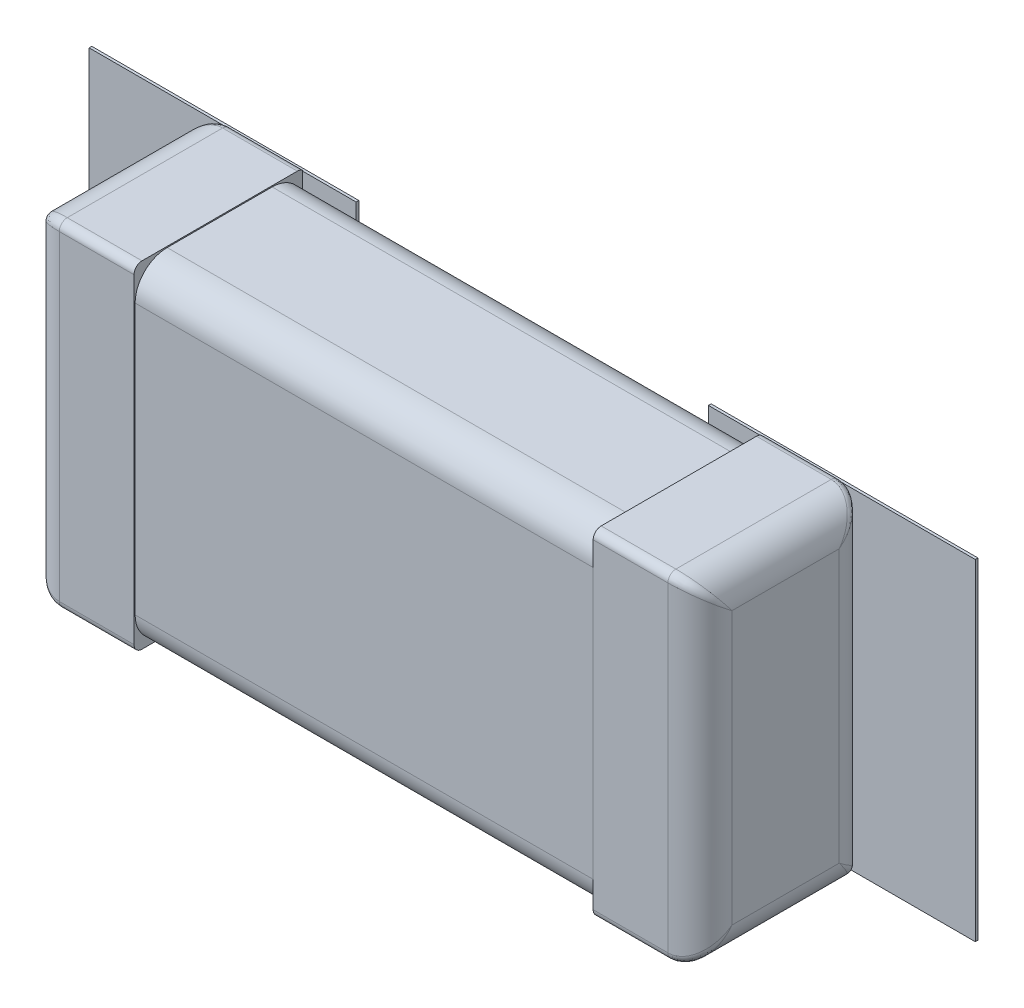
ISO-10303-21;
HEADER;
FILE_DESCRIPTION(('STEP AP214'),'2;1');
FILE_NAME('part.step','',(''),(''),'','','');
FILE_SCHEMA(('AUTOMOTIVE_DESIGN { 1 0 10303 214 1 1 1 1 }'));
ENDSEC;
DATA;
#1=APPLICATION_CONTEXT('core data for automotive mechanical design processes');
#2=APPLICATION_PROTOCOL_DEFINITION('international standard','automotive_design',2000,#1);
#3=PRODUCT_CONTEXT('',#1,'mechanical');
#4=PRODUCT('Part','Part','',(#3));
#5=PRODUCT_RELATED_PRODUCT_CATEGORY('part','',(#4));
#6=PRODUCT_DEFINITION_FORMATION('','',#4);
#7=PRODUCT_DEFINITION_CONTEXT('part definition',#1,'design');
#8=PRODUCT_DEFINITION('design','',#6,#7);
#9=PRODUCT_DEFINITION_SHAPE('','',#8);
#10=(LENGTH_UNIT() NAMED_UNIT(*) SI_UNIT(.MILLI.,.METRE.));
#11=(NAMED_UNIT(*) PLANE_ANGLE_UNIT() SI_UNIT($,.RADIAN.));
#12=(NAMED_UNIT(*) SI_UNIT($,.STERADIAN.) SOLID_ANGLE_UNIT());
#13=UNCERTAINTY_MEASURE_WITH_UNIT(LENGTH_MEASURE(1.E-05),#10,'distance_accuracy_value','');
#14=(GEOMETRIC_REPRESENTATION_CONTEXT(3) GLOBAL_UNCERTAINTY_ASSIGNED_CONTEXT((#13)) GLOBAL_UNIT_ASSIGNED_CONTEXT((#10,
#11,#12)) REPRESENTATION_CONTEXT('',''));
#15=CARTESIAN_POINT('',(0.,0.,0.));
#16=DIRECTION('',(0.,0.,1.));
#17=DIRECTION('',(1.,0.,0.));
#18=AXIS2_PLACEMENT_3D('',#15,#16,#17);
#19=CARTESIAN_POINT('',(-1.4478,-2.88612072,0.2286));
#20=DIRECTION('',(0.,1.,0.));
#21=DIRECTION('',(0.,0.,1.));
#22=AXIS2_PLACEMENT_3D('',#19,#20,#21);
#23=CYLINDRICAL_SURFACE('',#22,0.1524);
#24=CARTESIAN_POINT('',(-1.44452271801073,0.761974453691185,0.0762362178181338));
#25=CARTESIAN_POINT('',(-1.45340559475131,0.762115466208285,0.0760481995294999));
#26=CARTESIAN_POINT('',(-1.47318599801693,0.761133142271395,0.0773579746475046));
#27=CARTESIAN_POINT('',(-1.50317687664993,0.755128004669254,0.0853648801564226));
#28=CARTESIAN_POINT('',(-1.5332028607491,0.743533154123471,0.100824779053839));
#29=CARTESIAN_POINT('',(-1.56030406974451,0.72639113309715,0.123680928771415));
#30=CARTESIAN_POINT('',(-1.58241527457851,0.703802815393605,0.153798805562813));
#31=CARTESIAN_POINT('',(-1.59688228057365,0.676901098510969,0.189667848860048));
#32=CARTESIAN_POINT('',(-1.60029487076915,0.656950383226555,0.216268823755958));
#33=CARTESIAN_POINT('',(-1.60019479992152,0.646418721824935,0.23031103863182));
#34=CARTESIAN_POINT('',(-1.60018173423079,0.645776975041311,0.23116670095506));
#35=(BOUNDED_CURVE() B_SPLINE_CURVE(3,(#24,#25,#26,#27,#28,#29,#30,#31,#32,#33,#34),
.UNSPECIFIED.,.F.,.F.) B_SPLINE_CURVE_WITH_KNOTS((4,1,1,1,1,1,1,1,4),(-0.01164180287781,
0.08284237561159,0.19757055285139,0.32246577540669,0.46262337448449,0.61981281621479,
0.79426931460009,0.97378439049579,0.9854261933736),
.UNSPECIFIED.) CURVE() GEOMETRIC_REPRESENTATION_ITEM() RATIONAL_B_SPLINE_CURVE((1.17153749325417,
1.17153749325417,1.17153749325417,1.17153749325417,1.17153749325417,1.17153749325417,
1.17153749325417,1.17153749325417,1.17153749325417,1.17153749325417,1.17153749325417)) REPRESENTATION_ITEM(''));
#36=CARTESIAN_POINT('',(-1.60019999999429,0.647700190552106,0.228600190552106));
#37=VERTEX_POINT('',#36);
#38=CARTESIAN_POINT('',(-1.50870651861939,0.752476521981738,0.0889000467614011));
#39=VERTEX_POINT('',#38);
#40=EDGE_CURVE('E213',#37,#39,#35,.F.);
#41=ORIENTED_EDGE('',*,*,#40,.T.);
#42=DIRECTION('',(0.,1.,0.));
#43=VECTOR('',#42,1.);
#44=CARTESIAN_POINT('',(-1.50870853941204,0.,0.0889));
#45=LINE('',#44,#43);
#46=CARTESIAN_POINT('',(-1.50870849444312,-0.75247470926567,0.0889001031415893));
#47=VERTEX_POINT('',#46);
#48=EDGE_CURVE('E1241',#47,#39,#45,.T.);
#49=ORIENTED_EDGE('',*,*,#48,.F.);
#50=CARTESIAN_POINT('',(-1.60020000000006,-0.647699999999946,0.228599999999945));
#51=CARTESIAN_POINT('',(-1.60019762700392,-0.649379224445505,0.226364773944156));
#52=CARTESIAN_POINT('',(-1.60014742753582,-0.651059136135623,0.224130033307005));
#53=CARTESIAN_POINT('',(-1.59994235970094,-0.65454927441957,0.21948771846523));
#54=CARTESIAN_POINT('',(-1.59977956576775,-0.65635935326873,0.217080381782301));
#55=CARTESIAN_POINT('',(-1.59932350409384,-0.660106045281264,0.212095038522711));
#56=CARTESIAN_POINT('',(-1.59902153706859,-0.662042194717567,0.209517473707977));
#57=CARTESIAN_POINT('',(-1.59825895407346,-0.666037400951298,0.204195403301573));
#58=CARTESIAN_POINT('',(-1.59778880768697,-0.668095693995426,0.201451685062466));
#59=CARTESIAN_POINT('',(-1.59665932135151,-0.67233140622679,0.19580261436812));
#60=CARTESIAN_POINT('',(-1.59598955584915,-0.674507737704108,0.192898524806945));
#61=CARTESIAN_POINT('',(-1.59442877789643,-0.678975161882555,0.186937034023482));
#62=CARTESIAN_POINT('',(-1.59352647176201,-0.681264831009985,0.183881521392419));
#63=CARTESIAN_POINT('',(-1.59146441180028,-0.685948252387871,0.177631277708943));
#64=CARTESIAN_POINT('',(-1.59029253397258,-0.688340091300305,0.174439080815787));
#65=CARTESIAN_POINT('',(-1.58833969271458,-0.69194465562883,0.169628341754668));
#66=CARTESIAN_POINT('',(-1.58764030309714,-0.693173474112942,0.167988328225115));
#67=CARTESIAN_POINT('',(-1.58616075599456,-0.695650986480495,0.164681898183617));
#68=CARTESIAN_POINT('',(-1.5853789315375,-0.696899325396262,0.163015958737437));
#69=CARTESIAN_POINT('',(-1.58372926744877,-0.699413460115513,0.159661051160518));
#70=CARTESIAN_POINT('',(-1.58285970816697,-0.700678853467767,0.157972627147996));
#71=CARTESIAN_POINT('',(-1.5810292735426,-0.703224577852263,0.154576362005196));
#72=CARTESIAN_POINT('',(-1.58006662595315,-0.704504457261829,0.152869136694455));
#73=CARTESIAN_POINT('',(-1.57804441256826,-0.707076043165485,0.14943947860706));
#74=CARTESIAN_POINT('',(-1.57698302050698,-0.708367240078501,0.147717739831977));
#75=CARTESIAN_POINT('',(-1.57475698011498,-0.710957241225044,0.144263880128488));
#76=CARTESIAN_POINT('',(-1.5735904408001,-0.712255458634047,0.142532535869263));
#77=CARTESIAN_POINT('',(-1.57135891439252,-0.714630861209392,0.13936464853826));
#78=CARTESIAN_POINT('',(-1.57030515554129,-0.71571184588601,0.137923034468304));
#79=CARTESIAN_POINT('',(-1.56816966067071,-0.717823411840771,0.135107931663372));
#80=CARTESIAN_POINT('',(-1.56708951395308,-0.718854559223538,0.133733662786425));
#81=CARTESIAN_POINT('',(-1.56490591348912,-0.720866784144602,0.131052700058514));
#82=CARTESIAN_POINT('',(-1.56380399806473,-0.721848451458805,0.129745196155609));
#83=CARTESIAN_POINT('',(-1.56158148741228,-0.7237623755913,0.127196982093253));
#84=CARTESIAN_POINT('',(-1.56046237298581,-0.724695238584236,0.125955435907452));
#85=CARTESIAN_POINT('',(-1.55821013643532,-0.726512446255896,0.12353810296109));
#86=CARTESIAN_POINT('',(-1.55707843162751,-0.727397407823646,0.12236145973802));
#87=CARTESIAN_POINT('',(-1.5548054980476,-0.72911904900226,0.12007312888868));
#88=CARTESIAN_POINT('',(-1.55366564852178,-0.729956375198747,0.118960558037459));
#89=CARTESIAN_POINT('',(-1.55138075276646,-0.731582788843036,0.116799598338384));
#90=CARTESIAN_POINT('',(-1.55023705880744,-0.732372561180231,0.115750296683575));
#91=CARTESIAN_POINT('',(-1.54794881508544,-0.73390427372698,0.113714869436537));
#92=CARTESIAN_POINT('',(-1.54680557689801,-0.734646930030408,0.112727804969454));
#93=CARTESIAN_POINT('',(-1.54344118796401,-0.736766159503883,0.10991003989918));
#94=CARTESIAN_POINT('',(-1.54117166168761,-0.738114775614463,0.108115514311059));
#95=CARTESIAN_POINT('',(-1.53667210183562,-0.740629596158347,0.104764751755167));
#96=CARTESIAN_POINT('',(-1.53445130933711,-0.741801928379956,0.103200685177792));
#97=CARTESIAN_POINT('',(-1.5300795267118,-0.743976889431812,0.100295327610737));
#98=CARTESIAN_POINT('',(-1.52793679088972,-0.744985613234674,0.0989461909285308));
#99=CARTESIAN_POINT('',(-1.52375147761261,-0.746844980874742,0.0964553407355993));
#100=CARTESIAN_POINT('',(-1.52171629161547,-0.747701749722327,0.0953057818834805));
#101=CARTESIAN_POINT('',(-1.51777315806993,-0.749271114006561,0.0931975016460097));
#102=CARTESIAN_POINT('',(-1.51587171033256,-0.74998965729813,0.0922310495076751));
#103=CARTESIAN_POINT('',(-1.51221950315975,-0.751300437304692,0.0904709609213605));
#104=CARTESIAN_POINT('',(-1.51047423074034,-0.751897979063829,0.0896698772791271));
#105=CARTESIAN_POINT('',(-1.5087085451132,-0.752474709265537,0.0888999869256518));
#106=B_SPLINE_CURVE_WITH_KNOTS('',3,(#50,#51,#52,#53,#54,#55,#56,#57,#58,#59,#60,#61,#62,#63,
#64,#65,#66,#67,#68,#69,#70,#71,#72,#73,#74,#75,#76,#77,#78,#79,#80,#81,#82,#83,#84,#85,#86,#87,
#88,#89,#90,#91,#92,#93,#94,#95,#96,#97,#98,#99,#100,#101,#102,#103,#104,#105),.UNSPECIFIED.,
.F.,.F.,(4,2,2,2,2,2,2,2,2,2,2,2,2,2,2,2,2,2,2,2,2,2,2,2,2,2,2,4),(0.,0.00838685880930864,
0.017433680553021,0.0271445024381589,0.0375271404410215,0.0485939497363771,0.0603590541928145,
0.0728242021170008,0.0793194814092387,0.0859895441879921,0.0928347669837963,0.0998558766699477,
0.107053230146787,0.114426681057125,0.120687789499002,0.126775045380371,0.132689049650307,
0.138430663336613,0.144000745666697,0.149398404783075,0.15462204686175,0.159670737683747,
0.169241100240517,0.178111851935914,0.186284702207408,0.193749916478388,0.200499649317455,
0.206531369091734),.UNSPECIFIED.);
#107=CARTESIAN_POINT('',(-1.60019999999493,-0.647699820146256,0.228599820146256));
#108=VERTEX_POINT('',#107);
#109=EDGE_CURVE('E224',#47,#108,#106,.F.);
#110=ORIENTED_EDGE('',*,*,#109,.T.);
#111=DIRECTION('',(0.,1.,0.));
#112=VECTOR('',#111,1.);
#113=CARTESIAN_POINT('',(-1.6002,0.8001,0.2286));
#114=LINE('',#113,#112);
#115=EDGE_CURVE('E1135',#37,#108,#114,.F.);
#116=ORIENTED_EDGE('',*,*,#115,.F.);
#117=EDGE_LOOP('',(#41,#49,#110,#116));
#118=FACE_BOUND('',#117,.T.);
#119=ADVANCED_FACE('F16',(#118),#23,.T.);
#120=CARTESIAN_POINT('',(0.,0.,0.0889));
#121=DIRECTION('',(0.,0.,1.));
#122=DIRECTION('',(1.,0.,0.));
#123=AXIS2_PLACEMENT_3D('',#120,#121,#122);
#124=PLANE('',#123);
#125=DIRECTION('',(0.,1.,0.));
#126=VECTOR('',#125,1.);
#127=CARTESIAN_POINT('',(-2.1079968,0.7875016,0.0889));
#128=LINE('',#127,#126);
#129=CARTESIAN_POINT('',(-2.1079968,-0.7875016,0.0889));
#130=VERTEX_POINT('',#129);
#131=CARTESIAN_POINT('',(-2.1079968,0.7875016,0.0889));
#132=VERTEX_POINT('',#131);
#133=EDGE_CURVE('E286',#130,#132,#128,.T.);
#134=ORIENTED_EDGE('',*,*,#133,.F.);
#135=DIRECTION('',(1.,0.,0.));
#136=VECTOR('',#135,1.);
#137=CARTESIAN_POINT('',(0.,-0.7875016,0.0889));
#138=LINE('',#137,#136);
#139=CARTESIAN_POINT('',(-1.47011119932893,-0.7875016,0.0889001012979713));
#140=VERTEX_POINT('',#139);
#141=EDGE_CURVE('E289',#130,#140,#138,.T.);
#142=ORIENTED_EDGE('',*,*,#141,.T.);
#143=CARTESIAN_POINT('',(-1.47011117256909,-0.787501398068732,0.0889000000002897));
#144=CARTESIAN_POINT('',(-1.47403384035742,-0.786447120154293,0.0888999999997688));
#145=CARTESIAN_POINT('',(-1.47789990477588,-0.78510067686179,0.0888999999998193));
#146=CARTESIAN_POINT('',(-1.48537427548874,-0.781752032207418,0.0889000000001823));
#147=CARTESIAN_POINT('',(-1.48897997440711,-0.779744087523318,0.0889000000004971));
#148=CARTESIAN_POINT('',(-1.49590402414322,-0.774883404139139,0.0889000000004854));
#149=CARTESIAN_POINT('',(-1.49919438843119,-0.771989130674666,0.0889000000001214));
#150=CARTESIAN_POINT('',(-1.50408744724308,-0.766062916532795,0.0888999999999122));
#151=CARTESIAN_POINT('',(-1.50590564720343,-0.763230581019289,0.0888999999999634));
#152=CARTESIAN_POINT('',(-1.50808238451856,-0.75774125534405,0.0889000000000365));
#153=CARTESIAN_POINT('',(-1.50866417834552,-0.755167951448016,0.0889000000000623));
#154=CARTESIAN_POINT('',(-1.50870857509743,-0.752474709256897,0.0889000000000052));
#155=B_SPLINE_CURVE_WITH_KNOTS('',3,(#143,#144,#145,#146,#147,#148,#149,#150,#151,#152,#153,
#154),.UNSPECIFIED.,.F.,.F.,(4,2,2,2,2,4),(0.,0.0122069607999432,0.0245228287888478,
0.037538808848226,0.0474321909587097,0.0552913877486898),.UNSPECIFIED.);
#156=EDGE_CURVE('E1243',#140,#47,#155,.T.);
#157=ORIENTED_EDGE('',*,*,#156,.T.);
#158=ORIENTED_EDGE('',*,*,#48,.T.);
#159=CARTESIAN_POINT('',(-1.50870595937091,0.752476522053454,0.0889000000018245));
#160=CARTESIAN_POINT('',(-1.50867380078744,0.754931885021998,0.088900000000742));
#161=CARTESIAN_POINT('',(-1.50818267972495,0.757296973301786,0.0889000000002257));
#162=CARTESIAN_POINT('',(-1.50622607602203,0.762635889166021,0.0888999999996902));
#163=CARTESIAN_POINT('',(-1.50446540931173,0.765507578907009,0.0888999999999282));
#164=CARTESIAN_POINT('',(-1.50078833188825,0.770120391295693,0.0889000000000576));
#165=CARTESIAN_POINT('',(-1.49899001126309,0.771971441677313,0.0889000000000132));
#166=CARTESIAN_POINT('',(-1.49512399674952,0.775383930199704,0.0888999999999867));
#167=CARTESIAN_POINT('',(-1.49305558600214,0.7769445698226,0.0889000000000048));
#168=CARTESIAN_POINT('',(-1.48770363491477,0.78047202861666,0.0889000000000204));
#169=CARTESIAN_POINT('',(-1.48431358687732,0.782273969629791,0.088900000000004));
#170=CARTESIAN_POINT('',(-1.4773340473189,0.785296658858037,0.088899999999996));
#171=CARTESIAN_POINT('',(-1.47374777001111,0.786524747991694,0.0889000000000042));
#172=CARTESIAN_POINT('',(-1.4701120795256,0.787501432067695,0.088900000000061));
#173=B_SPLINE_CURVE_WITH_KNOTS('',3,(#159,#160,#161,#162,#163,#164,#165,#166,#167,#168,#169,
#170,#171,#172),.UNSPECIFIED.,.F.,.F.,(4,2,2,2,2,2,4),(0.,0.0071975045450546,0.0170805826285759,
0.0248041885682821,0.0325487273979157,0.0440125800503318,0.0553254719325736),.UNSPECIFIED.);
#174=CARTESIAN_POINT('',(-1.4701120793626,0.787501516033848,0.088900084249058));
#175=VERTEX_POINT('',#174);
#176=EDGE_CURVE('E205',#39,#175,#173,.T.);
#177=ORIENTED_EDGE('',*,*,#176,.T.);
#178=DIRECTION('',(1.,0.,0.));
#179=VECTOR('',#178,1.);
#180=CARTESIAN_POINT('',(0.,0.7875016,0.0889));
#181=LINE('',#180,#179);
#182=EDGE_CURVE('E283',#175,#132,#181,.F.);
#183=ORIENTED_EDGE('',*,*,#182,.T.);
#184=EDGE_LOOP('',(#134,#142,#157,#158,#177,#183));
#185=FACE_BOUND('',#184,.T.);
#186=ADVANCED_FACE('F284',(#185),#124,.T.);
#187=CARTESIAN_POINT('',(1.4478,2.88612072,0.2286));
#188=DIRECTION('',(0.,-1.,0.));
#189=DIRECTION('',(0.,0.,-1.));
#190=AXIS2_PLACEMENT_3D('',#187,#188,#189);
#191=CYLINDRICAL_SURFACE('',#190,0.1524);
#192=CARTESIAN_POINT('',(1.44452271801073,-0.761974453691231,0.0762362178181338));
#193=CARTESIAN_POINT('',(1.45340559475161,-0.762115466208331,0.0760481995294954));
#194=CARTESIAN_POINT('',(1.47318599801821,-0.761133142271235,0.0773579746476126));
#195=CARTESIAN_POINT('',(1.50317687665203,-0.755128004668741,0.0853648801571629));
#196=CARTESIAN_POINT('',(1.53320286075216,-0.743533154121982,0.100824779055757));
#197=CARTESIAN_POINT('',(1.56030406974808,-0.726391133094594,0.12368092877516));
#198=CARTESIAN_POINT('',(1.58241527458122,-0.703802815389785,0.15379880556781));
#199=CARTESIAN_POINT('',(1.59688228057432,-0.676901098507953,0.189667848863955));
#200=CARTESIAN_POINT('',(1.6002948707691,-0.656950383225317,0.216268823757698));
#201=CARTESIAN_POINT('',(1.60019479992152,-0.646418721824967,0.230311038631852));
#202=CARTESIAN_POINT('',(1.60018173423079,-0.645776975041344,0.231166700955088));
#203=(BOUNDED_CURVE() B_SPLINE_CURVE(3,(#192,#193,#194,#195,#196,#197,#198,#199,#200,#201,#202),
.UNSPECIFIED.,.F.,.F.) B_SPLINE_CURVE_WITH_KNOTS((4,1,1,1,1,1,1,1,4),(-0.01164180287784,
0.0828423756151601,0.19757055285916,0.32246577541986,0.46262337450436,0.61981281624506,
0.79426931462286,0.97378439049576,0.9854261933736),
.UNSPECIFIED.) CURVE() GEOMETRIC_REPRESENTATION_ITEM() RATIONAL_B_SPLINE_CURVE((1.17153749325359,
1.17153749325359,1.17153749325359,1.17153749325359,1.17153749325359,1.17153749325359,
1.17153749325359,1.17153749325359,1.17153749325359,1.17153749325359,1.17153749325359)) REPRESENTATION_ITEM(''));
#204=CARTESIAN_POINT('',(1.60019999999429,-0.647700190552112,0.228600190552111));
#205=VERTEX_POINT('',#204);
#206=CARTESIAN_POINT('',(1.50870651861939,-0.752476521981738,0.0889000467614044));
#207=VERTEX_POINT('',#206);
#208=EDGE_CURVE('E1213',#205,#207,#203,.F.);
#209=ORIENTED_EDGE('',*,*,#208,.T.);
#210=DIRECTION('',(0.,1.,0.));
#211=VECTOR('',#210,1.);
#212=CARTESIAN_POINT('',(1.50870853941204,0.,0.0889));
#213=LINE('',#212,#211);
#214=CARTESIAN_POINT('',(1.50870849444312,0.75247470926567,0.0889001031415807));
#215=VERTEX_POINT('',#214);
#216=EDGE_CURVE('E600',#215,#207,#213,.F.);
#217=ORIENTED_EDGE('',*,*,#216,.F.);
#218=CARTESIAN_POINT('',(1.60020000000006,0.647699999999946,0.228599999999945));
#219=CARTESIAN_POINT('',(1.60019762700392,0.649379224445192,0.226364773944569));
#220=CARTESIAN_POINT('',(1.60014742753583,0.651059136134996,0.224130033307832));
#221=CARTESIAN_POINT('',(1.59994235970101,0.65454927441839,0.219487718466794));
#222=CARTESIAN_POINT('',(1.59977956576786,0.656359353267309,0.217080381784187));
#223=CARTESIAN_POINT('',(1.59932350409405,0.660106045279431,0.212095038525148));
#224=CARTESIAN_POINT('',(1.59902153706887,0.662042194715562,0.209517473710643));
#225=CARTESIAN_POINT('',(1.59825895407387,0.666037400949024,0.204195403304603));
#226=CARTESIAN_POINT('',(1.59778880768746,0.668095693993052,0.201451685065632));
#227=CARTESIAN_POINT('',(1.59665932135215,0.672331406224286,0.19580261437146));
#228=CARTESIAN_POINT('',(1.59598955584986,0.674507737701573,0.192898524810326));
#229=CARTESIAN_POINT('',(1.59442877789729,0.678975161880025,0.186937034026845));
#230=CARTESIAN_POINT('',(1.59352647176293,0.681264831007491,0.183881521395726));
#231=CARTESIAN_POINT('',(1.59146441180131,0.685948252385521,0.17763127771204));
#232=CARTESIAN_POINT('',(1.59029253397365,0.688340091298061,0.174439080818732));
#233=CARTESIAN_POINT('',(1.58833969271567,0.691944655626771,0.169628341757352));
#234=CARTESIAN_POINT('',(1.58764030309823,0.693173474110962,0.167988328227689));
#235=CARTESIAN_POINT('',(1.58616075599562,0.695650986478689,0.164681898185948));
#236=CARTESIAN_POINT('',(1.58537893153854,0.696899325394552,0.163015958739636));
#237=CARTESIAN_POINT('',(1.58372926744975,0.699413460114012,0.159661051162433));
#238=CARTESIAN_POINT('',(1.5828597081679,0.700678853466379,0.157972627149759));
#239=CARTESIAN_POINT('',(1.58102927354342,0.703224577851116,0.154576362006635));
#240=CARTESIAN_POINT('',(1.5800666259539,0.704504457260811,0.152869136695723));
#241=CARTESIAN_POINT('',(1.57804441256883,0.707076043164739,0.149439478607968));
#242=CARTESIAN_POINT('',(1.57698302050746,0.708367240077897,0.147717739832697));
#243=CARTESIAN_POINT('',(1.57475698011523,0.710957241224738,0.144263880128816));
#244=CARTESIAN_POINT('',(1.57359044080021,0.712255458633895,0.142532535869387));
#245=CARTESIAN_POINT('',(1.57135891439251,0.714630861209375,0.13936464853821));
#246=CARTESIAN_POINT('',(1.57030515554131,0.715711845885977,0.137923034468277));
#247=CARTESIAN_POINT('',(1.56816966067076,0.717823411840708,0.135107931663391));
#248=CARTESIAN_POINT('',(1.56708951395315,0.718854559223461,0.133733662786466));
#249=CARTESIAN_POINT('',(1.56490591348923,0.7208667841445,0.131052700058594));
#250=CARTESIAN_POINT('',(1.56380399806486,0.721848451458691,0.129745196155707));
#251=CARTESIAN_POINT('',(1.56158148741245,0.723762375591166,0.127196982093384));
#252=CARTESIAN_POINT('',(1.560462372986,0.724695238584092,0.125955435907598));
#253=CARTESIAN_POINT('',(1.55821013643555,0.726512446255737,0.123538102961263));
#254=CARTESIAN_POINT('',(1.55707843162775,0.72739740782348,0.122361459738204));
#255=CARTESIAN_POINT('',(1.55480549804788,0.729119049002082,0.120073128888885));
#256=CARTESIAN_POINT('',(1.55366564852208,0.729956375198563,0.118960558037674));
#257=CARTESIAN_POINT('',(1.55138075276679,0.731582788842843,0.116799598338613));
#258=CARTESIAN_POINT('',(1.55023705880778,0.732372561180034,0.115750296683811));
#259=CARTESIAN_POINT('',(1.54794881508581,0.733904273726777,0.113714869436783));
#260=CARTESIAN_POINT('',(1.5468055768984,0.734646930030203,0.112727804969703));
#261=CARTESIAN_POINT('',(1.54344118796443,0.736766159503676,0.109910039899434));
#262=CARTESIAN_POINT('',(1.54117166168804,0.738114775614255,0.108115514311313));
#263=CARTESIAN_POINT('',(1.53667210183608,0.740629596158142,0.104764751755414));
#264=CARTESIAN_POINT('',(1.53445130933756,0.741801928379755,0.103200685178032));
#265=CARTESIAN_POINT('',(1.53007952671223,0.743976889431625,0.100295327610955));
#266=CARTESIAN_POINT('',(1.52793679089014,0.744985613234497,0.0989461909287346));
#267=CARTESIAN_POINT('',(1.523751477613,0.746844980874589,0.0964553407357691));
#268=CARTESIAN_POINT('',(1.52171629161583,0.747701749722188,0.0953057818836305));
#269=CARTESIAN_POINT('',(1.51777315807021,0.749271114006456,0.0931975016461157));
#270=CARTESIAN_POINT('',(1.51587171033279,0.749989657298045,0.0922310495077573));
#271=CARTESIAN_POINT('',(1.51221950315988,0.751300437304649,0.0904709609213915));
#272=CARTESIAN_POINT('',(1.51047423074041,0.751897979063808,0.0896698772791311));
#273=CARTESIAN_POINT('',(1.50870854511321,0.752474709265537,0.0888999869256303));
#274=B_SPLINE_CURVE_WITH_KNOTS('',3,(#218,#219,#220,#221,#222,#223,#224,#225,#226,#227,#228,
#229,#230,#231,#232,#233,#234,#235,#236,#237,#238,#239,#240,#241,#242,#243,#244,#245,#246,#247,
#248,#249,#250,#251,#252,#253,#254,#255,#256,#257,#258,#259,#260,#261,#262,#263,#264,#265,#266,
#267,#268,#269,#270,#271,#272,#273),.UNSPECIFIED.,.F.,.F.,(4,2,2,2,2,2,2,2,2,2,2,2,2,2,2,2,2,2,
2,2,2,2,2,2,2,2,2,4),(0.,0.00838685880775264,0.0174336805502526,0.0271445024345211,
0.0375271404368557,0.0485939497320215,0.0603590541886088,0.0728242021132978,0.0793194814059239,
0.0859895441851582,0.092834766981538,0.0998558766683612,0.107053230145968,0.114426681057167,
0.120687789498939,0.126775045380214,0.132689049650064,0.138430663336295,0.144000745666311,
0.149398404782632,0.154622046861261,0.159670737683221,0.169241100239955,0.178111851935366,
0.186284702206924,0.193749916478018,0.200499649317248,0.206531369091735),.UNSPECIFIED.);
#275=CARTESIAN_POINT('',(1.60019999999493,0.647699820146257,0.228599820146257));
#276=VERTEX_POINT('',#275);
#277=EDGE_CURVE('E986',#215,#276,#274,.F.);
#278=ORIENTED_EDGE('',*,*,#277,.T.);
#279=DIRECTION('',(0.,1.,0.));
#280=VECTOR('',#279,1.);
#281=CARTESIAN_POINT('',(1.6002,-0.8001,0.2286));
#282=LINE('',#281,#280);
#283=EDGE_CURVE('E859',#205,#276,#282,.T.);
#284=ORIENTED_EDGE('',*,*,#283,.F.);
#285=EDGE_LOOP('',(#209,#217,#278,#284));
#286=FACE_BOUND('',#285,.T.);
#287=ADVANCED_FACE('F622',(#286),#191,.T.);
#288=CARTESIAN_POINT('',(0.,0.,0.0889));
#289=DIRECTION('',(0.,0.,1.));
#290=DIRECTION('',(1.,0.,0.));
#291=AXIS2_PLACEMENT_3D('',#288,#289,#290);
#292=PLANE('',#291);
#293=DIRECTION('',(0.,1.,0.));
#294=VECTOR('',#293,1.);
#295=CARTESIAN_POINT('',(2.1079968,-0.7875016,0.0889));
#296=LINE('',#295,#294);
#297=CARTESIAN_POINT('',(2.1079968,0.7875016,0.0889));
#298=VERTEX_POINT('',#297);
#299=CARTESIAN_POINT('',(2.1079968,-0.7875016,0.0889));
#300=VERTEX_POINT('',#299);
#301=EDGE_CURVE('E1263',#298,#300,#296,.F.);
#302=ORIENTED_EDGE('',*,*,#301,.F.);
#303=DIRECTION('',(1.,0.,0.));
#304=VECTOR('',#303,1.);
#305=CARTESIAN_POINT('',(0.,0.7875016,0.0889));
#306=LINE('',#305,#304);
#307=CARTESIAN_POINT('',(1.47011119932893,0.7875016,0.088900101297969));
#308=VERTEX_POINT('',#307);
#309=EDGE_CURVE('E1137',#298,#308,#306,.F.);
#310=ORIENTED_EDGE('',*,*,#309,.T.);
#311=CARTESIAN_POINT('',(1.47011117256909,0.787501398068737,0.0889000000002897));
#312=CARTESIAN_POINT('',(1.47403384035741,0.786447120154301,0.0888999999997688));
#313=CARTESIAN_POINT('',(1.47789990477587,0.7851006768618,0.0888999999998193));
#314=CARTESIAN_POINT('',(1.48537427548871,0.781752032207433,0.0889000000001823));
#315=CARTESIAN_POINT('',(1.48897997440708,0.779744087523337,0.0889000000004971));
#316=CARTESIAN_POINT('',(1.49590402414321,0.774883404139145,0.0889000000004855));
#317=CARTESIAN_POINT('',(1.49919438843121,0.771989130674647,0.0889000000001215));
#318=CARTESIAN_POINT('',(1.50408744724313,0.76606291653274,0.0888999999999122));
#319=CARTESIAN_POINT('',(1.50590564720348,0.76323058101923,0.0888999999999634));
#320=CARTESIAN_POINT('',(1.5080823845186,0.757741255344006,0.0889000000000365));
#321=CARTESIAN_POINT('',(1.50866417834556,0.755167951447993,0.0889000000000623));
#322=CARTESIAN_POINT('',(1.50870857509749,0.752474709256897,0.0889000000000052));
#323=B_SPLINE_CURVE_WITH_KNOTS('',3,(#311,#312,#313,#314,#315,#316,#317,#318,#319,#320,#321,
#322),.UNSPECIFIED.,.F.,.F.,(4,2,2,2,2,4),(0.,0.0122069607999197,0.0245228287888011,
0.0375388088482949,0.0474321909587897,0.055291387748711),.UNSPECIFIED.);
#324=EDGE_CURVE('E608',#308,#215,#323,.T.);
#325=ORIENTED_EDGE('',*,*,#324,.T.);
#326=ORIENTED_EDGE('',*,*,#216,.T.);
#327=CARTESIAN_POINT('',(1.50870595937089,-0.752476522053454,0.0889000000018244));
#328=CARTESIAN_POINT('',(1.5086738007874,-0.754931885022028,0.088900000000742));
#329=CARTESIAN_POINT('',(1.50818267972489,-0.757296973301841,0.0889000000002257));
#330=CARTESIAN_POINT('',(1.50622607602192,-0.762635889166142,0.0888999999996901));
#331=CARTESIAN_POINT('',(1.50446540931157,-0.765507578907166,0.0888999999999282));
#332=CARTESIAN_POINT('',(1.50078833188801,-0.770120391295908,0.0889000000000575));
#333=CARTESIAN_POINT('',(1.49899001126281,-0.771971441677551,0.0889000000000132));
#334=CARTESIAN_POINT('',(1.49512399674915,-0.775383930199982,0.0888999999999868));
#335=CARTESIAN_POINT('',(1.49305558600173,-0.776944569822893,0.0889000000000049));
#336=CARTESIAN_POINT('',(1.48770363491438,-0.780472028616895,0.0889000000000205));
#337=CARTESIAN_POINT('',(1.484313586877,-0.782273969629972,0.088900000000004));
#338=CARTESIAN_POINT('',(1.47733404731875,-0.785296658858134,0.088899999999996));
#339=CARTESIAN_POINT('',(1.47374777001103,-0.78652474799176,0.0889000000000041));
#340=CARTESIAN_POINT('',(1.47011207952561,-0.787501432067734,0.0889000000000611));
#341=B_SPLINE_CURVE_WITH_KNOTS('',3,(#327,#328,#329,#330,#331,#332,#333,#334,#335,#336,#337,
#338,#339,#340),.UNSPECIFIED.,.F.,.F.,(4,2,2,2,2,2,4),(0.,0.00719750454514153,
0.0170805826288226,0.0248041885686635,0.0325487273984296,0.0440125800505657,0.055325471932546),.UNSPECIFIED.);
#342=CARTESIAN_POINT('',(1.47011207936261,-0.787501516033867,0.0889000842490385));
#343=VERTEX_POINT('',#342);
#344=EDGE_CURVE('E597',#207,#343,#341,.T.);
#345=ORIENTED_EDGE('',*,*,#344,.T.);
#346=DIRECTION('',(1.,0.,0.));
#347=VECTOR('',#346,1.);
#348=CARTESIAN_POINT('',(0.,-0.7875016,0.0889));
#349=LINE('',#348,#347);
#350=EDGE_CURVE('E599',#343,#300,#349,.T.);
#351=ORIENTED_EDGE('',*,*,#350,.T.);
#352=EDGE_LOOP('',(#302,#310,#325,#326,#345,#351));
#353=FACE_BOUND('',#352,.T.);
#354=ADVANCED_FACE('F616',(#353),#292,.T.);
#355=CARTESIAN_POINT('',(-1.6002,0.8001,0.0762));
#356=DIRECTION('',(-1.,0.,0.));
#357=DIRECTION('',(0.,0.,1.));
#358=AXIS2_PLACEMENT_3D('',#355,#356,#357);
#359=PLANE('',#358);
#360=DIRECTION('',(0.,0.,-1.));
#361=VECTOR('',#360,1.);
#362=CARTESIAN_POINT('',(-1.6002,-0.6477,1.9538321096));
#363=LINE('',#362,#361);
#364=CARTESIAN_POINT('',(-1.60019999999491,-0.647700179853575,0.738885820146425));
#365=VERTEX_POINT('',#364);
#366=EDGE_CURVE('E232',#365,#108,#363,.T.);
#367=ORIENTED_EDGE('',*,*,#366,.F.);
#368=DIRECTION('',(0.,-1.,0.));
#369=VECTOR('',#368,1.);
#370=CARTESIAN_POINT('',(-1.6002,2.88612072,0.738886));
#371=LINE('',#370,#369);
#372=CARTESIAN_POINT('',(-1.60019999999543,0.647699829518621,0.738886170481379));
#373=VERTEX_POINT('',#372);
#374=EDGE_CURVE('E460',#373,#365,#371,.T.);
#375=ORIENTED_EDGE('',*,*,#374,.F.);
#376=DIRECTION('',(0.,0.,-1.));
#377=VECTOR('',#376,1.);
#378=CARTESIAN_POINT('',(-1.6002,0.6477,1.9538321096));
#379=LINE('',#378,#377);
#380=EDGE_CURVE('E365',#37,#373,#379,.F.);
#381=ORIENTED_EDGE('',*,*,#380,.F.);
#382=ORIENTED_EDGE('',*,*,#115,.T.);
#383=EDGE_LOOP('',(#367,#375,#381,#382));
#384=FACE_BOUND('',#383,.T.);
#385=ADVANCED_FACE('F621',(#384),#359,.T.);
#386=CARTESIAN_POINT('',(-2.1079968,0.7875016,0.0762));
#387=DIRECTION('',(-1.,0.,0.));
#388=DIRECTION('',(0.,0.,1.));
#389=AXIS2_PLACEMENT_3D('',#386,#387,#388);
#390=PLANE('',#389);
#391=DIRECTION('',(0.,0.,1.));
#392=VECTOR('',#391,1.);
#393=CARTESIAN_POINT('',(-2.1079968,0.7875016,0.0762));
#394=LINE('',#393,#392);
#395=CARTESIAN_POINT('',(-2.1079968,0.7875016,0.0762));
#396=VERTEX_POINT('',#395);
#397=EDGE_CURVE('E293',#132,#396,#394,.F.);
#398=ORIENTED_EDGE('',*,*,#397,.T.);
#399=DIRECTION('',(0.,1.,0.));
#400=VECTOR('',#399,1.);
#401=CARTESIAN_POINT('',(-2.1079968,0.,0.0762));
#402=LINE('',#401,#400);
#403=CARTESIAN_POINT('',(-2.1079968,-0.7875016,0.0762));
#404=VERTEX_POINT('',#403);
#405=EDGE_CURVE('E357',#396,#404,#402,.F.);
#406=ORIENTED_EDGE('',*,*,#405,.T.);
#407=DIRECTION('',(0.,0.,1.));
#408=VECTOR('',#407,1.);
#409=CARTESIAN_POINT('',(-2.1079968,-0.7875016,0.0762));
#410=LINE('',#409,#408);
#411=EDGE_CURVE('E279',#404,#130,#410,.T.);
#412=ORIENTED_EDGE('',*,*,#411,.T.);
#413=ORIENTED_EDGE('',*,*,#133,.T.);
#414=EDGE_LOOP('',(#398,#406,#412,#413));
#415=FACE_BOUND('',#414,.T.);
#416=ADVANCED_FACE('F292',(#415),#390,.T.);
#417=CARTESIAN_POINT('',(-0.8379968,-0.7875016,0.0762));
#418=DIRECTION('',(1.,0.,0.));
#419=DIRECTION('',(0.,0.,-1.));
#420=AXIS2_PLACEMENT_3D('',#417,#418,#419);
#421=PLANE('',#420);
#422=CARTESIAN_POINT('',(-0.837996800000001,0.642366,0.233934));
#423=DIRECTION('',(-1.,0.,0.));
#424=DIRECTION('',(0.,0.,1.));
#425=AXIS2_PLACEMENT_3D('',#422,#423,#424);
#426=CIRCLE('',#425,0.1524);
#427=CARTESIAN_POINT('',(-0.8379968,0.689173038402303,0.0889));
#428=VERTEX_POINT('',#427);
#429=CARTESIAN_POINT('',(-0.837996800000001,0.642366,0.081534));
#430=VERTEX_POINT('',#429);
#431=EDGE_CURVE('E593',#428,#430,#426,.T.);
#432=ORIENTED_EDGE('',*,*,#431,.T.);
#433=DIRECTION('',(0.,1.,0.));
#434=VECTOR('',#433,1.);
#435=CARTESIAN_POINT('',(-0.8379968,-0.8001,0.081534));
#436=LINE('',#435,#434);
#437=CARTESIAN_POINT('',(-0.8379968,-0.642366,0.081534));
#438=VERTEX_POINT('',#437);
#439=EDGE_CURVE('E595',#430,#438,#436,.F.);
#440=ORIENTED_EDGE('',*,*,#439,.T.);
#441=CARTESIAN_POINT('',(-0.8379968,-0.642366,0.233934));
#442=DIRECTION('',(1.,0.,0.));
#443=DIRECTION('',(0.,0.,-1.));
#444=AXIS2_PLACEMENT_3D('',#441,#442,#443);
#445=CIRCLE('',#444,0.1524);
#446=CARTESIAN_POINT('',(-0.8379968,-0.689173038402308,0.0888999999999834));
#447=VERTEX_POINT('',#446);
#448=EDGE_CURVE('E581',#447,#438,#445,.T.);
#449=ORIENTED_EDGE('',*,*,#448,.F.);
#450=DIRECTION('',(0.,1.,0.));
#451=VECTOR('',#450,1.);
#452=CARTESIAN_POINT('',(-0.8379968,-0.7875016,0.0889));
#453=LINE('',#452,#451);
#454=CARTESIAN_POINT('',(-0.8379968,-0.7875016,0.0889));
#455=VERTEX_POINT('',#454);
#456=EDGE_CURVE('E301',#447,#455,#453,.F.);
#457=ORIENTED_EDGE('',*,*,#456,.T.);
#458=DIRECTION('',(0.,0.,-1.));
#459=VECTOR('',#458,1.);
#460=CARTESIAN_POINT('',(-0.8379968,-0.7875016,0.0762));
#461=LINE('',#460,#459);
#462=CARTESIAN_POINT('',(-0.8379968,-0.7875016,0.0762));
#463=VERTEX_POINT('',#462);
#464=EDGE_CURVE('E303',#455,#463,#461,.T.);
#465=ORIENTED_EDGE('',*,*,#464,.T.);
#466=DIRECTION('',(0.,1.,0.));
#467=VECTOR('',#466,1.);
#468=CARTESIAN_POINT('',(-0.8379968,0.,0.0762));
#469=LINE('',#468,#467);
#470=CARTESIAN_POINT('',(-0.8379968,0.7875016,0.0762));
#471=VERTEX_POINT('',#470);
#472=EDGE_CURVE('E364',#463,#471,#469,.T.);
#473=ORIENTED_EDGE('',*,*,#472,.T.);
#474=DIRECTION('',(0.,0.,-1.));
#475=VECTOR('',#474,1.);
#476=CARTESIAN_POINT('',(-0.8379968,0.7875016,0.0762));
#477=LINE('',#476,#475);
#478=CARTESIAN_POINT('',(-0.8379968,0.7875016,0.0889));
#479=VERTEX_POINT('',#478);
#480=EDGE_CURVE('E1118',#471,#479,#477,.F.);
#481=ORIENTED_EDGE('',*,*,#480,.T.);
#482=DIRECTION('',(0.,1.,0.));
#483=VECTOR('',#482,1.);
#484=CARTESIAN_POINT('',(-0.8379968,-0.7875016,0.0889));
#485=LINE('',#484,#483);
#486=EDGE_CURVE('E596',#479,#428,#485,.F.);
#487=ORIENTED_EDGE('',*,*,#486,.T.);
#488=EDGE_LOOP('',(#432,#440,#449,#457,#465,#473,#481,#487));
#489=FACE_BOUND('',#488,.T.);
#490=ADVANCED_FACE('F1508',(#489),#421,.T.);
#491=CARTESIAN_POINT('',(-1.0922,-0.8001,0.081534));
#492=DIRECTION('',(0.,0.,1.));
#493=DIRECTION('',(1.,0.,0.));
#494=AXIS2_PLACEMENT_3D('',#491,#492,#493);
#495=PLANE('',#494);
#496=ORIENTED_EDGE('',*,*,#439,.F.);
#497=DIRECTION('',(-1.,0.,0.));
#498=VECTOR('',#497,1.);
#499=CARTESIAN_POINT('',(7.60396605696,0.642366,0.081534));
#500=LINE('',#499,#498);
#501=CARTESIAN_POINT('',(0.8379968,0.642366,0.081534));
#502=VERTEX_POINT('',#501);
#503=EDGE_CURVE('E574',#502,#430,#500,.T.);
#504=ORIENTED_EDGE('',*,*,#503,.F.);
#505=DIRECTION('',(0.,1.,0.));
#506=VECTOR('',#505,1.);
#507=CARTESIAN_POINT('',(0.8379968,0.7875016,0.081534));
#508=LINE('',#507,#506);
#509=CARTESIAN_POINT('',(0.837996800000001,-0.642366,0.081534));
#510=VERTEX_POINT('',#509);
#511=EDGE_CURVE('E592',#510,#502,#508,.T.);
#512=ORIENTED_EDGE('',*,*,#511,.F.);
#513=DIRECTION('',(1.,0.,0.));
#514=VECTOR('',#513,1.);
#515=CARTESIAN_POINT('',(-7.60396605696,-0.642366,0.081534));
#516=LINE('',#515,#514);
#517=EDGE_CURVE('E530',#438,#510,#516,.T.);
#518=ORIENTED_EDGE('',*,*,#517,.F.);
#519=EDGE_LOOP('',(#496,#504,#512,#518));
#520=FACE_BOUND('',#519,.T.);
#521=ADVANCED_FACE('F1506',(#520),#495,.F.);
#522=CARTESIAN_POINT('',(1.6002,-0.8001,0.0762));
#523=DIRECTION('',(1.,0.,0.));
#524=DIRECTION('',(0.,0.,-1.));
#525=AXIS2_PLACEMENT_3D('',#522,#523,#524);
#526=PLANE('',#525);
#527=DIRECTION('',(0.,0.,-1.));
#528=VECTOR('',#527,1.);
#529=CARTESIAN_POINT('',(1.6002,0.6477,1.9538321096));
#530=LINE('',#529,#528);
#531=CARTESIAN_POINT('',(1.60020000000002,0.647699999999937,0.738886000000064));
#532=VERTEX_POINT('',#531);
#533=EDGE_CURVE('E995',#532,#276,#530,.T.);
#534=ORIENTED_EDGE('',*,*,#533,.F.);
#535=DIRECTION('',(0.,1.,0.));
#536=VECTOR('',#535,1.);
#537=CARTESIAN_POINT('',(1.6002,-2.88612072,0.738886));
#538=LINE('',#537,#536);
#539=CARTESIAN_POINT('',(1.60019999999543,-0.647699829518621,0.738886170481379));
#540=VERTEX_POINT('',#539);
#541=EDGE_CURVE('E935',#540,#532,#538,.T.);
#542=ORIENTED_EDGE('',*,*,#541,.F.);
#543=DIRECTION('',(0.,0.,-1.));
#544=VECTOR('',#543,1.);
#545=CARTESIAN_POINT('',(1.6002,-0.6477,1.9538321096));
#546=LINE('',#545,#544);
#547=EDGE_CURVE('E1035',#205,#540,#546,.F.);
#548=ORIENTED_EDGE('',*,*,#547,.F.);
#549=ORIENTED_EDGE('',*,*,#283,.T.);
#550=EDGE_LOOP('',(#534,#542,#548,#549));
#551=FACE_BOUND('',#550,.T.);
#552=ADVANCED_FACE('F1034',(#551),#526,.T.);
#553=CARTESIAN_POINT('',(2.1079968,-0.7875016,0.0762));
#554=DIRECTION('',(1.,0.,0.));
#555=DIRECTION('',(0.,0.,-1.));
#556=AXIS2_PLACEMENT_3D('',#553,#554,#555);
#557=PLANE('',#556);
#558=DIRECTION('',(0.,0.,-1.));
#559=VECTOR('',#558,1.);
#560=CARTESIAN_POINT('',(2.1079968,-0.7875016,0.0762));
#561=LINE('',#560,#559);
#562=CARTESIAN_POINT('',(2.1079968,-0.7875016,0.0762));
#563=VERTEX_POINT('',#562);
#564=EDGE_CURVE('E856',#300,#563,#561,.T.);
#565=ORIENTED_EDGE('',*,*,#564,.T.);
#566=DIRECTION('',(0.,1.,0.));
#567=VECTOR('',#566,1.);
#568=CARTESIAN_POINT('',(2.1079968,0.,0.0762));
#569=LINE('',#568,#567);
#570=CARTESIAN_POINT('',(2.1079968,0.7875016,0.0762));
#571=VERTEX_POINT('',#570);
#572=EDGE_CURVE('E1177',#563,#571,#569,.T.);
#573=ORIENTED_EDGE('',*,*,#572,.T.);
#574=DIRECTION('',(0.,0.,-1.));
#575=VECTOR('',#574,1.);
#576=CARTESIAN_POINT('',(2.1079968,0.7875016,0.0762));
#577=LINE('',#576,#575);
#578=EDGE_CURVE('E862',#571,#298,#577,.F.);
#579=ORIENTED_EDGE('',*,*,#578,.T.);
#580=ORIENTED_EDGE('',*,*,#301,.T.);
#581=EDGE_LOOP('',(#565,#573,#579,#580));
#582=FACE_BOUND('',#581,.T.);
#583=ADVANCED_FACE('F1392',(#582),#557,.T.);
#584=CARTESIAN_POINT('',(0.8379968,0.7875016,0.0762));
#585=DIRECTION('',(-1.,0.,0.));
#586=DIRECTION('',(0.,0.,1.));
#587=AXIS2_PLACEMENT_3D('',#584,#585,#586);
#588=PLANE('',#587);
#589=CARTESIAN_POINT('',(0.837996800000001,-0.642366,0.233934));
#590=DIRECTION('',(1.,0.,0.));
#591=DIRECTION('',(0.,0.,-1.));
#592=AXIS2_PLACEMENT_3D('',#589,#590,#591);
#593=CIRCLE('',#592,0.1524);
#594=CARTESIAN_POINT('',(0.837996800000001,-0.689173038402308,0.0888999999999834));
#595=VERTEX_POINT('',#594);
#596=EDGE_CURVE('E589',#510,#595,#593,.F.);
#597=ORIENTED_EDGE('',*,*,#596,.F.);
#598=ORIENTED_EDGE('',*,*,#511,.T.);
#599=CARTESIAN_POINT('',(0.8379968,0.642366,0.233934));
#600=DIRECTION('',(-1.,0.,0.));
#601=DIRECTION('',(0.,0.,1.));
#602=AXIS2_PLACEMENT_3D('',#599,#600,#601);
#603=CIRCLE('',#602,0.1524);
#604=CARTESIAN_POINT('',(0.8379968,0.689173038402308,0.0888999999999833));
#605=VERTEX_POINT('',#604);
#606=EDGE_CURVE('E571',#605,#502,#603,.T.);
#607=ORIENTED_EDGE('',*,*,#606,.F.);
#608=DIRECTION('',(0.,1.,0.));
#609=VECTOR('',#608,1.);
#610=CARTESIAN_POINT('',(0.8379968,0.7875016,0.0889));
#611=LINE('',#610,#609);
#612=CARTESIAN_POINT('',(0.8379968,0.7875016,0.0889));
#613=VERTEX_POINT('',#612);
#614=EDGE_CURVE('E854',#605,#613,#611,.T.);
#615=ORIENTED_EDGE('',*,*,#614,.T.);
#616=DIRECTION('',(0.,0.,1.));
#617=VECTOR('',#616,1.);
#618=CARTESIAN_POINT('',(0.8379968,0.7875016,0.0762));
#619=LINE('',#618,#617);
#620=CARTESIAN_POINT('',(0.8379968,0.7875016,0.0762));
#621=VERTEX_POINT('',#620);
#622=EDGE_CURVE('E848',#613,#621,#619,.F.);
#623=ORIENTED_EDGE('',*,*,#622,.T.);
#624=DIRECTION('',(0.,1.,0.));
#625=VECTOR('',#624,1.);
#626=CARTESIAN_POINT('',(0.8379968,0.,0.0762));
#627=LINE('',#626,#625);
#628=CARTESIAN_POINT('',(0.8379968,-0.7875016,0.0762));
#629=VERTEX_POINT('',#628);
#630=EDGE_CURVE('E1174',#621,#629,#627,.F.);
#631=ORIENTED_EDGE('',*,*,#630,.T.);
#632=DIRECTION('',(0.,0.,1.));
#633=VECTOR('',#632,1.);
#634=CARTESIAN_POINT('',(0.8379968,-0.7875016,0.0762));
#635=LINE('',#634,#633);
#636=CARTESIAN_POINT('',(0.8379968,-0.7875016,0.0889));
#637=VERTEX_POINT('',#636);
#638=EDGE_CURVE('E845',#629,#637,#635,.T.);
#639=ORIENTED_EDGE('',*,*,#638,.T.);
#640=DIRECTION('',(0.,1.,0.));
#641=VECTOR('',#640,1.);
#642=CARTESIAN_POINT('',(0.8379968,0.7875016,0.0889));
#643=LINE('',#642,#641);
#644=EDGE_CURVE('E838',#637,#595,#643,.T.);
#645=ORIENTED_EDGE('',*,*,#644,.T.);
#646=EDGE_LOOP('',(#597,#598,#607,#615,#623,#631,#639,#645));
#647=FACE_BOUND('',#646,.T.);
#648=ADVANCED_FACE('F1401',(#647),#588,.T.);
#649=CARTESIAN_POINT('',(-7.60396605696,-0.642366,0.233934));
#650=DIRECTION('',(1.,0.,0.));
#651=DIRECTION('',(0.,0.,-1.));
#652=AXIS2_PLACEMENT_3D('',#649,#650,#651);
#653=CYLINDRICAL_SURFACE('',#652,0.1524);
#654=ORIENTED_EDGE('',*,*,#448,.T.);
#655=ORIENTED_EDGE('',*,*,#517,.T.);
#656=ORIENTED_EDGE('',*,*,#596,.T.);
#657=DIRECTION('',(1.,0.,0.));
#658=VECTOR('',#657,1.);
#659=CARTESIAN_POINT('',(-7.60396605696,-0.689173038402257,0.0888999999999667));
#660=LINE('',#659,#658);
#661=CARTESIAN_POINT('',(1.0922,-0.689173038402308,0.0888999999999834));
#662=VERTEX_POINT('',#661);
#663=EDGE_CURVE('E588',#595,#662,#660,.T.);
#664=ORIENTED_EDGE('',*,*,#663,.T.);
#665=CARTESIAN_POINT('',(1.0922,-0.642366,0.233934));
#666=DIRECTION('',(1.,0.,0.));
#667=DIRECTION('',(0.,0.,-1.));
#668=AXIS2_PLACEMENT_3D('',#665,#666,#667);
#669=CIRCLE('',#668,0.1524);
#670=CARTESIAN_POINT('',(1.0922,-0.794766,0.233934));
#671=VERTEX_POINT('',#670);
#672=EDGE_CURVE('E586',#662,#671,#669,.F.);
#673=ORIENTED_EDGE('',*,*,#672,.T.);
#674=DIRECTION('',(1.,0.,0.));
#675=VECTOR('',#674,1.);
#676=CARTESIAN_POINT('',(-1.0922,-0.794766,0.233934));
#677=LINE('',#676,#675);
#678=CARTESIAN_POINT('',(-1.0922,-0.794766,0.233934));
#679=VERTEX_POINT('',#678);
#680=EDGE_CURVE('E752',#671,#679,#677,.F.);
#681=ORIENTED_EDGE('',*,*,#680,.T.);
#682=CARTESIAN_POINT('',(-1.0922,-0.642366,0.233934));
#683=DIRECTION('',(1.,0.,0.));
#684=DIRECTION('',(0.,0.,-1.));
#685=AXIS2_PLACEMENT_3D('',#682,#683,#684);
#686=CIRCLE('',#685,0.1524);
#687=CARTESIAN_POINT('',(-1.0922,-0.689173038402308,0.0888999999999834));
#688=VERTEX_POINT('',#687);
#689=EDGE_CURVE('E584',#679,#688,#686,.T.);
#690=ORIENTED_EDGE('',*,*,#689,.T.);
#691=DIRECTION('',(1.,0.,0.));
#692=VECTOR('',#691,1.);
#693=CARTESIAN_POINT('',(-7.60396605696,-0.689173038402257,0.0888999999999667));
#694=LINE('',#693,#692);
#695=EDGE_CURVE('E583',#688,#447,#694,.T.);
#696=ORIENTED_EDGE('',*,*,#695,.T.);
#697=EDGE_LOOP('',(#654,#655,#656,#664,#673,#681,#690,#696));
#698=FACE_BOUND('',#697,.T.);
#699=ADVANCED_FACE('F1497',(#698),#653,.T.);
#700=CARTESIAN_POINT('',(-1.59983867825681,-0.64909105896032,0.234454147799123));
#701=CARTESIAN_POINT('',(-1.5998295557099,-0.64994095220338,0.23381514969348));
#702=CARTESIAN_POINT('',(-1.59956496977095,-0.663982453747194,0.223256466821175));
#703=CARTESIAN_POINT('',(-1.59546460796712,-0.690376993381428,0.203352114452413));
#704=CARTESIAN_POINT('',(-1.58019974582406,-0.725571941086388,0.17665762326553));
#705=CARTESIAN_POINT('',(-1.55771692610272,-0.754727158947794,0.154421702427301));
#706=CARTESIAN_POINT('',(-1.53073913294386,-0.77655806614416,0.137688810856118));
#707=CARTESIAN_POINT('',(-1.50136738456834,-0.79111737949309,0.126484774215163));
#708=CARTESIAN_POINT('',(-1.47236664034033,-0.798597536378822,0.120714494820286));
#709=CARTESIAN_POINT('',(-1.45332414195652,-0.799829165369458,0.119762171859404));
#710=CARTESIAN_POINT('',(-1.44473103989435,-0.799658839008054,0.119894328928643));
#711=CARTESIAN_POINT('',(-1.60316611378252,-0.631722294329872,0.217141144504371));
#712=CARTESIAN_POINT('',(-1.60325402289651,-0.632590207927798,0.216503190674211));
#713=CARTESIAN_POINT('',(-1.60459061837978,-0.646948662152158,0.205953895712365));
#714=CARTESIAN_POINT('',(-1.60343160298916,-0.674559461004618,0.185852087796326));
#715=CARTESIAN_POINT('',(-1.59146216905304,-0.71305124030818,0.158316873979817));
#716=CARTESIAN_POINT('',(-1.57057275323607,-0.746528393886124,0.134732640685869));
#717=CARTESIAN_POINT('',(-1.54303988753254,-0.772987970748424,0.116313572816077));
#718=CARTESIAN_POINT('',(-1.51080021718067,-0.791683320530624,0.103396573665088));
#719=CARTESIAN_POINT('',(-1.47711112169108,-0.80179280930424,0.0964303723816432));
#720=CARTESIAN_POINT('',(-1.45438211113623,-0.803500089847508,0.0952589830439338));
#721=CARTESIAN_POINT('',(-1.44414216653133,-0.803265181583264,0.0954185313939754));
#722=CARTESIAN_POINT('',(-1.5869039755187,-0.61866789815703,0.203814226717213));
#723=CARTESIAN_POINT('',(-1.58706498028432,-0.619444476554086,0.203177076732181));
#724=CARTESIAN_POINT('',(-1.58962182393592,-0.632308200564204,0.192635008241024));
#725=CARTESIAN_POINT('',(-1.59114964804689,-0.657569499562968,0.172381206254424));
#726=CARTESIAN_POINT('',(-1.58350508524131,-0.69417085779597,0.14419883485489));
#727=CARTESIAN_POINT('',(-1.566567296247,-0.727262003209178,0.119576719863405));
#728=CARTESIAN_POINT('',(-1.54194620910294,-0.754465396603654,0.099859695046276));
#729=CARTESIAN_POINT('',(-1.51119771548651,-0.774434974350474,0.085624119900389));
#730=CARTESIAN_POINT('',(-1.47760381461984,-0.785573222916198,0.0777373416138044));
#731=CARTESIAN_POINT('',(-1.45448630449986,-0.78748158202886,0.0763973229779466));
#732=CARTESIAN_POINT('',(-1.44408345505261,-0.787219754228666,0.0765779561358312));
#733=CARTESIAN_POINT('',(-1.56215753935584,-0.618842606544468,0.203574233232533));
#734=CARTESIAN_POINT('',(-1.56231778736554,-0.619480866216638,0.202937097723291));
#735=CARTESIAN_POINT('',(-1.56488064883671,-0.630058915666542,0.192395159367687));
#736=CARTESIAN_POINT('',(-1.56700598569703,-0.65100940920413,0.172138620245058));
#737=CARTESIAN_POINT('',(-1.56176231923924,-0.681824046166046,0.143944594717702));
#738=CARTESIAN_POINT('',(-1.5484358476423,-0.710084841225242,0.119303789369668));
#739=CARTESIAN_POINT('',(-1.52820496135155,-0.733639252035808,0.0995633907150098));
#740=CARTESIAN_POINT('',(-1.50228843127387,-0.751151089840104,0.0853040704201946));
#741=CARTESIAN_POINT('',(-1.47350826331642,-0.761014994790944,0.0774007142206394));
#742=CARTESIAN_POINT('',(-1.45356556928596,-0.762712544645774,0.0760576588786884));
#743=CARTESIAN_POINT('',(-1.44459499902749,-0.76247984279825,0.0762386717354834));
#744=(BOUNDED_SURFACE() B_SPLINE_SURFACE(3,3,((#700,#701,#702,#703,#704,#705,#706,#707,#708,
#709,#710),(#711,#712,#713,#714,#715,#716,#717,#718,#719,#720,#721),(#722,#723,#724,#725,#726,
#727,#728,#729,#730,#731,#732),(#733,#734,#735,#736,#737,#738,#739,#740,#741,#742,#743)),
.UNSPECIFIED.,.F.,.F.,.F.) B_SPLINE_SURFACE_WITH_KNOTS((4,4),(4,1,1,1,1,1,1,1,4),(0.,1.),
(-0.01160114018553,0.,0.1802304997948,0.3544243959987,0.5115475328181,0.6516256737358,
0.7763449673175,0.8910732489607,0.9863208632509),
.UNSPECIFIED.) GEOMETRIC_REPRESENTATION_ITEM() RATIONAL_B_SPLINE_SURFACE(((1.205869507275,
1.205869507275,1.205869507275,1.205869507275,1.205869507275,1.205869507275,1.205869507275,
1.205869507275,1.205869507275,1.205869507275,1.205869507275),(0.9313768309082,0.9313768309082,
0.9313768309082,0.9313768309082,0.9313768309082,0.9313768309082,0.9313768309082,0.9313768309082,
0.9313768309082,0.9313768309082,0.9313768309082),(0.9313768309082,0.9313768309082,
0.9313768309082,0.9313768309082,0.9313768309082,0.9313768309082,0.9313768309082,0.9313768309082,
0.9313768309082,0.9313768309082,0.9313768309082),(1.205869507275,1.205869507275,1.205869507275,
1.205869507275,1.205869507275,1.205869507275,1.205869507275,1.205869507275,1.205869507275,
1.205869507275,1.205869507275))) REPRESENTATION_ITEM('') SURFACE());
#745=CARTESIAN_POINT('',(-1.4477736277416,-0.787501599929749,0.0859984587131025));
#746=CARTESIAN_POINT('',(-1.45155937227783,-0.787501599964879,0.0859984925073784));
#747=CARTESIAN_POINT('',(-1.455313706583,-0.787501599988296,0.0862403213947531));
#748=CARTESIAN_POINT('',(-1.46275955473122,-0.787501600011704,0.0872075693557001));
#749=CARTESIAN_POINT('',(-1.46645106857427,-0.787501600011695,0.0879329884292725));
#750=CARTESIAN_POINT('',(-1.47011117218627,-0.787501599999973,0.0889002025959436));
#751=B_SPLINE_CURVE_WITH_KNOTS('',3,(#745,#746,#747,#748,#749,#750),.UNSPECIFIED.,.F.,.F.,(4,2,
4),(0.,0.0112863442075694,0.0225726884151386),.UNSPECIFIED.);
#752=CARTESIAN_POINT('',(-1.44777364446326,-0.787502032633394,0.0859961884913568));
#753=VERTEX_POINT('',#752);
#754=EDGE_CURVE('E536',#753,#140,#751,.T.);
#755=CARTESIAN_POINT('',(-1.44779999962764,-0.8001,0.114300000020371));
#756=CARTESIAN_POINT('',(-1.44779945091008,-0.800100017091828,0.113635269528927));
#757=CARTESIAN_POINT('',(-1.44779890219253,-0.800082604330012,0.112970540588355));
#758=CARTESIAN_POINT('',(-1.44779780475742,-0.800013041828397,0.111642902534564));
#759=CARTESIAN_POINT('',(-1.44779725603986,-0.799960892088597,0.110979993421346));
#760=CARTESIAN_POINT('',(-1.44779615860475,-0.799821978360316,0.109657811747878));
#761=CARTESIAN_POINT('',(-1.4477956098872,-0.799735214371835,0.108998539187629));
#762=CARTESIAN_POINT('',(-1.44779451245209,-0.799527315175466,0.107685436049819));
#763=CARTESIAN_POINT('',(-1.44779396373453,-0.799406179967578,0.107031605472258));
#764=CARTESIAN_POINT('',(-1.44779286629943,-0.799129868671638,0.105731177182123));
#765=CARTESIAN_POINT('',(-1.44779231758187,-0.798974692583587,0.105084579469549));
#766=CARTESIAN_POINT('',(-1.44779122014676,-0.798630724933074,0.103800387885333));
#767=CARTESIAN_POINT('',(-1.44779067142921,-0.798441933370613,0.103162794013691));
#768=CARTESIAN_POINT('',(-1.4477895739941,-0.798031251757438,0.101898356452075));
#769=CARTESIAN_POINT('',(-1.44778902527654,-0.797809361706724,0.1012715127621));
#770=CARTESIAN_POINT('',(-1.44778792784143,-0.797333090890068,0.10003029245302));
#771=CARTESIAN_POINT('',(-1.44778737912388,-0.797078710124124,0.0994159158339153));
#772=CARTESIAN_POINT('',(-1.44778628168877,-0.796538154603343,0.0982013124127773));
#773=CARTESIAN_POINT('',(-1.44778573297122,-0.796251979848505,0.0976010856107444));
#774=CARTESIAN_POINT('',(-1.44778463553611,-0.795648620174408,0.0964164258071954));
#775=CARTESIAN_POINT('',(-1.44778408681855,-0.795331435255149,0.0958319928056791));
#776=CARTESIAN_POINT('',(-1.44778298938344,-0.79466692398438,0.0946805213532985));
#777=CARTESIAN_POINT('',(-1.44778244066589,-0.794319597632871,0.0941134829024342));
#778=CARTESIAN_POINT('',(-1.44778134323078,-0.793595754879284,0.0929983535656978));
#779=CARTESIAN_POINT('',(-1.44778079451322,-0.793219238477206,0.0924502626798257));
#780=CARTESIAN_POINT('',(-1.44777969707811,-0.792438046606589,0.0913745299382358));
#781=CARTESIAN_POINT('',(-1.44777914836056,-0.79203337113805,0.0908468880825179));
#782=CARTESIAN_POINT('',(-1.44777805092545,-0.791196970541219,0.0898134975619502));
#783=CARTESIAN_POINT('',(-1.4477775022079,-0.790765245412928,0.0893077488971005));
#784=CARTESIAN_POINT('',(-1.44777640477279,-0.789875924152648,0.0883195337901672));
#785=CARTESIAN_POINT('',(-1.44777585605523,-0.789418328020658,0.0878370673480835));
#786=CARTESIAN_POINT('',(-1.44777475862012,-0.788478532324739,0.0868967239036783));
#787=CARTESIAN_POINT('',(-1.44777420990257,-0.787996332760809,0.0864388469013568));
#788=CARTESIAN_POINT('',(-1.44777366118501,-0.787502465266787,0.0859939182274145));
#789=B_SPLINE_CURVE_WITH_KNOTS('',3,(#755,#756,#757,#758,#759,#760,#761,#762,#763,#764,#765,
#766,#767,#768,#769,#770,#771,#772,#773,#774,#775,#776,#777,#778,#779,#780,#781,#782,#783,#784,
#785,#786,#787,#788),.UNSPECIFIED.,.F.,.F.,(4,2,2,2,2,2,2,2,2,2,2,2,2,2,2,2,4),(0.,
0.00199396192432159,0.00398792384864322,0.00598188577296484,0.00797584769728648,
0.00996980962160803,0.0119637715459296,0.0139577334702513,0.0159516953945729,0.0179456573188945,
0.0199396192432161,0.0219335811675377,0.0239275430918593,0.0259215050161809,0.0279154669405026,
0.0299094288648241,0.0319033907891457),.UNSPECIFIED.);
#790=CARTESIAN_POINT('',(-1.44779999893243,-0.800099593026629,0.114300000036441));
#791=VERTEX_POINT('',#790);
#792=EDGE_CURVE('E533',#791,#753,#789,.T.);
#793=CARTESIAN_POINT('',(-1.44460570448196,-0.80006563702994,0.114324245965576));
#794=CARTESIAN_POINT('',(-1.4535492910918,-0.800250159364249,0.114185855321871));
#795=CARTESIAN_POINT('',(-1.47337688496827,-0.798913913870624,0.115188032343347));
#796=CARTESIAN_POINT('',(-1.50336312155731,-0.790857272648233,0.121230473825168));
#797=CARTESIAN_POINT('',(-1.53330619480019,-0.775398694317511,0.132824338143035));
#798=CARTESIAN_POINT('',(-1.56033687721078,-0.752576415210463,0.149940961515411));
#799=CARTESIAN_POINT('',(-1.58239714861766,-0.722519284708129,0.172483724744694));
#800=CARTESIAN_POINT('',(-1.59687272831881,-0.686671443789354,0.19936954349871));
#801=CARTESIAN_POINT('',(-1.60029441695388,-0.660072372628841,0.219318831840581));
#802=CARTESIAN_POINT('',(-1.60019488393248,-0.645996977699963,0.229875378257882));
#803=CARTESIAN_POINT('',(-1.60018195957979,-0.645145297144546,0.23051413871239));
#804=(BOUNDED_CURVE() B_SPLINE_CURVE(3,(#793,#794,#795,#796,#797,#798,#799,#800,#801,#802,#803),
.UNSPECIFIED.,.F.,.F.) B_SPLINE_CURVE_WITH_KNOTS((4,1,1,1,1,1,1,1,4),(-0.01160114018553,
0.08364647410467,0.19837475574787,0.32309404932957,0.46317219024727,0.62029532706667,
0.79448922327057,0.97471972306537,0.9863208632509),
.UNSPECIFIED.) CURVE() GEOMETRIC_REPRESENTATION_ITEM() RATIONAL_B_SPLINE_CURVE((1.13538354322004,
1.13538354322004,1.13538354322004,1.13538354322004,1.13538354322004,1.13538354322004,
1.13538354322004,1.13538354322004,1.13538354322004,1.13538354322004,1.13538354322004)) REPRESENTATION_ITEM(''));
#805=EDGE_CURVE('E529',#108,#791,#804,.F.);
#806=ORIENTED_EDGE('',*,*,#109,.F.);
#807=ORIENTED_EDGE('',*,*,#156,.F.);
#808=ORIENTED_EDGE('',*,*,#754,.F.);
#809=ORIENTED_EDGE('',*,*,#792,.F.);
#810=ORIENTED_EDGE('',*,*,#805,.F.);
#811=EDGE_LOOP('',(#806,#807,#808,#809,#810));
#812=FACE_BOUND('',#811,.T.);
#813=ADVANCED_FACE('F514',(#812),#744,.T.);
#814=CARTESIAN_POINT('',(-1.4478,-0.6477,1.9538321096));
#815=DIRECTION('',(0.,0.,-1.));
#816=DIRECTION('',(-1.,0.,0.));
#817=AXIS2_PLACEMENT_3D('',#814,#815,#816);
#818=CYLINDRICAL_SURFACE('',#817,0.1524);
#819=ORIENTED_EDGE('',*,*,#805,.T.);
#820=DIRECTION('',(0.,0.,-1.));
#821=VECTOR('',#820,1.);
#822=CARTESIAN_POINT('',(-1.44779999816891,-0.8001,0.0762));
#823=LINE('',#822,#821);
#824=CARTESIAN_POINT('',(-1.44779999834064,-0.800099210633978,0.853185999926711));
#825=VERTEX_POINT('',#824);
#826=EDGE_CURVE('E475',#825,#791,#823,.T.);
#827=ORIENTED_EDGE('',*,*,#826,.F.);
#828=CARTESIAN_POINT('',(-1.60020000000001,-0.647700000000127,0.738885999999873));
#829=CARTESIAN_POINT('',(-1.60019782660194,-0.649771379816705,0.74044189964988));
#830=CARTESIAN_POINT('',(-1.60015452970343,-0.651843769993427,0.741996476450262));
#831=CARTESIAN_POINT('',(-1.59998185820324,-0.656053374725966,0.74515063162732));
#832=CARTESIAN_POINT('',(-1.59984981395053,-0.658190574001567,0.746750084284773));
#833=CARTESIAN_POINT('',(-1.59949023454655,-0.662527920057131,0.749992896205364));
#834=CARTESIAN_POINT('',(-1.5992598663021,-0.664727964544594,0.751636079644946));
#835=CARTESIAN_POINT('',(-1.59869396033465,-0.66918863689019,0.754965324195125));
#836=CARTESIAN_POINT('',(-1.59835541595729,-0.671449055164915,0.756651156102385));
#837=CARTESIAN_POINT('',(-1.59756318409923,-0.676027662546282,0.76006469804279));
#838=CARTESIAN_POINT('',(-1.59710630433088,-0.678345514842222,0.761792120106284));
#839=CARTESIAN_POINT('',(-1.59606726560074,-0.683035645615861,0.765287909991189));
#840=CARTESIAN_POINT('',(-1.59548172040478,-0.68540743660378,0.767055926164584));
#841=CARTESIAN_POINT('',(-1.59417520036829,-0.690200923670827,0.770631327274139));
#842=CARTESIAN_POINT('',(-1.59345067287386,-0.692621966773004,0.772438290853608));
#843=CARTESIAN_POINT('',(-1.59185478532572,-0.697507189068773,0.776086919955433));
#844=CARTESIAN_POINT('',(-1.59097975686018,-0.699970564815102,0.777928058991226));
#845=CARTESIAN_POINT('',(-1.58907119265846,-0.704932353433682,0.781639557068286));
#846=CARTESIAN_POINT('',(-1.58803388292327,-0.707429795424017,0.783509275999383));
#847=CARTESIAN_POINT('',(-1.58578870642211,-0.712450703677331,0.787271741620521));
#848=CARTESIAN_POINT('',(-1.58457694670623,-0.71497300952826,0.789163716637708));
#849=CARTESIAN_POINT('',(-1.58197075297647,-0.720033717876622,0.792963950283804));
#850=CARTESIAN_POINT('',(-1.58057229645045,-0.722570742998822,0.794871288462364));
#851=CARTESIAN_POINT('',(-1.5775801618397,-0.727649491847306,0.798693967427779));
#852=CARTESIAN_POINT('',(-1.57598232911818,-0.730189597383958,0.800608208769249));
#853=CARTESIAN_POINT('',(-1.57257629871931,-0.7352610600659,0.804433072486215));
#854=CARTESIAN_POINT('',(-1.57076376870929,-0.737790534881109,0.806342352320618));
#855=CARTESIAN_POINT('',(-1.56789424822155,-0.74154278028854,0.809175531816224));
#856=CARTESIAN_POINT('',(-1.56690274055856,-0.742797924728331,0.810123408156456));
#857=CARTESIAN_POINT('',(-1.56486083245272,-0.74529995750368,0.812012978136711));
#858=CARTESIAN_POINT('',(-1.56380984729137,-0.746546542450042,0.812954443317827));
#859=CARTESIAN_POINT('',(-1.56164701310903,-0.749029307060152,0.814829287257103));
#860=CARTESIAN_POINT('',(-1.56053456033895,-0.750265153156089,0.815762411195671));
#861=CARTESIAN_POINT('',(-1.55824685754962,-0.752724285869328,0.817618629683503));
#862=CARTESIAN_POINT('',(-1.55707098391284,-0.753947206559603,0.818541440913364));
#863=CARTESIAN_POINT('',(-1.5546545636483,-0.756377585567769,0.820374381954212));
#864=CARTESIAN_POINT('',(-1.55341338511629,-0.757584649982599,0.821284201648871));
#865=CARTESIAN_POINT('',(-1.55086392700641,-0.759980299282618,0.823086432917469));
#866=CARTESIAN_POINT('',(-1.54955500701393,-0.761168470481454,0.823978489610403));
#867=CARTESIAN_POINT('',(-1.54719853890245,-0.763233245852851,0.825528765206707));
#868=CARTESIAN_POINT('',(-1.54616160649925,-0.764117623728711,0.826192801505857));
#869=CARTESIAN_POINT('',(-1.54407347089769,-0.765850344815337,0.827497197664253));
#870=CARTESIAN_POINT('',(-1.54302266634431,-0.766699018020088,0.828137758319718));
#871=CARTESIAN_POINT('',(-1.53987242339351,-0.769174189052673,0.830009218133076));
#872=CARTESIAN_POINT('',(-1.53773282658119,-0.770766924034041,0.831217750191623));
#873=CARTESIAN_POINT('',(-1.53340867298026,-0.773810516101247,0.833534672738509));
#874=CARTESIAN_POINT('',(-1.53122701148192,-0.775264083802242,0.834644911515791));
#875=CARTESIAN_POINT('',(-1.52682973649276,-0.778031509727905,0.836763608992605));
#876=CARTESIAN_POINT('',(-1.52461684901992,-0.779348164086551,0.837774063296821));
#877=CARTESIAN_POINT('',(-1.52016985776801,-0.781842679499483,0.839689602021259));
#878=CARTESIAN_POINT('',(-1.51793840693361,-0.783023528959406,0.840596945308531));
#879=CARTESIAN_POINT('',(-1.51346589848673,-0.785248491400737,0.842304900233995));
#880=CARTESIAN_POINT('',(-1.51122733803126,-0.786295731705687,0.843107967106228));
#881=CARTESIAN_POINT('',(-1.50675086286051,-0.788256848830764,0.844607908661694));
#882=CARTESIAN_POINT('',(-1.50451521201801,-0.789173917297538,0.84530735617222));
#883=CARTESIAN_POINT('',(-1.50005474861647,-0.790878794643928,0.846602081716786));
#884=CARTESIAN_POINT('',(-1.4978319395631,-0.791669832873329,0.847200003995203));
#885=CARTESIAN_POINT('',(-1.49341178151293,-0.793127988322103,0.848295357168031));
#886=CARTESIAN_POINT('',(-1.49121622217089,-0.793798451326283,0.848795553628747));
#887=CARTESIAN_POINT('',(-1.48686379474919,-0.795020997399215,0.84969995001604));
#888=CARTESIAN_POINT('',(-1.48470849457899,-0.795576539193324,0.850107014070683));
#889=CARTESIAN_POINT('',(-1.48044737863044,-0.796575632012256,0.850830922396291));
#890=CARTESIAN_POINT('',(-1.47834287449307,-0.797022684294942,0.85115064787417));
#891=CARTESIAN_POINT('',(-1.47419186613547,-0.797811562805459,0.851706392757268));
#892=CARTESIAN_POINT('',(-1.47214640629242,-0.798156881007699,0.851945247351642));
#893=CARTESIAN_POINT('',(-1.46812167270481,-0.798750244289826,0.852347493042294));
#894=CARTESIAN_POINT('',(-1.46614317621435,-0.799001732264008,0.852513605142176));
#895=CARTESIAN_POINT('',(-1.46226171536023,-0.79941828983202,0.85278247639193));
#896=CARTESIAN_POINT('',(-1.46035927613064,-0.799586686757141,0.852887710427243));
#897=CARTESIAN_POINT('',(-1.45663683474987,-0.799846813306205,0.853045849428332));
#898=CARTESIAN_POINT('',(-1.45481714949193,-0.79994176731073,0.853100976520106));
#899=CARTESIAN_POINT('',(-1.4512648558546,-0.800064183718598,0.853170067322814));
#900=CARTESIAN_POINT('',(-1.44953239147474,-0.800094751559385,0.85318593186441));
#901=CARTESIAN_POINT('',(-1.44779999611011,-0.800096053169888,0.853185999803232));
#902=B_SPLINE_CURVE_WITH_KNOTS('',3,(#828,#829,#830,#831,#832,#833,#834,#835,#836,#837,#838,
#839,#840,#841,#842,#843,#844,#845,#846,#847,#848,#849,#850,#851,#852,#853,#854,#855,#856,#857,
#858,#859,#860,#861,#862,#863,#864,#865,#866,#867,#868,#869,#870,#871,#872,#873,#874,#875,#876,
#877,#878,#879,#880,#881,#882,#883,#884,#885,#886,#887,#888,#889,#890,#891,#892,#893,#894,#895,
#896,#897,#898,#899,#900,#901),.UNSPECIFIED.,.F.,.F.,(4,2,2,2,2,2,2,2,2,2,2,2,2,2,2,2,2,2,2,2,2,
2,2,2,2,2,2,2,2,2,2,2,2,2,2,2,4),(0.,0.00777168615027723,0.0157882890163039,0.0240533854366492,
0.032571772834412,0.041349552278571,0.0503941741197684,0.0597116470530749,0.0693010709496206,
0.0791609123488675,0.0892907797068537,0.0996918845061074,0.110365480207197,0.121311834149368,
0.126889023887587,0.132536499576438,0.138255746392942,0.144048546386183,0.149914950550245,
0.155853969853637,0.160401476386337,0.164885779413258,0.173666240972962,0.182203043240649,
0.190497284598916,0.198541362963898,0.206333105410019,0.213875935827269,0.221173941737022,
0.228218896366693,0.235003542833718,0.24152569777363,0.247787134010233,0.253788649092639,
0.25952499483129,0.26499239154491,0.270189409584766),.UNSPECIFIED.);
#903=EDGE_CURVE('E468',#365,#825,#902,.T.);
#904=ORIENTED_EDGE('',*,*,#903,.F.);
#905=ORIENTED_EDGE('',*,*,#366,.T.);
#906=EDGE_LOOP('',(#819,#827,#904,#905));
#907=FACE_BOUND('',#906,.T.);
#908=ADVANCED_FACE('F506',(#907),#818,.T.);
#909=CARTESIAN_POINT('',(-1.59983883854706,-0.641834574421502,0.740262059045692));
#910=CARTESIAN_POINT('',(-1.59982974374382,-0.642477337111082,0.741116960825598));
#911=CARTESIAN_POINT('',(-1.59956573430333,-0.653039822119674,0.755163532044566));
#912=CARTESIAN_POINT('',(-1.59546460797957,-0.672947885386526,0.781562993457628));
#913=CARTESIAN_POINT('',(-1.58019974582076,-0.699642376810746,0.816757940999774));
#914=CARTESIAN_POINT('',(-1.55771692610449,-0.721878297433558,0.84591315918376));
#915=CARTESIAN_POINT('',(-1.53073913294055,-0.73861118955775,0.867744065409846));
#916=CARTESIAN_POINT('',(-1.50136738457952,-0.749815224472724,0.88230338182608));
#917=CARTESIAN_POINT('',(-1.47234120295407,-0.755590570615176,0.889790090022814));
#918=CARTESIAN_POINT('',(-1.45327089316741,-0.75654047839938,0.89101861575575));
#919=CARTESIAN_POINT('',(-1.44465158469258,-0.75640443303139,0.8908432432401));
#920=CARTESIAN_POINT('',(-1.60358896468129,-0.661356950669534,0.72067646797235));
#921=CARTESIAN_POINT('',(-1.60368993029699,-0.661998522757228,0.72155179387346));
#922=CARTESIAN_POINT('',(-1.60523209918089,-0.672550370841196,0.735955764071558));
#923=CARTESIAN_POINT('',(-1.60444828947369,-0.692681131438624,0.763726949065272));
#924=CARTESIAN_POINT('',(-1.5928993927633,-0.72032363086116,0.802639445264));
#925=CARTESIAN_POINT('',(-1.57221331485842,-0.744079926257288,0.836668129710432));
#926=CARTESIAN_POINT('',(-1.54460961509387,-0.762714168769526,0.863718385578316));
#927=CARTESIAN_POINT('',(-1.51200396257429,-0.775849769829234,0.8829415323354));
#928=CARTESIAN_POINT('',(-1.47768650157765,-0.782974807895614,0.8933957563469));
#929=CARTESIAN_POINT('',(-1.45445224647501,-0.784171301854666,0.895159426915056));
#930=CARTESIAN_POINT('',(-1.44397039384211,-0.78400335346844,0.894909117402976));
#931=CARTESIAN_POINT('',(-1.58362437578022,-0.675311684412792,0.707058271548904));
#932=CARTESIAN_POINT('',(-1.58380207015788,-0.67595240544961,0.707820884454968));
#933=CARTESIAN_POINT('',(-1.58662042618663,-0.68649665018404,0.720387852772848));
#934=CARTESIAN_POINT('',(-1.58871647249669,-0.706786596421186,0.74518597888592));
#935=CARTESIAN_POINT('',(-1.58197500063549,-0.73510673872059,0.781428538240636));
#936=CARTESIAN_POINT('',(-1.56585160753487,-0.759949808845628,0.814474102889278));
#937=CARTESIAN_POINT('',(-1.54181749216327,-0.779943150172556,0.841863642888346));
#938=CARTESIAN_POINT('',(-1.51134999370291,-0.794459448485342,0.862123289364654));
#939=CARTESIAN_POINT('',(-1.47771036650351,-0.802549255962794,0.873500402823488));
#940=CARTESIAN_POINT('',(-1.45445054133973,-0.803922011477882,0.875448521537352));
#941=CARTESIAN_POINT('',(-1.44397045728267,-0.803731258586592,0.875172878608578));
#942=CARTESIAN_POINT('',(-1.55607008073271,-0.672427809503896,0.710406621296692));
#943=CARTESIAN_POINT('',(-1.55622919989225,-0.673068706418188,0.711014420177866));
#944=CARTESIAN_POINT('',(-1.55876300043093,-0.683614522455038,0.721033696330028));
#945=CARTESIAN_POINT('',(-1.56097543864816,-0.703871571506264,0.740915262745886));
#946=CARTESIAN_POINT('',(-1.55624998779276,-0.732051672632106,0.770256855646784));
#947=CARTESIAN_POINT('',(-1.54377003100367,-0.756670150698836,0.797256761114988));
#948=CARTESIAN_POINT('',(-1.52461790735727,-0.776382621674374,0.819831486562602));
#949=CARTESIAN_POINT('',(-1.49993367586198,-0.790613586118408,0.836663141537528));
#950=CARTESIAN_POINT('',(-1.47239352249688,-0.798504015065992,0.846173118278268));
#951=CARTESIAN_POINT('',(-1.45326715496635,-0.799840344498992,0.84780601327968));
#952=CARTESIAN_POINT('',(-1.44465172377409,-0.799654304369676,0.847575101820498));
#953=(BOUNDED_SURFACE() B_SPLINE_SURFACE(3,3,((#909,#910,#911,#912,#913,#914,#915,#916,#917,
#918,#919),(#920,#921,#922,#923,#924,#925,#926,#927,#928,#929,#930),(#931,#932,#933,#934,#935,
#936,#937,#938,#939,#940,#941),(#942,#943,#944,#945,#946,#947,#948,#949,#950,#951,#952)),
.UNSPECIFIED.,.F.,.F.,.F.) B_SPLINE_SURFACE_WITH_KNOTS((4,4),(4,1,1,1,1,1,1,1,4),(0.,1.),
(-0.01166939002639,0.,0.180230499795,0.3544243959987,0.5115475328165,0.6516256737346,
0.7763449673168,0.8910732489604,0.9866144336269),
.UNSPECIFIED.) GEOMETRIC_REPRESENTATION_ITEM() RATIONAL_B_SPLINE_SURFACE(((1.253007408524,
1.253007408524,1.253007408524,1.253007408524,1.253007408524,1.253007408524,1.253007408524,
1.253007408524,1.253007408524,1.253007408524,1.253007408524),(0.9156641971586,0.9156641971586,
0.9156641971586,0.9156641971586,0.9156641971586,0.9156641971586,0.9156641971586,0.9156641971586,
0.9156641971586,0.9156641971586,0.9156641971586),(0.9156641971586,0.9156641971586,
0.9156641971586,0.9156641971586,0.9156641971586,0.9156641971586,0.9156641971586,0.9156641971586,
0.9156641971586,0.9156641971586,0.9156641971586),(1.253007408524,1.253007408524,1.253007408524,
1.253007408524,1.253007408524,1.253007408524,1.253007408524,1.253007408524,1.253007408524,
1.253007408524,1.253007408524))) REPRESENTATION_ITEM('') SURFACE());
#954=CARTESIAN_POINT('',(-1.44452300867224,-0.761974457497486,0.891249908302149));
#955=CARTESIAN_POINT('',(-1.45349384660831,-0.762116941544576,0.89143988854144));
#956=CARTESIAN_POINT('',(-1.47335058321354,-0.761117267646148,0.890106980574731));
#957=CARTESIAN_POINT('',(-1.5033631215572,-0.755069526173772,0.882043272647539));
#958=CARTESIAN_POINT('',(-1.53330619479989,-0.743475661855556,0.866584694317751));
#959=CARTESIAN_POINT('',(-1.56033687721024,-0.726359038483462,0.843762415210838));
#960=CARTESIAN_POINT('',(-1.58239714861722,-0.703816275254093,0.813705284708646));
#961=CARTESIAN_POINT('',(-1.59687272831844,-0.676930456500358,0.777857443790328));
#962=CARTESIAN_POINT('',(-1.60029505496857,-0.656977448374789,0.751253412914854));
#963=CARTESIAN_POINT('',(-1.60019481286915,-0.64641711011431,0.737172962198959));
#964=CARTESIAN_POINT('',(-1.60018173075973,-0.645774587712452,0.736316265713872));
#965=(BOUNDED_CURVE() B_SPLINE_CURVE(3,(#954,#955,#956,#957,#958,#959,#960,#961,#962,#963,#964),
.UNSPECIFIED.,.F.,.F.) B_SPLINE_CURVE_WITH_KNOTS((4,1,1,1,1,1,1,1,4),(-0.01166939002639,
0.0838717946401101,0.19860007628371,0.32331936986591,0.46339751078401,0.62052064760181,
0.79471454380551,0.97494504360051,0.9866144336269),
.UNSPECIFIED.) CURVE() GEOMETRIC_REPRESENTATION_ITEM() RATIONAL_B_SPLINE_CURVE((1.17153928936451,
1.17153928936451,1.17153928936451,1.17153928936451,1.17153928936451,1.17153928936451,
1.17153928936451,1.17153928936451,1.17153928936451,1.17153928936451,1.17153928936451)) REPRESENTATION_ITEM(''));
#966=CARTESIAN_POINT('',(-1.44779999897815,-0.761999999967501,0.891285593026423));
#967=VERTEX_POINT('',#966);
#968=EDGE_CURVE('E467',#365,#967,#965,.F.);
#969=CARTESIAN_POINT('',(-1.44779999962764,-0.762,0.853186));
#970=DIRECTION('',(1.,0.,0.));
#971=DIRECTION('',(0.,0.,-1.));
#972=AXIS2_PLACEMENT_3D('',#969,#970,#971);
#973=CIRCLE('',#972,0.0381);
#974=EDGE_CURVE('E471',#967,#825,#973,.T.);
#975=ORIENTED_EDGE('',*,*,#968,.F.);
#976=ORIENTED_EDGE('',*,*,#903,.T.);
#977=ORIENTED_EDGE('',*,*,#974,.F.);
#978=EDGE_LOOP('',(#975,#976,#977));
#979=FACE_BOUND('',#978,.T.);
#980=ADVANCED_FACE('F451',(#979),#953,.T.);
#981=CARTESIAN_POINT('',(-1.4478,2.88612072,0.738886));
#982=DIRECTION('',(0.,-1.,0.));
#983=DIRECTION('',(0.,0.,-1.));
#984=AXIS2_PLACEMENT_3D('',#981,#982,#983);
#985=CYLINDRICAL_SURFACE('',#984,0.1524);
#986=ORIENTED_EDGE('',*,*,#968,.T.);
#987=DIRECTION('',(0.,1.,0.));
#988=VECTOR('',#987,1.);
#989=CARTESIAN_POINT('',(-1.44779999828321,0.,0.891286));
#990=LINE('',#989,#988);
#991=CARTESIAN_POINT('',(-1.44779999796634,0.761999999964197,0.891285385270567));
#992=VERTEX_POINT('',#991);
#993=EDGE_CURVE('E423',#992,#967,#990,.F.);
#994=ORIENTED_EDGE('',*,*,#993,.F.);
#995=CARTESIAN_POINT('',(-1.60020000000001,0.647699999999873,0.738886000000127));
#996=CARTESIAN_POINT('',(-1.60019754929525,0.649482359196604,0.741258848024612));
#997=CARTESIAN_POINT('',(-1.60014109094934,0.651262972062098,0.743633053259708));
#998=CARTESIAN_POINT('',(-1.5999144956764,0.654882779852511,0.748465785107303));
#999=CARTESIAN_POINT('',(-1.59974034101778,0.656721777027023,0.750924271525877));
#1000=CARTESIAN_POINT('',(-1.59926420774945,0.660456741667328,0.755922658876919));
#1001=CARTESIAN_POINT('',(-1.59895792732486,0.66235242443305,0.758462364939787));
#1002=CARTESIAN_POINT('',(-1.59820299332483,0.6661992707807,0.763619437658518));
#1003=CARTESIAN_POINT('',(-1.59774973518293,0.668150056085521,0.766236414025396));
#1004=CARTESIAN_POINT('',(-1.59668579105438,0.672105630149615,0.771543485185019));
#1005=CARTESIAN_POINT('',(-1.59607017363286,0.674109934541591,0.774232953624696));
#1006=CARTESIAN_POINT('',(-1.59466662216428,0.678170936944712,0.779679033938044));
#1007=CARTESIAN_POINT('',(-1.59387345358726,0.680227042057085,0.782434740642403));
#1008=CARTESIAN_POINT('',(-1.59209821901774,0.684385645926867,0.788003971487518));
#1009=CARTESIAN_POINT('',(-1.59111070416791,0.686487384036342,0.790816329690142));
#1010=CARTESIAN_POINT('',(-1.58892932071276,0.69072911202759,0.796486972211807));
#1011=CARTESIAN_POINT('',(-1.58772982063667,0.692868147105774,0.799343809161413));
#1012=CARTESIAN_POINT('',(-1.5851064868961,0.697175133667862,0.805089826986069));
#1013=CARTESIAN_POINT('',(-1.58367681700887,0.699341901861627,0.807977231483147));
#1014=CARTESIAN_POINT('',(-1.5805751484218,0.703694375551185,0.813769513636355));
#1015=CARTESIAN_POINT('',(-1.57889709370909,0.705878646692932,0.816672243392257));
#1016=CARTESIAN_POINT('',(-1.57620336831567,0.709134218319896,0.820993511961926));
#1017=CARTESIAN_POINT('',(-1.57526488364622,0.710227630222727,0.822443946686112));
#1018=CARTESIAN_POINT('',(-1.57331866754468,0.712413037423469,0.825341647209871));
#1019=CARTESIAN_POINT('',(-1.57231012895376,0.71350478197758,0.82678856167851));
#1020=CARTESIAN_POINT('',(-1.57022102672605,0.715684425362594,0.82967639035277));
#1021=CARTESIAN_POINT('',(-1.56913963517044,0.716772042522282,0.831116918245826));
#1022=CARTESIAN_POINT('',(-1.56690191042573,0.71894088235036,0.833989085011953));
#1023=CARTESIAN_POINT('',(-1.56574472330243,0.720021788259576,0.835420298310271));
#1024=CARTESIAN_POINT('',(-1.56335245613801,0.722174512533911,0.838270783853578));
#1025=CARTESIAN_POINT('',(-1.56211649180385,0.723245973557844,0.839689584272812));
#1026=CARTESIAN_POINT('',(-1.5595637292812,0.725376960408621,0.842512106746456));
#1027=CARTESIAN_POINT('',(-1.55824601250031,0.7264360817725,0.843915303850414));
#1028=CARTESIAN_POINT('',(-1.55552703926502,0.728539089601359,0.846702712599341));
#1029=CARTESIAN_POINT('',(-1.55412484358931,0.729582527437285,0.848086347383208));
#1030=CARTESIAN_POINT('',(-1.55123329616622,0.73164742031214,0.850830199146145));
#1031=CARTESIAN_POINT('',(-1.54974298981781,0.73266835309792,0.852189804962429));
#1032=CARTESIAN_POINT('',(-1.54705261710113,0.734438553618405,0.854547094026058));
#1033=CARTESIAN_POINT('',(-1.54586638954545,0.73519541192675,0.855554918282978));
#1034=CARTESIAN_POINT('',(-1.54347540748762,0.736678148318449,0.857523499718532));
#1035=CARTESIAN_POINT('',(-1.5422712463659,0.737404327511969,0.858484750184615));
#1036=CARTESIAN_POINT('',(-1.5398458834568,0.73882426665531,0.860360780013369));
#1037=CARTESIAN_POINT('',(-1.53862526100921,0.739518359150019,0.861276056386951));
#1038=CARTESIAN_POINT('',(-1.53616885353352,0.740874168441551,0.863060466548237));
#1039=CARTESIAN_POINT('',(-1.53493362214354,0.741536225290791,0.863930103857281));
#1040=CARTESIAN_POINT('',(-1.53244971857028,0.742827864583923,0.865623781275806));
#1041=CARTESIAN_POINT('',(-1.53120157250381,0.743457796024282,0.866448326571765));
#1042=CARTESIAN_POINT('',(-1.5286939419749,0.744684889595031,0.86805217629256));
#1043=CARTESIAN_POINT('',(-1.52743496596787,0.745282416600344,0.868831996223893));
#1044=CARTESIAN_POINT('',(-1.52490814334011,0.746443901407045,0.87034649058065));
#1045=CARTESIAN_POINT('',(-1.5236408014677,0.747008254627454,0.871081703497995));
#1046=CARTESIAN_POINT('',(-1.52109961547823,0.748102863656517,0.872507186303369));
#1047=CARTESIAN_POINT('',(-1.51982626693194,0.748633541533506,0.873198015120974));
#1048=CARTESIAN_POINT('',(-1.51727526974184,0.74966047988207,0.874535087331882));
#1049=CARTESIAN_POINT('',(-1.51599810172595,0.75015718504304,0.875181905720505));
#1050=CARTESIAN_POINT('',(-1.51344151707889,0.751116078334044,0.876431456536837));
#1051=CARTESIAN_POINT('',(-1.51216256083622,0.751578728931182,0.877034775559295));
#1052=CARTESIAN_POINT('',(-1.50960430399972,0.752469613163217,0.878197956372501));
#1053=CARTESIAN_POINT('',(-1.50832543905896,0.752898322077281,0.878758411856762));
#1054=CARTESIAN_POINT('',(-1.50576913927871,0.753721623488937,0.879836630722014));
#1055=CARTESIAN_POINT('',(-1.50449211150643,0.754116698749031,0.88035499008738));
#1056=CARTESIAN_POINT('',(-1.50194119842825,0.754873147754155,0.88134980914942));
#1057=CARTESIAN_POINT('',(-1.500667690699,0.75523500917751,0.881826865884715));
#1058=CARTESIAN_POINT('',(-1.49812644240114,0.75592562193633,0.882740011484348));
#1059=CARTESIAN_POINT('',(-1.49685905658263,0.756254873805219,0.883176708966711));
#1060=CARTESIAN_POINT('',(-1.49433290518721,0.756880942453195,0.884010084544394));
#1061=CARTESIAN_POINT('',(-1.49307447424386,0.757178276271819,0.884407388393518));
#1062=CARTESIAN_POINT('',(-1.49056877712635,0.757741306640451,0.885162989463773));
#1063=CARTESIAN_POINT('',(-1.48932182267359,0.758007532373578,0.88552192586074));
#1064=CARTESIAN_POINT('',(-1.48684134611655,0.758509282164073,0.886201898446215));
#1065=CARTESIAN_POINT('',(-1.48560811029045,0.758745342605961,0.886523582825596));
#1066=CARTESIAN_POINT('',(-1.48315708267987,0.759187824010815,0.88713023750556));
#1067=CARTESIAN_POINT('',(-1.48193954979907,0.759394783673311,0.887415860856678));
#1068=CARTESIAN_POINT('',(-1.4795216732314,0.759780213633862,0.887951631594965));
#1069=CARTESIAN_POINT('',(-1.47832156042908,0.75995922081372,0.888202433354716));
#1070=CARTESIAN_POINT('',(-1.47594012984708,0.76029007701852,0.888669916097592));
#1071=CARTESIAN_POINT('',(-1.47475901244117,0.760442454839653,0.888887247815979));
#1072=CARTESIAN_POINT('',(-1.47128718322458,0.760855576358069,0.889482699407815));
#1073=CARTESIAN_POINT('',(-1.46898598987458,0.761085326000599,0.88982240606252));
#1074=CARTESIAN_POINT('',(-1.46447739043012,0.761454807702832,0.890382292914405));
#1075=CARTESIAN_POINT('',(-1.46227091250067,0.76159839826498,0.890607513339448));
#1076=CARTESIAN_POINT('',(-1.45796330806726,0.761812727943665,0.890953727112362));
#1077=CARTESIAN_POINT('',(-1.45586273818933,0.761886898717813,0.891079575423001));
#1078=CARTESIAN_POINT('',(-1.45177456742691,0.761979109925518,0.891240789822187));
#1079=CARTESIAN_POINT('',(-1.44978721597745,0.762000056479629,0.891280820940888));
#1080=CARTESIAN_POINT('',(-1.44779999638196,0.761999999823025,0.891282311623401));
#1081=B_SPLINE_CURVE_WITH_KNOTS('',3,(#995,#996,#997,#998,#999,#1000,#1001,#1002,#1003,#1004,
#1005,#1006,#1007,#1008,#1009,#1010,#1011,#1012,#1013,#1014,#1015,#1016,#1017,#1018,#1019,#1020,
#1021,#1022,#1023,#1024,#1025,#1026,#1027,#1028,#1029,#1030,#1031,#1032,#1033,#1034,#1035,#1036,
#1037,#1038,#1039,#1040,#1041,#1042,#1043,#1044,#1045,#1046,#1047,#1048,#1049,#1050,#1051,#1052,
#1053,#1054,#1055,#1056,#1057,#1058,#1059,#1060,#1061,#1062,#1063,#1064,#1065,#1066,#1067,#1068,
#1069,#1070,#1071,#1072,#1073,#1074,#1075,#1076,#1077,#1078,#1079,#1080),.UNSPECIFIED.,.F.,.F.,
(4,2,2,2,2,2,2,2,2,2,2,2,2,2,2,2,2,2,2,2,2,2,2,2,2,2,2,2,2,2,2,2,2,2,2,2,2,2,2,2,2,2,4),(0.,
0.00890272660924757,0.0181258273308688,0.0276750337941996,0.0375582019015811,0.0477854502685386,
0.0583673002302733,0.0693044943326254,0.0805946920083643,0.0922374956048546,0.104235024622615,
0.1103678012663,0.116589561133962,0.122900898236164,0.129302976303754,0.135797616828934,
0.142387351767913,0.14907335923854,0.155854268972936,0.161045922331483,0.166155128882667,
0.171182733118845,0.176130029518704,0.180998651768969,0.185788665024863,0.190498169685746,
0.19512584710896,0.199671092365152,0.204133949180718,0.208515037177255,0.212815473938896,
0.217036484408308,0.221176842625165,0.225234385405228,0.229207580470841,0.23309548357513,
0.236897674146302,0.24061418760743,0.244245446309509,0.251253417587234,0.257918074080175,
0.264232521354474,0.270193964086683),.UNSPECIFIED.);
#1082=EDGE_CURVE('E418',#373,#992,#1081,.T.);
#1083=ORIENTED_EDGE('',*,*,#1082,.F.);
#1084=ORIENTED_EDGE('',*,*,#374,.T.);
#1085=EDGE_LOOP('',(#986,#994,#1083,#1084));
#1086=FACE_BOUND('',#1085,.T.);
#1087=ADVANCED_FACE('F442',(#1086),#985,.T.);
#1088=CARTESIAN_POINT('',(-1.59983885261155,0.649073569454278,0.73301873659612));
#1089=CARTESIAN_POINT('',(-1.59982976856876,0.649929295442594,0.73366211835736));
#1090=CARTESIAN_POINT('',(-1.59956634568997,0.66395522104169,0.744209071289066));
#1091=CARTESIAN_POINT('',(-1.59547552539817,0.690323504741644,0.764093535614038));
#1092=CARTESIAN_POINT('',(-1.58024793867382,0.725483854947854,0.790761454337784));
#1093=CARTESIAN_POINT('',(-1.55780932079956,0.75462859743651,0.812988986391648));
#1094=CARTESIAN_POINT('',(-1.53088119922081,0.776463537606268,0.8297246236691));
#1095=CARTESIAN_POINT('',(-1.50155638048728,0.791044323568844,0.840944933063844));
#1096=CARTESIAN_POINT('',(-1.47248952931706,0.798586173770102,0.8467627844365));
#1097=CARTESIAN_POINT('',(-1.45334725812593,0.79983435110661,0.84772779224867));
#1098=CARTESIAN_POINT('',(-1.44465175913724,0.799657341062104,0.847590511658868));
#1099=CARTESIAN_POINT('',(-1.60358864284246,0.62948791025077,0.752541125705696));
#1100=CARTESIAN_POINT('',(-1.60368972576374,0.630364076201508,0.753183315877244));
#1101=CARTESIAN_POINT('',(-1.60522983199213,0.644746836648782,0.763719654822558));
#1102=CARTESIAN_POINT('',(-1.60445252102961,0.672484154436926,0.78382618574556));
#1103=CARTESIAN_POINT('',(-1.59293928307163,0.711354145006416,0.811439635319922));
#1104=CARTESIAN_POINT('',(-1.57230234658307,0.745364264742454,0.835184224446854));
#1105=CARTESIAN_POINT('',(-1.54476016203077,0.772411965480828,0.853817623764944));
#1106=CARTESIAN_POINT('',(-1.51222019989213,0.791656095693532,0.866968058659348));
#1107=CARTESIAN_POINT('',(-1.47786712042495,0.802183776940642,0.874143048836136));
#1108=CARTESIAN_POINT('',(-1.45454510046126,0.8039758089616,0.875359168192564));
#1109=CARTESIAN_POINT('',(-1.44397061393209,0.803723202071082,0.87518954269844));
#1110=CARTESIAN_POINT('',(-1.58362380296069,0.615870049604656,0.766495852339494));
#1111=CARTESIAN_POINT('',(-1.58380168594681,0.616633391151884,0.767137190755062));
#1112=CARTESIAN_POINT('',(-1.58661607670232,0.6291818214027,0.777665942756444));
#1113=CARTESIAN_POINT('',(-1.58871448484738,0.653948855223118,0.797931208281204));
#1114=CARTESIAN_POINT('',(-1.58200203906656,0.690148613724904,0.826220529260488));
#1115=CARTESIAN_POINT('',(-1.56592462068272,0.723171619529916,0.85104952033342));
#1116=CARTESIAN_POINT('',(-1.5419527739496,0.75055348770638,0.871039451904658));
#1117=CARTESIAN_POINT('',(-1.51155686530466,0.770830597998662,0.8855695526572));
#1118=CARTESIAN_POINT('',(-1.47789111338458,0.78228553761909,0.893714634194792));
#1119=CARTESIAN_POINT('',(-1.45454336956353,0.784265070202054,0.895110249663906));
#1120=CARTESIAN_POINT('',(-1.44397068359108,0.783986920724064,0.894917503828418));
#1121=CARTESIAN_POINT('',(-1.5560695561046,0.619218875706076,0.763611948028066));
#1122=CARTESIAN_POINT('',(-1.5562288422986,0.61982725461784,0.764253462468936));
#1123=CARTESIAN_POINT('',(-1.5587590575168,0.629831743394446,0.77478378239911));
#1124=CARTESIAN_POINT('',(-1.56097273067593,0.649688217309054,0.79501624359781));
#1125=CARTESIAN_POINT('',(-1.55627001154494,0.678994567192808,0.82316588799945));
#1126=CARTESIAN_POINT('',(-1.54382731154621,0.705975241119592,0.847770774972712));
#1127=CARTESIAN_POINT('',(-1.52472650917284,0.728542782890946,0.867480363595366));
#1128=CARTESIAN_POINT('',(-1.50010213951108,0.745388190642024,0.88172534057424));
#1129=CARTESIAN_POINT('',(-1.47254212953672,0.754962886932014,0.889669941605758));
#1130=CARTESIAN_POINT('',(-1.45334346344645,0.75662212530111,0.89102846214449));
#1131=CARTESIAN_POINT('',(-1.44465191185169,0.756389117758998,0.890840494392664));
#1132=(BOUNDED_SURFACE() B_SPLINE_SURFACE(3,3,((#1088,#1089,#1090,#1091,#1092,#1093,#1094,#1095,
#1096,#1097,#1098),(#1099,#1100,#1101,#1102,#1103,#1104,#1105,#1106,#1107,#1108,#1109),(#1110,
#1111,#1112,#1113,#1114,#1115,#1116,#1117,#1118,#1119,#1120),(#1121,#1122,#1123,#1124,#1125,
#1126,#1127,#1128,#1129,#1130,#1131)),.UNSPECIFIED.,.F.,.F.,.F.) B_SPLINE_SURFACE_WITH_KNOTS((4,
4),(4,1,1,1,1,1,1,1,4),(0.,1.),(-0.01169209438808,0.,0.1801136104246,0.354313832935,
0.5114608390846,0.6515905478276,0.7763035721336,0.8910811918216,0.9875645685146),
.UNSPECIFIED.) GEOMETRIC_REPRESENTATION_ITEM() RATIONAL_B_SPLINE_SURFACE(((1.253007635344,
1.253007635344,1.253007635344,1.253007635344,1.253007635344,1.253007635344,1.253007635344,
1.253007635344,1.253007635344,1.253007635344,1.253007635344),(0.9156641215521,0.9156641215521,
0.9156641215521,0.9156641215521,0.9156641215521,0.9156641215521,0.9156641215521,0.9156641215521,
0.9156641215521,0.9156641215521,0.9156641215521),(0.9156641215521,0.9156641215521,
0.9156641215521,0.9156641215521,0.9156641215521,0.9156641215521,0.9156641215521,0.9156641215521,
0.9156641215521,0.9156641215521,0.9156641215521),(1.253007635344,1.253007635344,1.253007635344,
1.253007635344,1.253007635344,1.253007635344,1.253007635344,1.253007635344,1.253007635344,
1.253007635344,1.253007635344))) REPRESENTATION_ITEM('') SURFACE());
#1133=CARTESIAN_POINT('',(-1.44779999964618,0.762,0.853186));
#1134=DIRECTION('',(-1.,0.,0.));
#1135=DIRECTION('',(0.,0.,1.));
#1136=AXIS2_PLACEMENT_3D('',#1133,#1134,#1135);
#1137=CIRCLE('',#1136,0.0381);
#1138=CARTESIAN_POINT('',(-1.44779999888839,0.800099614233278,0.85318599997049));
#1139=VERTEX_POINT('',#1138);
#1140=EDGE_CURVE('E720',#1139,#992,#1137,.F.);
#1141=CARTESIAN_POINT('',(-1.44452319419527,0.800064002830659,0.853160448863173));
#1142=CARTESIAN_POINT('',(-1.45357331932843,0.800255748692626,0.853304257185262));
#1143=CARTESIAN_POINT('',(-1.47350498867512,0.798901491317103,0.852288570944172));
#1144=CARTESIAN_POINT('',(-1.50355705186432,0.790779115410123,0.84619682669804));
#1145=CARTESIAN_POINT('',(-1.53344953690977,0.775299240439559,0.834586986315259));
#1146=CARTESIAN_POINT('',(-1.56042829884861,0.752474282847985,0.817468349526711));
#1147=CARTESIAN_POINT('',(-1.58244350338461,0.722429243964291,0.794934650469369));
#1148=CARTESIAN_POINT('',(-1.59688225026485,0.686617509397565,0.768075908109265));
#1149=CARTESIAN_POINT('',(-1.60029507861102,0.660045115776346,0.74814662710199));
#1150=CARTESIAN_POINT('',(-1.60019479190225,0.645985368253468,0.737601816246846));
#1151=CARTESIAN_POINT('',(-1.60018167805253,0.645127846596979,0.736958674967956));
#1152=(BOUNDED_CURVE() B_SPLINE_CURVE(3,(#1141,#1142,#1143,#1144,#1145,#1146,#1147,#1148,#1149,
#1150,#1151),.UNSPECIFIED.,.F.,.F.) B_SPLINE_CURVE_WITH_KNOTS((4,1,1,1,1,1,1,1,4),
(-0.0116920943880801,0.0847912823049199,0.19956890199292,0.32428192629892,0.46441163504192,
0.62155864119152,0.79575886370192,0.97587247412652,0.9875645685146),
.UNSPECIFIED.) CURVE() GEOMETRIC_REPRESENTATION_ITEM() RATIONAL_B_SPLINE_CURVE((1.17154081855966,
1.17154081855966,1.17154081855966,1.17154081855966,1.17154081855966,1.17154081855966,
1.17154081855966,1.17154081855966,1.17154081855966,1.17154081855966,1.17154081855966)) REPRESENTATION_ITEM(''));
#1153=EDGE_CURVE('E380',#373,#1139,#1152,.F.);
#1154=ORIENTED_EDGE('',*,*,#1140,.F.);
#1155=ORIENTED_EDGE('',*,*,#1153,.F.);
#1156=ORIENTED_EDGE('',*,*,#1082,.T.);
#1157=EDGE_LOOP('',(#1154,#1155,#1156));
#1158=FACE_BOUND('',#1157,.T.);
#1159=ADVANCED_FACE('F396',(#1158),#1132,.T.);
#1160=CARTESIAN_POINT('',(-1.4478,0.6477,1.9538321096));
#1161=DIRECTION('',(0.,0.,-1.));
#1162=DIRECTION('',(-1.,0.,0.));
#1163=AXIS2_PLACEMENT_3D('',#1160,#1161,#1162);
#1164=CYLINDRICAL_SURFACE('',#1163,0.1524);
#1165=CARTESIAN_POINT('',(-1.60020000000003,0.647700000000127,0.228600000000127));
#1166=CARTESIAN_POINT('',(-1.60019757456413,0.65007007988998,0.226819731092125));
#1167=CARTESIAN_POINT('',(-1.60014126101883,0.652441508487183,0.225041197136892));
#1168=CARTESIAN_POINT('',(-1.59991520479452,0.657268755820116,0.221425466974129));
#1169=CARTESIAN_POINT('',(-1.59974144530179,0.659724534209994,0.219588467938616));
#1170=CARTESIAN_POINT('',(-1.59926636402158,0.664717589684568,0.215857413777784));
#1171=CARTESIAN_POINT('',(-1.598960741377,0.66725467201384,0.213963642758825));
#1172=CARTESIAN_POINT('',(-1.59820739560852,0.672406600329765,0.210120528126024));
#1173=CARTESIAN_POINT('',(-1.5977550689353,0.675021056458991,0.208171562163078));
#1174=CARTESIAN_POINT('',(-1.59669327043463,0.680323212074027,0.204219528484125));
#1175=CARTESIAN_POINT('',(-1.59607886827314,0.683010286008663,0.202216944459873));
#1176=CARTESIAN_POINT('',(-1.5946780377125,0.688451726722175,0.19815927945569));
#1177=CARTESIAN_POINT('',(-1.59388637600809,0.691205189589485,0.196104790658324));
#1178=CARTESIAN_POINT('',(-1.59211444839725,0.696770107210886,0.191949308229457));
#1179=CARTESIAN_POINT('',(-1.59112873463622,0.699580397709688,0.189849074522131));
#1180=CARTESIAN_POINT('',(-1.58895124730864,0.705247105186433,0.185610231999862));
#1181=CARTESIAN_POINT('',(-1.58775384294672,0.708102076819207,0.183472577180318));
#1182=CARTESIAN_POINT('',(-1.58513499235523,0.713844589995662,0.179168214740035));
#1183=CARTESIAN_POINT('',(-1.58370771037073,0.716730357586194,0.177002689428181));
#1184=CARTESIAN_POINT('',(-1.58061109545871,0.722519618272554,0.172652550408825));
#1185=CARTESIAN_POINT('',(-1.57893570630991,0.725420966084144,0.170469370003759));
#1186=CARTESIAN_POINT('',(-1.5762462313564,0.729740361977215,0.167215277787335));
#1187=CARTESIAN_POINT('',(-1.57530920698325,0.731190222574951,0.166122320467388));
#1188=CARTESIAN_POINT('',(-1.57336599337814,0.734086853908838,0.163937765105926));
#1189=CARTESIAN_POINT('',(-1.57235899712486,0.735533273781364,0.162846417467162));
#1190=CARTESIAN_POINT('',(-1.57027306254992,0.738420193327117,0.160667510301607));
#1191=CARTESIAN_POINT('',(-1.56919329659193,0.739860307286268,0.159580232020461));
#1192=CARTESIAN_POINT('',(-1.56695890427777,0.742731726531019,0.157412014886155));
#1193=CARTESIAN_POINT('',(-1.5658034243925,0.744162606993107,0.156331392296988));
#1194=CARTESIAN_POINT('',(-1.56341465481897,0.747012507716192,0.154179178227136));
#1195=CARTESIAN_POINT('',(-1.56218048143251,0.748431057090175,0.153107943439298));
#1196=CARTESIAN_POINT('',(-1.55963136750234,0.751253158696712,0.150977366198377));
#1197=CARTESIAN_POINT('',(-1.55831550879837,0.752656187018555,0.149918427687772));
#1198=CARTESIAN_POINT('',(-1.55560033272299,0.755443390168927,0.147815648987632));
#1199=CARTESIAN_POINT('',(-1.55420007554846,0.756826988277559,0.146772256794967));
#1200=CARTESIAN_POINT('',(-1.55131248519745,0.759570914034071,0.144707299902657));
#1201=CARTESIAN_POINT('',(-1.54982419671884,0.760930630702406,0.143686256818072));
#1202=CARTESIAN_POINT('',(-1.54713508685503,0.763290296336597,0.141914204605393));
#1203=CARTESIAN_POINT('',(-1.54594800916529,0.764300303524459,0.141155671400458));
#1204=CARTESIAN_POINT('',(-1.54355525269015,0.766273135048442,0.139669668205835));
#1205=CARTESIAN_POINT('',(-1.54235017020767,0.76723645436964,0.138941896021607));
#1206=CARTESIAN_POINT('',(-1.53992290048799,0.769116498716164,0.137518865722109));
#1207=CARTESIAN_POINT('',(-1.53870129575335,0.770033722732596,0.136823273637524));
#1208=CARTESIAN_POINT('',(-1.5362428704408,0.7718218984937,0.135464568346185));
#1209=CARTESIAN_POINT('',(-1.53500660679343,0.77269335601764,0.134801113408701));
#1210=CARTESIAN_POINT('',(-1.532520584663,0.774390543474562,0.13350679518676));
#1211=CARTESIAN_POINT('',(-1.53127135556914,0.77521678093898,0.132875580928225));
#1212=CARTESIAN_POINT('',(-1.52876146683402,0.776823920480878,0.131645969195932));
#1213=CARTESIAN_POINT('',(-1.52750131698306,0.777605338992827,0.131047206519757));
#1214=CARTESIAN_POINT('',(-1.52497207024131,0.779122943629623,0.129883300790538));
#1215=CARTESIAN_POINT('',(-1.52370347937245,0.779859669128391,0.129317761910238));
#1216=CARTESIAN_POINT('',(-1.52115975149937,0.781288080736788,0.128220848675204));
#1217=CARTESIAN_POINT('',(-1.51988511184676,0.781980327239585,0.127689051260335));
#1218=CARTESIAN_POINT('',(-1.51733151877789,0.783320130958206,0.126659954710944));
#1219=CARTESIAN_POINT('',(-1.51605304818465,0.783968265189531,0.126162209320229));
#1220=CARTESIAN_POINT('',(-1.51349387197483,0.7852203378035,0.125201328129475));
#1221=CARTESIAN_POINT('',(-1.51221362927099,0.785824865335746,0.124737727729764));
#1222=CARTESIAN_POINT('',(-1.50965283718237,0.786990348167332,0.12384504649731));
#1223=CARTESIAN_POINT('',(-1.50837272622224,0.787551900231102,0.12341548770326));
#1224=CARTESIAN_POINT('',(-1.50581399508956,0.788632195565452,0.122590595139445));
#1225=CARTESIAN_POINT('',(-1.50453578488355,0.789151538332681,0.122194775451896));
#1226=CARTESIAN_POINT('',(-1.50198254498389,0.790148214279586,0.121436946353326));
#1227=CARTESIAN_POINT('',(-1.50070789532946,0.790626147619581,0.121074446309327));
#1228=CARTESIAN_POINT('',(-1.49816428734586,0.791540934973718,0.120382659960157));
#1229=CARTESIAN_POINT('',(-1.49689568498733,0.791978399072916,0.120052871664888));
#1230=CARTESIAN_POINT('',(-1.49436706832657,0.79281321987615,0.119425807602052));
#1231=CARTESIAN_POINT('',(-1.49310738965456,0.793211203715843,0.119128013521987));
#1232=CARTESIAN_POINT('',(-1.49059920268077,0.793968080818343,0.118564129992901));
#1233=CARTESIAN_POINT('',(-1.48935100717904,0.79432761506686,0.118297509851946));
#1234=CARTESIAN_POINT('',(-1.48686808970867,0.795008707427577,0.117795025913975));
#1235=CARTESIAN_POINT('',(-1.48563365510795,0.795330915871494,0.117558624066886));
#1236=CARTESIAN_POINT('',(-1.48318030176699,0.795938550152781,0.117115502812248));
#1237=CARTESIAN_POINT('',(-1.48196164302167,0.7962246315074,0.116908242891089));
#1238=CARTESIAN_POINT('',(-1.47954161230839,0.796761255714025,0.116522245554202));
#1239=CARTESIAN_POINT('',(-1.47834047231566,0.797012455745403,0.116342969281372));
#1240=CARTESIAN_POINT('',(-1.47595710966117,0.797480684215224,0.116011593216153));
#1241=CARTESIAN_POINT('',(-1.4747750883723,0.797698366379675,0.115858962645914));
#1242=CARTESIAN_POINT('',(-1.47130086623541,0.7982947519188,0.115445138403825));
#1243=CARTESIAN_POINT('',(-1.46899816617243,0.798635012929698,0.115214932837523));
#1244=CARTESIAN_POINT('',(-1.46448664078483,0.799195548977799,0.114844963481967));
#1245=CARTESIAN_POINT('',(-1.46227874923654,0.799420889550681,0.114701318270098));
#1246=CARTESIAN_POINT('',(-1.45796852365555,0.799767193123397,0.11448700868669));
#1247=CARTESIAN_POINT('',(-1.45586674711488,0.799893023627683,0.114412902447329));
#1248=CARTESIAN_POINT('',(-1.45177643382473,0.800054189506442,0.114320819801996));
#1249=CARTESIAN_POINT('',(-1.44978814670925,0.800094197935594,0.114299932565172));
#1250=CARTESIAN_POINT('',(-1.44779999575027,0.800095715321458,0.114300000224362));
#1251=B_SPLINE_CURVE_WITH_KNOTS('',3,(#1165,#1166,#1167,#1168,#1169,#1170,#1171,#1172,#1173,
#1174,#1175,#1176,#1177,#1178,#1179,#1180,#1181,#1182,#1183,#1184,#1185,#1186,#1187,#1188,#1189,
#1190,#1191,#1192,#1193,#1194,#1195,#1196,#1197,#1198,#1199,#1200,#1201,#1202,#1203,#1204,#1205,
#1206,#1207,#1208,#1209,#1210,#1211,#1212,#1213,#1214,#1215,#1216,#1217,#1218,#1219,#1220,#1221,
#1222,#1223,#1224,#1225,#1226,#1227,#1228,#1229,#1230,#1231,#1232,#1233,#1234,#1235,#1236,#1237,
#1238,#1239,#1240,#1241,#1242,#1243,#1244,#1245,#1246,#1247,#1248,#1249,#1250),.UNSPECIFIED.,
.F.,.F.,(4,2,2,2,2,2,2,2,2,2,2,2,2,2,2,2,2,2,2,2,2,2,2,2,2,2,2,2,2,2,2,2,2,2,2,2,2,2,2,2,2,2,4),
(0.,0.00889232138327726,0.0181052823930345,0.0276446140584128,0.0375181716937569,
0.0477360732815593,0.0583088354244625,0.0692371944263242,0.0805188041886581,0.0921532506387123,
0.10414265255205,0.110271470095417,0.116489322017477,0.122796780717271,0.129194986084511,
0.135685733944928,0.142271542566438,0.148953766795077,0.155731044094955,0.16093045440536,
0.166047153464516,0.171081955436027,0.176036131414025,0.180911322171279,0.185707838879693,
0.190423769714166,0.195057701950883,0.199608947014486,0.204077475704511,0.208463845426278,
0.212769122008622,0.216994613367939,0.221139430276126,0.225201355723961,0.229178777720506,
0.233070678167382,0.236876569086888,0.240596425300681,0.244230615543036,0.251243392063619,
0.257912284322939,0.264230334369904,0.270194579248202),.UNSPECIFIED.);
#1252=CARTESIAN_POINT('',(-1.44779999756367,0.800099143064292,0.114300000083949));
#1253=VERTEX_POINT('',#1252);
#1254=EDGE_CURVE('E580',#37,#1253,#1251,.T.);
#1255=ORIENTED_EDGE('',*,*,#1254,.F.);
#1256=ORIENTED_EDGE('',*,*,#380,.T.);
#1257=ORIENTED_EDGE('',*,*,#1153,.T.);
#1258=DIRECTION('',(0.,0.,1.));
#1259=VECTOR('',#1258,1.);
#1260=CARTESIAN_POINT('',(-1.44779999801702,0.8001,0.0762));
#1261=LINE('',#1260,#1259);
#1262=EDGE_CURVE('E366',#1253,#1139,#1261,.T.);
#1263=ORIENTED_EDGE('',*,*,#1262,.F.);
#1264=EDGE_LOOP('',(#1255,#1256,#1257,#1263));
#1265=FACE_BOUND('',#1264,.T.);
#1266=ADVANCED_FACE('F387',(#1265),#1164,.T.);
#1267=CARTESIAN_POINT('',(0.,0.,0.0762));
#1268=DIRECTION('',(0.,0.,1.));
#1269=DIRECTION('',(1.,0.,0.));
#1270=AXIS2_PLACEMENT_3D('',#1267,#1268,#1269);
#1271=PLANE('',#1270);
#1272=DIRECTION('',(1.,0.,0.));
#1273=VECTOR('',#1272,1.);
#1274=CARTESIAN_POINT('',(-2.1079968,-0.7875016,0.0762));
#1275=LINE('',#1274,#1273);
#1276=EDGE_CURVE('E739',#404,#463,#1275,.T.);
#1277=ORIENTED_EDGE('',*,*,#1276,.F.);
#1278=ORIENTED_EDGE('',*,*,#405,.F.);
#1279=DIRECTION('',(1.,0.,0.));
#1280=VECTOR('',#1279,1.);
#1281=CARTESIAN_POINT('',(-0.8379968,0.7875016,0.0762));
#1282=LINE('',#1281,#1280);
#1283=EDGE_CURVE('E300',#471,#396,#1282,.F.);
#1284=ORIENTED_EDGE('',*,*,#1283,.F.);
#1285=ORIENTED_EDGE('',*,*,#472,.F.);
#1286=EDGE_LOOP('',(#1277,#1278,#1284,#1285));
#1287=FACE_BOUND('',#1286,.T.);
#1288=ADVANCED_FACE('F331',(#1287),#1271,.F.);
#1289=CARTESIAN_POINT('',(-1.59983875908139,0.641836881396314,0.227220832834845));
#1290=CARTESIAN_POINT('',(-1.59982967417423,0.642478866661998,0.226366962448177));
#1291=CARTESIAN_POINT('',(-1.5995664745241,0.653012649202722,0.212358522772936));
#1292=CARTESIAN_POINT('',(-1.59547513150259,0.672918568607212,0.185961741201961));
#1293=CARTESIAN_POINT('',(-1.58021797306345,0.699629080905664,0.150745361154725));
#1294=CARTESIAN_POINT('',(-1.55768348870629,0.721909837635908,0.121531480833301));
#1295=CARTESIAN_POINT('',(-1.53063644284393,0.738667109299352,0.0996690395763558));
#1296=CARTESIAN_POINT('',(-1.50118571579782,0.749871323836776,0.0851098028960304));
#1297=CARTESIAN_POINT('',(-1.47218309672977,0.755605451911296,0.0776765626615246));
#1298=CARTESIAN_POINT('',(-1.45318609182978,0.75653900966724,0.0764693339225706));
#1299=CARTESIAN_POINT('',(-1.44465130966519,0.756404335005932,0.0766428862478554));
#1300=CARTESIAN_POINT('',(-1.60358930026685,0.661359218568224,0.246806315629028));
#1301=CARTESIAN_POINT('',(-1.60369014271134,0.662000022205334,0.245932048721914));
#1302=CARTESIAN_POINT('',(-1.60522821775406,0.67252329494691,0.231567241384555));
#1303=CARTESIAN_POINT('',(-1.60445401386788,0.692651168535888,0.203800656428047));
#1304=CARTESIAN_POINT('',(-1.59291715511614,0.720309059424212,0.164867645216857));
#1305=CARTESIAN_POINT('',(-1.57218229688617,0.744113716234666,0.130769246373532));
#1306=CARTESIAN_POINT('',(-1.54450208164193,0.762777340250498,0.103675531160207));
#1307=CARTESIAN_POINT('',(-1.51179690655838,0.77591707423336,0.0844456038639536));
#1308=CARTESIAN_POINT('',(-1.47749397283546,0.782993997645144,0.0740621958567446));
#1309=CARTESIAN_POINT('',(-1.45434913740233,0.784169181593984,0.0723292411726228));
#1310=CARTESIAN_POINT('',(-1.44397005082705,0.784003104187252,0.0725770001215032));
#1311=CARTESIAN_POINT('',(-1.58362503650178,0.675313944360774,0.260424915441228));
#1312=CARTESIAN_POINT('',(-1.58380251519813,0.675953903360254,0.259663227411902));
#1313=CARTESIAN_POINT('',(-1.58661330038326,0.686469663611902,0.247130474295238));
#1314=CARTESIAN_POINT('',(-1.58871738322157,0.706756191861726,0.222337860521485));
#1315=CARTESIAN_POINT('',(-1.58198977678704,0.735091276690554,0.186078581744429));
#1316=CARTESIAN_POINT('',(-1.56582723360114,0.759985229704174,0.152964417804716));
#1317=CARTESIAN_POINT('',(-1.54172188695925,0.78001152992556,0.125527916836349));
#1318=CARTESIAN_POINT('',(-1.51115249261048,0.794534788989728,0.105256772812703));
#1319=CARTESIAN_POINT('',(-1.47751770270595,0.80257155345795,0.0939544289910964));
#1320=CARTESIAN_POINT('',(-1.45434746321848,0.803919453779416,0.0920403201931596));
#1321=CARTESIAN_POINT('',(-1.44397010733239,0.803730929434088,0.0923131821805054));
#1322=CARTESIAN_POINT('',(-1.55607069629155,0.6724301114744,0.257077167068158));
#1323=CARTESIAN_POINT('',(-1.55622962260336,0.673070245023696,0.256470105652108));
#1324=CARTESIAN_POINT('',(-1.55875661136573,0.683587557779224,0.246478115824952));
#1325=CARTESIAN_POINT('',(-1.56097539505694,0.703841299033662,0.226601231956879));
#1326=CARTESIAN_POINT('',(-1.55626165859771,0.73203643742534,0.197246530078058));
#1327=CARTESIAN_POINT('',(-1.54375115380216,0.756705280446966,0.170190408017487));
#1328=CARTESIAN_POINT('',(-1.52454136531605,0.776449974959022,0.147576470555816));
#1329=CARTESIAN_POINT('',(-1.49977295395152,0.790687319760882,0.130734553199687));
#1330=CARTESIAN_POINT('',(-1.47223512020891,0.798525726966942,0.121286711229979));
#1331=CARTESIAN_POINT('',(-1.45318242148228,0.799837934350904,0.119682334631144));
#1332=CARTESIAN_POINT('',(-1.44465143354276,0.799654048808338,0.119910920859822));
#1333=(BOUNDED_SURFACE() B_SPLINE_SURFACE(3,3,((#1289,#1290,#1291,#1292,#1293,#1294,#1295,#1296,
#1297,#1298,#1299),(#1300,#1301,#1302,#1303,#1304,#1305,#1306,#1307,#1308,#1309,#1310),(#1311,
#1312,#1313,#1314,#1315,#1316,#1317,#1318,#1319,#1320,#1321),(#1322,#1323,#1324,#1325,#1326,
#1327,#1328,#1329,#1330,#1331,#1332)),.UNSPECIFIED.,.F.,.F.,.F.) B_SPLINE_SURFACE_WITH_KNOTS((4,
4),(4,1,1,1,1,1,1,1,4),(0.,1.),(-0.01164180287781,0.,0.1795150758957,0.353971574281,
0.5111610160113,0.6513186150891,0.7762138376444,0.8909420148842,0.9854261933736),
.UNSPECIFIED.) GEOMETRIC_REPRESENTATION_ITEM() RATIONAL_B_SPLINE_SURFACE(((1.253007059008,
1.253007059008,1.253007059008,1.253007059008,1.253007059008,1.253007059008,1.253007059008,
1.253007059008,1.253007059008,1.253007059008,1.253007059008),(0.9156643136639,0.9156643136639,
0.9156643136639,0.9156643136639,0.9156643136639,0.9156643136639,0.9156643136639,0.9156643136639,
0.9156643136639,0.9156643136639,0.9156643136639),(0.9156643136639,0.9156643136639,
0.9156643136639,0.9156643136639,0.9156643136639,0.9156643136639,0.9156643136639,0.9156643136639,
0.9156643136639,0.9156643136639,0.9156643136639),(1.253007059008,1.253007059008,1.253007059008,
1.253007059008,1.253007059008,1.253007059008,1.253007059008,1.253007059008,1.253007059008,
1.253007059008,1.253007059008))) REPRESENTATION_ITEM('') SURFACE());
#1334=CARTESIAN_POINT('',(-1.47011207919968,0.787501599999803,0.0889001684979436));
#1335=CARTESIAN_POINT('',(-1.46645180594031,0.787501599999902,0.0879327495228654));
#1336=CARTESIAN_POINT('',(-1.46276011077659,0.787501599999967,0.0872072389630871));
#1337=CARTESIAN_POINT('',(-1.45531387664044,0.787501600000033,0.0862400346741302));
#1338=CARTESIAN_POINT('',(-1.45155933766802,0.787501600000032,0.0859983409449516));
#1339=CARTESIAN_POINT('',(-1.44777337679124,0.787501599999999,0.0859985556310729));
#1340=B_SPLINE_CURVE_WITH_KNOTS('',3,(#1334,#1335,#1336,#1337,#1338,#1339),.UNSPECIFIED.,.F.,
.F.,(4,2,4),(0.,0.0112869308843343,0.0225738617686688),.UNSPECIFIED.);
#1341=CARTESIAN_POINT('',(-1.44777337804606,0.787502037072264,0.0859962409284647));
#1342=VERTEX_POINT('',#1341);
#1343=EDGE_CURVE('E342',#175,#1342,#1340,.T.);
#1344=CARTESIAN_POINT('',(-1.4477733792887,0.787502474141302,0.0859939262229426));
#1345=CARTESIAN_POINT('',(-1.44777393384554,0.787996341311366,0.0864388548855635));
#1346=CARTESIAN_POINT('',(-1.44777448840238,0.788478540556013,0.0868967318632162));
#1347=CARTESIAN_POINT('',(-1.44777559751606,0.789418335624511,0.0878370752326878));
#1348=CARTESIAN_POINT('',(-1.4477761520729,0.789875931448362,0.0883195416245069));
#1349=CARTESIAN_POINT('',(-1.44777726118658,0.790765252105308,0.0893077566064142));
#1350=CARTESIAN_POINT('',(-1.44777781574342,0.791196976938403,0.0898135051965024));
#1351=CARTESIAN_POINT('',(-1.4477789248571,0.79203337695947,0.0908468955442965));
#1352=CARTESIAN_POINT('',(-1.44777947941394,0.792438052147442,0.0913745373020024));
#1353=CARTESIAN_POINT('',(-1.44778058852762,0.793219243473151,0.0924502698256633));
#1354=CARTESIAN_POINT('',(-1.44778114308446,0.793595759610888,0.0929983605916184));
#1355=CARTESIAN_POINT('',(-1.44778225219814,0.794319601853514,0.094113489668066));
#1356=CARTESIAN_POINT('',(-1.44778280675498,0.794666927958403,0.0946805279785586));
#1357=CARTESIAN_POINT('',(-1.44778391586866,0.795331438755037,0.095831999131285));
#1358=CARTESIAN_POINT('',(-1.4477844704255,0.795648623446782,0.0964164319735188));
#1359=CARTESIAN_POINT('',(-1.44778557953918,0.796251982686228,0.0976010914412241));
#1360=CARTESIAN_POINT('',(-1.44778613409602,0.79653815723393,0.0982013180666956));
#1361=CARTESIAN_POINT('',(-1.4477872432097,0.79707871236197,0.0994159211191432));
#1362=CARTESIAN_POINT('',(-1.44778779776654,0.797333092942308,0.100030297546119));
#1363=CARTESIAN_POINT('',(-1.44778890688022,0.797809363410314,0.101271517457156));
#1364=CARTESIAN_POINT('',(-1.44778946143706,0.798031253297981,0.101898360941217));
#1365=CARTESIAN_POINT('',(-1.44779057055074,0.798441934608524,0.103162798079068));
#1366=CARTESIAN_POINT('',(-1.44779112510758,0.7986307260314,0.103800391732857));
#1367=CARTESIAN_POINT('',(-1.44779223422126,0.798974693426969,0.10508458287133));
#1368=CARTESIAN_POINT('',(-1.4477927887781,0.799129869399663,0.105731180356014));
#1369=CARTESIAN_POINT('',(-1.44779389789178,0.79940618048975,0.107031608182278));
#1370=CARTESIAN_POINT('',(-1.44779445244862,0.799527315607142,0.107685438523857));
#1371=CARTESIAN_POINT('',(-1.4477955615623,0.799735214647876,0.108998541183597));
#1372=CARTESIAN_POINT('',(-1.44779611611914,0.799821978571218,0.109657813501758));
#1373=CARTESIAN_POINT('',(-1.44779722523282,0.79996089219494,0.110979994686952));
#1374=CARTESIAN_POINT('',(-1.44779777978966,0.80001304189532,0.111642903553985));
#1375=CARTESIAN_POINT('',(-1.44779888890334,0.800082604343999,0.112970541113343));
#1376=CARTESIAN_POINT('',(-1.44779944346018,0.800100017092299,0.113635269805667));
#1377=CARTESIAN_POINT('',(-1.44779999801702,0.8001,0.114300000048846));
#1378=B_SPLINE_CURVE_WITH_KNOTS('',3,(#1344,#1345,#1346,#1347,#1348,#1349,#1350,#1351,#1352,
#1353,#1354,#1355,#1356,#1357,#1358,#1359,#1360,#1361,#1362,#1363,#1364,#1365,#1366,#1367,#1368,
#1369,#1370,#1371,#1372,#1373,#1374,#1375,#1376,#1377),.UNSPECIFIED.,.F.,.F.,(4,2,2,2,2,2,2,2,2,
2,2,2,2,2,2,2,4),(0.,0.00199396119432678,0.00398792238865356,0.00598188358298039,
0.00797584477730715,0.00996980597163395,0.0119637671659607,0.0139577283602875,
0.0159516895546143,0.0179456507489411,0.0199396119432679,0.0219335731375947,0.0239275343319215,
0.0259214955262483,0.0279154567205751,0.0299094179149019,0.0319033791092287),.UNSPECIFIED.);
#1379=EDGE_CURVE('E369',#1342,#1253,#1378,.T.);
#1380=ORIENTED_EDGE('',*,*,#1343,.F.);
#1381=ORIENTED_EDGE('',*,*,#176,.F.);
#1382=ORIENTED_EDGE('',*,*,#40,.F.);
#1383=ORIENTED_EDGE('',*,*,#1254,.T.);
#1384=ORIENTED_EDGE('',*,*,#1379,.F.);
#1385=EDGE_LOOP('',(#1380,#1381,#1382,#1383,#1384));
#1386=FACE_BOUND('',#1385,.T.);
#1387=ADVANCED_FACE('F318',(#1386),#1333,.T.);
#1388=CARTESIAN_POINT('',(7.60396605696,0.642366,0.233934));
#1389=DIRECTION('',(-1.,0.,0.));
#1390=DIRECTION('',(0.,0.,1.));
#1391=AXIS2_PLACEMENT_3D('',#1388,#1389,#1390);
#1392=CYLINDRICAL_SURFACE('',#1391,0.1524);
#1393=ORIENTED_EDGE('',*,*,#606,.T.);
#1394=ORIENTED_EDGE('',*,*,#503,.T.);
#1395=ORIENTED_EDGE('',*,*,#431,.F.);
#1396=DIRECTION('',(1.,0.,0.));
#1397=VECTOR('',#1396,1.);
#1398=CARTESIAN_POINT('',(0.,0.689173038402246,0.0889));
#1399=LINE('',#1398,#1397);
#1400=CARTESIAN_POINT('',(-1.0922,0.689173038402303,0.0889));
#1401=VERTEX_POINT('',#1400);
#1402=EDGE_CURVE('E747',#1401,#428,#1399,.T.);
#1403=ORIENTED_EDGE('',*,*,#1402,.F.);
#1404=CARTESIAN_POINT('',(-1.0922,0.642366,0.233934));
#1405=DIRECTION('',(-1.,0.,0.));
#1406=DIRECTION('',(0.,0.,1.));
#1407=AXIS2_PLACEMENT_3D('',#1404,#1405,#1406);
#1408=CIRCLE('',#1407,0.1524);
#1409=CARTESIAN_POINT('',(-1.0922,0.794766,0.233934));
#1410=VERTEX_POINT('',#1409);
#1411=EDGE_CURVE('E578',#1401,#1410,#1408,.F.);
#1412=ORIENTED_EDGE('',*,*,#1411,.T.);
#1413=DIRECTION('',(1.,0.,0.));
#1414=VECTOR('',#1413,1.);
#1415=CARTESIAN_POINT('',(-1.0922,0.794766,0.233934));
#1416=LINE('',#1415,#1414);
#1417=CARTESIAN_POINT('',(1.0922,0.794766,0.233934));
#1418=VERTEX_POINT('',#1417);
#1419=EDGE_CURVE('E742',#1410,#1418,#1416,.T.);
#1420=ORIENTED_EDGE('',*,*,#1419,.T.);
#1421=CARTESIAN_POINT('',(1.0922,0.642366,0.233934));
#1422=DIRECTION('',(-1.,0.,0.));
#1423=DIRECTION('',(0.,0.,1.));
#1424=AXIS2_PLACEMENT_3D('',#1421,#1422,#1423);
#1425=CIRCLE('',#1424,0.1524);
#1426=CARTESIAN_POINT('',(1.0922,0.689173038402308,0.0888999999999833));
#1427=VERTEX_POINT('',#1426);
#1428=EDGE_CURVE('E576',#1418,#1427,#1425,.T.);
#1429=ORIENTED_EDGE('',*,*,#1428,.T.);
#1430=DIRECTION('',(-1.,0.,0.));
#1431=VECTOR('',#1430,1.);
#1432=CARTESIAN_POINT('',(7.60396605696,0.689173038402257,0.0888999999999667));
#1433=LINE('',#1432,#1431);
#1434=EDGE_CURVE('E575',#1427,#605,#1433,.T.);
#1435=ORIENTED_EDGE('',*,*,#1434,.T.);
#1436=EDGE_LOOP('',(#1393,#1394,#1395,#1403,#1412,#1420,#1429,#1435));
#1437=FACE_BOUND('',#1436,.T.);
#1438=ADVANCED_FACE('F330',(#1437),#1392,.T.);
#1439=CARTESIAN_POINT('',(1.59983867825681,0.64909105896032,0.234454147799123));
#1440=CARTESIAN_POINT('',(1.5998295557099,0.64994095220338,0.23381514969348));
#1441=CARTESIAN_POINT('',(1.59956496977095,0.663982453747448,0.223256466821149));
#1442=CARTESIAN_POINT('',(1.59546460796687,0.690376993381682,0.203352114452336));
#1443=CARTESIAN_POINT('',(1.58019974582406,0.725571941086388,0.176657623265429));
#1444=CARTESIAN_POINT('',(1.55771692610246,0.754727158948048,0.154421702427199));
#1445=CARTESIAN_POINT('',(1.53073913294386,0.77655806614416,0.137688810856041));
#1446=CARTESIAN_POINT('',(1.50136738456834,0.79111737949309,0.126484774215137));
#1447=CARTESIAN_POINT('',(1.47236664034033,0.798597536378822,0.120714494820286));
#1448=CARTESIAN_POINT('',(1.45332414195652,0.799829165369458,0.119762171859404));
#1449=CARTESIAN_POINT('',(1.44473103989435,0.799658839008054,0.119894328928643));
#1450=CARTESIAN_POINT('',(1.60316611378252,0.631722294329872,0.217141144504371));
#1451=CARTESIAN_POINT('',(1.60325402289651,0.632590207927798,0.216503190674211));
#1452=CARTESIAN_POINT('',(1.60459061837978,0.646948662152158,0.20595389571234));
#1453=CARTESIAN_POINT('',(1.6034316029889,0.674559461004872,0.185852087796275));
#1454=CARTESIAN_POINT('',(1.59146216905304,0.71305124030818,0.158316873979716));
#1455=CARTESIAN_POINT('',(1.57057275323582,0.746528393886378,0.134732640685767));
#1456=CARTESIAN_POINT('',(1.54303988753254,0.772987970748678,0.116313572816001));
#1457=CARTESIAN_POINT('',(1.51080021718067,0.791683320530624,0.103396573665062));
#1458=CARTESIAN_POINT('',(1.47711112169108,0.80179280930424,0.0964303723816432));
#1459=CARTESIAN_POINT('',(1.45438211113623,0.803500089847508,0.0952589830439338));
#1460=CARTESIAN_POINT('',(1.44414216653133,0.803265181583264,0.0954185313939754));
#1461=CARTESIAN_POINT('',(1.5869039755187,0.61866789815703,0.203814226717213));
#1462=CARTESIAN_POINT('',(1.58706498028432,0.619444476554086,0.203177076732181));
#1463=CARTESIAN_POINT('',(1.58962182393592,0.632308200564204,0.192635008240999));
#1464=CARTESIAN_POINT('',(1.59114964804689,0.657569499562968,0.172381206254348));
#1465=CARTESIAN_POINT('',(1.58350508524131,0.69417085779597,0.144198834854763));
#1466=CARTESIAN_POINT('',(1.566567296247,0.727262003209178,0.119576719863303));
#1467=CARTESIAN_POINT('',(1.54194620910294,0.754465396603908,0.0998596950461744));
#1468=CARTESIAN_POINT('',(1.51119771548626,0.774434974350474,0.0856241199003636));
#1469=CARTESIAN_POINT('',(1.47760381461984,0.785573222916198,0.077737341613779));
#1470=CARTESIAN_POINT('',(1.45448630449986,0.78748158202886,0.0763973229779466));
#1471=CARTESIAN_POINT('',(1.44408345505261,0.787219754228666,0.0765779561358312));
#1472=CARTESIAN_POINT('',(1.56215753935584,0.618842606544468,0.203574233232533));
#1473=CARTESIAN_POINT('',(1.56231778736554,0.619480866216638,0.202937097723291));
#1474=CARTESIAN_POINT('',(1.56488064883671,0.630058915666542,0.192395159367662));
#1475=CARTESIAN_POINT('',(1.56700598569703,0.65100940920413,0.172138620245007));
#1476=CARTESIAN_POINT('',(1.56176231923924,0.6818240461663,0.143944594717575));
#1477=CARTESIAN_POINT('',(1.5484358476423,0.710084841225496,0.119303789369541));
#1478=CARTESIAN_POINT('',(1.52820496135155,0.733639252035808,0.0995633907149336));
#1479=CARTESIAN_POINT('',(1.50228843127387,0.751151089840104,0.0853040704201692));
#1480=CARTESIAN_POINT('',(1.47350826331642,0.761014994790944,0.0774007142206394));
#1481=CARTESIAN_POINT('',(1.45356556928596,0.762712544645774,0.0760576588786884));
#1482=CARTESIAN_POINT('',(1.44459499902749,0.76247984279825,0.0762386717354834));
#1483=(BOUNDED_SURFACE() B_SPLINE_SURFACE(3,3,((#1439,#1440,#1441,#1442,#1443,#1444,#1445,#1446,
#1447,#1448,#1449),(#1450,#1451,#1452,#1453,#1454,#1455,#1456,#1457,#1458,#1459,#1460),(#1461,
#1462,#1463,#1464,#1465,#1466,#1467,#1468,#1469,#1470,#1471),(#1472,#1473,#1474,#1475,#1476,
#1477,#1478,#1479,#1480,#1481,#1482)),.UNSPECIFIED.,.F.,.F.,.F.) B_SPLINE_SURFACE_WITH_KNOTS((4,
4),(4,1,1,1,1,1,1,1,4),(0.,1.),(-0.01160114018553,0.,0.1802304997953,0.3544243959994,
0.511547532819,0.6516256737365,0.7763449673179,0.8910732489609,0.9863208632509),
.UNSPECIFIED.) GEOMETRIC_REPRESENTATION_ITEM() RATIONAL_B_SPLINE_SURFACE(((1.205869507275,
1.205869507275,1.205869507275,1.205869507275,1.205869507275,1.205869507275,1.205869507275,
1.205869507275,1.205869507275,1.205869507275,1.205869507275),(0.9313768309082,0.9313768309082,
0.9313768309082,0.9313768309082,0.9313768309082,0.9313768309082,0.9313768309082,0.9313768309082,
0.9313768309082,0.9313768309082,0.9313768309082),(0.9313768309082,0.9313768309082,
0.9313768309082,0.9313768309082,0.9313768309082,0.9313768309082,0.9313768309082,0.9313768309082,
0.9313768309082,0.9313768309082,0.9313768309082),(1.205869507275,1.205869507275,1.205869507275,
1.205869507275,1.205869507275,1.205869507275,1.205869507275,1.205869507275,1.205869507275,
1.205869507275,1.205869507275))) REPRESENTATION_ITEM('') SURFACE());
#1484=CARTESIAN_POINT('',(1.4477736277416,0.78750159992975,0.0859984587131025));
#1485=CARTESIAN_POINT('',(1.45155937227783,0.787501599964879,0.0859984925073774));
#1486=CARTESIAN_POINT('',(1.455313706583,0.787501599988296,0.0862403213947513));
#1487=CARTESIAN_POINT('',(1.46275955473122,0.787501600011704,0.0872075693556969));
#1488=CARTESIAN_POINT('',(1.46645106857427,0.787501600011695,0.0879329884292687));
#1489=CARTESIAN_POINT('',(1.47011117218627,0.787501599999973,0.0889002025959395));
#1490=B_SPLINE_CURVE_WITH_KNOTS('',3,(#1484,#1485,#1486,#1487,#1488,#1489),.UNSPECIFIED.,.F.,
.F.,(4,2,4),(0.,0.0112863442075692,0.022572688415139),.UNSPECIFIED.);
#1491=CARTESIAN_POINT('',(1.44777364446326,0.787502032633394,0.0859961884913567));
#1492=VERTEX_POINT('',#1491);
#1493=EDGE_CURVE('E660',#1492,#308,#1490,.T.);
#1494=CARTESIAN_POINT('',(1.44779999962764,0.8001,0.114300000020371));
#1495=CARTESIAN_POINT('',(1.44779945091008,0.800100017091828,0.113635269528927));
#1496=CARTESIAN_POINT('',(1.44779890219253,0.800082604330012,0.112970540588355));
#1497=CARTESIAN_POINT('',(1.44779780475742,0.800013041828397,0.111642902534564));
#1498=CARTESIAN_POINT('',(1.44779725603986,0.799960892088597,0.110979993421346));
#1499=CARTESIAN_POINT('',(1.44779615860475,0.799821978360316,0.109657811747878));
#1500=CARTESIAN_POINT('',(1.4477956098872,0.799735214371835,0.108998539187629));
#1501=CARTESIAN_POINT('',(1.44779451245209,0.799527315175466,0.107685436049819));
#1502=CARTESIAN_POINT('',(1.44779396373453,0.799406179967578,0.107031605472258));
#1503=CARTESIAN_POINT('',(1.44779286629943,0.799129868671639,0.105731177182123));
#1504=CARTESIAN_POINT('',(1.44779231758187,0.798974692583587,0.105084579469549));
#1505=CARTESIAN_POINT('',(1.44779122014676,0.798630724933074,0.103800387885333));
#1506=CARTESIAN_POINT('',(1.44779067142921,0.798441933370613,0.103162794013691));
#1507=CARTESIAN_POINT('',(1.4477895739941,0.798031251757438,0.101898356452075));
#1508=CARTESIAN_POINT('',(1.44778902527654,0.797809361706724,0.1012715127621));
#1509=CARTESIAN_POINT('',(1.44778792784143,0.797333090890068,0.10003029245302));
#1510=CARTESIAN_POINT('',(1.44778737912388,0.797078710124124,0.0994159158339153));
#1511=CARTESIAN_POINT('',(1.44778628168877,0.796538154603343,0.0982013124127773));
#1512=CARTESIAN_POINT('',(1.44778573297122,0.796251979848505,0.0976010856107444));
#1513=CARTESIAN_POINT('',(1.44778463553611,0.795648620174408,0.0964164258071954));
#1514=CARTESIAN_POINT('',(1.44778408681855,0.795331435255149,0.0958319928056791));
#1515=CARTESIAN_POINT('',(1.44778298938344,0.79466692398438,0.0946805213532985));
#1516=CARTESIAN_POINT('',(1.44778244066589,0.794319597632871,0.0941134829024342));
#1517=CARTESIAN_POINT('',(1.44778134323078,0.793595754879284,0.0929983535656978));
#1518=CARTESIAN_POINT('',(1.44778079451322,0.793219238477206,0.0924502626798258));
#1519=CARTESIAN_POINT('',(1.44777969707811,0.792438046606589,0.0913745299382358));
#1520=CARTESIAN_POINT('',(1.44777914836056,0.79203337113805,0.0908468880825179));
#1521=CARTESIAN_POINT('',(1.44777805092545,0.791196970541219,0.0898134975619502));
#1522=CARTESIAN_POINT('',(1.4477775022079,0.790765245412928,0.0893077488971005));
#1523=CARTESIAN_POINT('',(1.44777640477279,0.789875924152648,0.0883195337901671));
#1524=CARTESIAN_POINT('',(1.44777585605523,0.789418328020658,0.0878370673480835));
#1525=CARTESIAN_POINT('',(1.44777475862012,0.788478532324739,0.0868967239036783));
#1526=CARTESIAN_POINT('',(1.44777420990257,0.787996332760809,0.0864388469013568));
#1527=CARTESIAN_POINT('',(1.44777366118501,0.787502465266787,0.0859939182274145));
#1528=B_SPLINE_CURVE_WITH_KNOTS('',3,(#1494,#1495,#1496,#1497,#1498,#1499,#1500,#1501,#1502,
#1503,#1504,#1505,#1506,#1507,#1508,#1509,#1510,#1511,#1512,#1513,#1514,#1515,#1516,#1517,#1518,
#1519,#1520,#1521,#1522,#1523,#1524,#1525,#1526,#1527),.UNSPECIFIED.,.F.,.F.,(4,2,2,2,2,2,2,2,2,
2,2,2,2,2,2,2,4),(0.,0.00199396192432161,0.00398792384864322,0.00598188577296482,
0.00797584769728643,0.00996980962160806,0.0119637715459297,0.0139577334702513,
0.0159516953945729,0.0179456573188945,0.0199396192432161,0.0219335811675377,0.0239275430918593,
0.0259215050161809,0.0279154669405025,0.0299094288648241,0.0319033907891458),.UNSPECIFIED.);
#1529=CARTESIAN_POINT('',(1.44779999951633,0.800099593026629,0.114300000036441));
#1530=VERTEX_POINT('',#1529);
#1531=EDGE_CURVE('E667',#1530,#1492,#1528,.T.);
#1532=CARTESIAN_POINT('',(1.44460570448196,0.80006563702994,0.114324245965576));
#1533=CARTESIAN_POINT('',(1.4535492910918,0.800250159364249,0.114185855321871));
#1534=CARTESIAN_POINT('',(1.47337688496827,0.798913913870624,0.115188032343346));
#1535=CARTESIAN_POINT('',(1.5033631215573,0.790857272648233,0.121230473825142));
#1536=CARTESIAN_POINT('',(1.53330619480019,0.775398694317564,0.132824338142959));
#1537=CARTESIAN_POINT('',(1.56033687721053,0.752576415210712,0.149940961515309));
#1538=CARTESIAN_POINT('',(1.58239714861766,0.72251928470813,0.172483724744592));
#1539=CARTESIAN_POINT('',(1.59687272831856,0.686671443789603,0.199369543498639));
#1540=CARTESIAN_POINT('',(1.60029441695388,0.660072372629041,0.219318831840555));
#1541=CARTESIAN_POINT('',(1.60019488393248,0.645996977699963,0.229875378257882));
#1542=CARTESIAN_POINT('',(1.60018195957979,0.645145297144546,0.23051413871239));
#1543=(BOUNDED_CURVE() B_SPLINE_CURVE(3,(#1532,#1533,#1534,#1535,#1536,#1537,#1538,#1539,#1540,
#1541,#1542),.UNSPECIFIED.,.F.,.F.) B_SPLINE_CURVE_WITH_KNOTS((4,1,1,1,1,1,1,1,4),
(-0.01160114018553,0.0836464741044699,0.19837475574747,0.32309404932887,0.46317219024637,
0.62029532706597,0.79448922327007,0.97471972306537,0.9863208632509),
.UNSPECIFIED.) CURVE() GEOMETRIC_REPRESENTATION_ITEM() RATIONAL_B_SPLINE_CURVE((1.13538354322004,
1.13538354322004,1.13538354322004,1.13538354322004,1.13538354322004,1.13538354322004,
1.13538354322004,1.13538354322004,1.13538354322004,1.13538354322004,1.13538354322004)) REPRESENTATION_ITEM(''));
#1544=EDGE_CURVE('E984',#276,#1530,#1543,.F.);
#1545=ORIENTED_EDGE('',*,*,#277,.F.);
#1546=ORIENTED_EDGE('',*,*,#324,.F.);
#1547=ORIENTED_EDGE('',*,*,#1493,.F.);
#1548=ORIENTED_EDGE('',*,*,#1531,.F.);
#1549=ORIENTED_EDGE('',*,*,#1544,.F.);
#1550=EDGE_LOOP('',(#1545,#1546,#1547,#1548,#1549));
#1551=FACE_BOUND('',#1550,.T.);
#1552=ADVANCED_FACE('F632',(#1551),#1483,.T.);
#1553=CARTESIAN_POINT('',(1.4478,0.6477,1.9538321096));
#1554=DIRECTION('',(0.,0.,-1.));
#1555=DIRECTION('',(-1.,0.,0.));
#1556=AXIS2_PLACEMENT_3D('',#1553,#1554,#1555);
#1557=CYLINDRICAL_SURFACE('',#1556,0.1524);
#1558=ORIENTED_EDGE('',*,*,#1544,.T.);
#1559=DIRECTION('',(0.,0.,1.));
#1560=VECTOR('',#1559,1.);
#1561=CARTESIAN_POINT('',(1.44779999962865,0.8001,0.0762));
#1562=LINE('',#1561,#1560);
#1563=CARTESIAN_POINT('',(1.44779999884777,0.800099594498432,0.853185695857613));
#1564=VERTEX_POINT('',#1563);
#1565=EDGE_CURVE('E944',#1564,#1530,#1562,.F.);
#1566=ORIENTED_EDGE('',*,*,#1565,.F.);
#1567=CARTESIAN_POINT('',(1.60018184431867,0.645128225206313,0.736957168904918));
#1568=CARTESIAN_POINT('',(1.60019489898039,0.645985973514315,0.737600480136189));
#1569=CARTESIAN_POINT('',(1.60029441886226,0.660069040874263,0.748162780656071));
#1570=CARTESIAN_POINT('',(1.59687273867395,0.686671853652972,0.768114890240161));
#1571=CARTESIAN_POINT('',(1.58239657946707,0.722520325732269,0.79500124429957));
#1572=CARTESIAN_POINT('',(1.56033625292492,0.752577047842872,0.817543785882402));
#1573=CARTESIAN_POINT('',(1.53330556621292,0.775399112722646,0.834660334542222));
#1574=CARTESIAN_POINT('',(1.50336256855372,0.790857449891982,0.846254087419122));
#1575=CARTESIAN_POINT('',(1.47334970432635,0.798921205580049,0.852301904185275));
#1576=CARTESIAN_POINT('',(1.45349188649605,0.800254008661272,0.853301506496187));
#1577=CARTESIAN_POINT('',(1.44452051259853,0.8000638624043,0.853158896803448));
#1578=(BOUNDED_CURVE() B_SPLINE_CURVE(3,(#1567,#1568,#1569,#1570,#1571,#1572,#1573,#1574,#1575,
#1576,#1577),.UNSPECIFIED.,.F.,.F.) B_SPLINE_CURVE_WITH_KNOTS((4,1,1,1,1,1,1,1,4),
(0.0133769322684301,0.0250590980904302,0.20528959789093,0.37948349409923,0.53660663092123,
0.67668477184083,0.80140406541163,0.91613234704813,1.011682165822),
.UNSPECIFIED.) CURVE() GEOMETRIC_REPRESENTATION_ITEM() RATIONAL_B_SPLINE_CURVE((1.17155874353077,
1.17155874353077,1.17155874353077,1.17155874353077,1.17155874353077,1.17155874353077,
1.17155874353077,1.17155874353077,1.17155874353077,1.17155874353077,1.17155874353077)) REPRESENTATION_ITEM(''));
#1579=EDGE_CURVE('E994',#532,#1564,#1578,.T.);
#1580=ORIENTED_EDGE('',*,*,#1579,.F.);
#1581=ORIENTED_EDGE('',*,*,#533,.T.);
#1582=EDGE_LOOP('',(#1558,#1566,#1580,#1581));
#1583=FACE_BOUND('',#1582,.T.);
#1584=ADVANCED_FACE('F638',(#1583),#1557,.T.);
#1585=CARTESIAN_POINT('',(1.44464915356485,0.799657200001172,0.847590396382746));
#1586=CARTESIAN_POINT('',(1.45326906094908,0.799832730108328,0.847726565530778));
#1587=CARTESIAN_POINT('',(1.47234060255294,0.798604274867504,0.846776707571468));
#1588=CARTESIAN_POINT('',(1.50136733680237,0.791117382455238,0.84100122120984));
#1589=CARTESIAN_POINT('',(1.53073914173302,0.77655807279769,0.829797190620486));
#1590=CARTESIAN_POINT('',(1.55771693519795,0.754727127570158,0.813064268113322));
#1591=CARTESIAN_POINT('',(1.5801996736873,0.725572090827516,0.790828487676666));
#1592=CARTESIAN_POINT('',(1.59546490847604,0.690376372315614,0.764133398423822));
#1593=CARTESIAN_POINT('',(1.59956517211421,0.66397806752,0.744226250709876));
#1594=CARTESIAN_POINT('',(1.59982987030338,0.649928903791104,0.73366178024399));
#1595=CARTESIAN_POINT('',(1.59983901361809,0.649072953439,0.733018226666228));
#1596=CARTESIAN_POINT('',(1.44396744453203,0.803723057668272,0.875189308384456));
#1597=CARTESIAN_POINT('',(1.45445003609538,0.803973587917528,0.875357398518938));
#1598=CARTESIAN_POINT('',(1.47768578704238,0.802210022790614,0.87416099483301));
#1599=CARTESIAN_POINT('',(1.51200391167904,0.791755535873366,0.867035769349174));
#1600=CARTESIAN_POINT('',(1.54460963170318,0.772532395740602,0.853900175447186));
#1601=CARTESIAN_POINT('',(1.57221332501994,0.745482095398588,0.835265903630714));
#1602=CARTESIAN_POINT('',(1.59289934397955,0.711453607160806,0.811509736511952));
#1603=CARTESIAN_POINT('',(1.60444852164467,0.67254026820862,0.783866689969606));
#1604=CARTESIAN_POINT('',(1.60523159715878,0.644770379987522,0.763736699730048));
#1605=CARTESIAN_POINT('',(1.60368979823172,0.630363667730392,0.753182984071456));
#1606=CARTESIAN_POINT('',(1.60358874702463,0.62948726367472,0.752540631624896));
#1607=CARTESIAN_POINT('',(1.44396751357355,0.78398680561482,0.89491720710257));
#1608=CARTESIAN_POINT('',(1.45444834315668,0.784262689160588,0.895108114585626));
#1609=CARTESIAN_POINT('',(1.47770966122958,0.782314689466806,0.89373547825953));
#1610=CARTESIAN_POINT('',(1.51134994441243,0.770937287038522,0.885645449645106));
#1611=CARTESIAN_POINT('',(1.5418175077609,0.750677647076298,0.871129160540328));
#1612=CARTESIAN_POINT('',(1.56585161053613,0.723288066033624,0.851135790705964));
#1613=CARTESIAN_POINT('',(1.58197497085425,0.690242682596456,0.826292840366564));
#1614=CARTESIAN_POINT('',(1.58871660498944,0.653999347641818,0.79797218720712));
#1615=CARTESIAN_POINT('',(1.58662004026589,0.629202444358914,0.77768290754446));
#1616=CARTESIAN_POINT('',(1.583801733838,0.6166330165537,0.767136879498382));
#1617=CARTESIAN_POINT('',(1.58362385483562,0.615869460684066,0.766495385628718));
#1618=CARTESIAN_POINT('',(1.44464930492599,0.756389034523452,0.890840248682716));
#1619=CARTESIAN_POINT('',(1.45326534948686,0.756620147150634,0.891026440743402));
#1620=CARTESIAN_POINT('',(1.47239294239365,0.75498735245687,0.889690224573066));
#1621=CARTESIAN_POINT('',(1.4999336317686,0.745477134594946,0.881799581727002));
#1622=CARTESIAN_POINT('',(1.52461791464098,0.728645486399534,0.867568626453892));
#1623=CARTESIAN_POINT('',(1.54377002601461,0.706070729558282,0.847856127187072));
#1624=CARTESIAN_POINT('',(1.55624996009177,0.679070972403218,0.823237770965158));
#1625=CARTESIAN_POINT('',(1.56097552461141,0.649728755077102,0.795057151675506));
#1626=CARTESIAN_POINT('',(1.55876269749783,0.629848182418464,0.77480079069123));
#1627=CARTESIAN_POINT('',(1.55622888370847,0.619826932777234,0.764253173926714));
#1628=CARTESIAN_POINT('',(1.55606959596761,0.619218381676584,0.76361150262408));
#1629=(BOUNDED_SURFACE() B_SPLINE_SURFACE(3,3,((#1585,#1586,#1587,#1588,#1589,#1590,#1591,#1592,
#1593,#1594,#1595),(#1596,#1597,#1598,#1599,#1600,#1601,#1602,#1603,#1604,#1605,#1606),(#1607,
#1608,#1609,#1610,#1611,#1612,#1613,#1614,#1615,#1616,#1617),(#1618,#1619,#1620,#1621,#1622,
#1623,#1624,#1625,#1626,#1627,#1628)),.UNSPECIFIED.,.F.,.F.,.F.) B_SPLINE_SURFACE_WITH_KNOTS((4,
4),(4,1,1,1,1,1,1,1,4),(0.,1.),(0.01337693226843,0.1089267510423,0.2236550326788,
0.3483743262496,0.4884524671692,0.6455756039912,0.8197695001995,1.,1.011682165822),
.UNSPECIFIED.) GEOMETRIC_REPRESENTATION_ITEM() RATIONAL_B_SPLINE_SURFACE(((1.253007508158,
1.253007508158,1.253007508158,1.253007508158,1.253007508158,1.253007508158,1.253007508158,
1.253007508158,1.253007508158,1.253007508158,1.253007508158),(0.9156641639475,0.9156641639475,
0.9156641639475,0.9156641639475,0.9156641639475,0.9156641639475,0.9156641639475,0.9156641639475,
0.9156641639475,0.9156641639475,0.9156641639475),(0.9156641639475,0.9156641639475,
0.9156641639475,0.9156641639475,0.9156641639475,0.9156641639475,0.9156641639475,0.9156641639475,
0.9156641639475,0.9156641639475,0.9156641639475),(1.253007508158,1.253007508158,1.253007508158,
1.253007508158,1.253007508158,1.253007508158,1.253007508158,1.253007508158,1.253007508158,
1.253007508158,1.253007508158))) REPRESENTATION_ITEM('') SURFACE());
#1630=CARTESIAN_POINT('',(1.44779999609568,0.761999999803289,0.891282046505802));
#1631=CARTESIAN_POINT('',(1.4495322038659,0.761999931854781,0.89128074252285));
#1632=CARTESIAN_POINT('',(1.45126448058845,0.761984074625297,0.891250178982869));
#1633=CARTESIAN_POINT('',(1.45481643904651,0.76191501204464,0.891127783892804));
#1634=CARTESIAN_POINT('',(1.45663597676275,0.761859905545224,0.891032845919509));
#1635=CARTESIAN_POINT('',(1.46035815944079,0.761701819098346,0.890772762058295));
#1636=CARTESIAN_POINT('',(1.46226048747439,0.761596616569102,0.89060439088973));
#1637=CARTESIAN_POINT('',(1.4661417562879,0.761327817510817,0.890187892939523));
#1638=CARTESIAN_POINT('',(1.46812017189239,0.761161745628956,0.889936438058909));
#1639=CARTESIAN_POINT('',(1.47214476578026,0.760759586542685,0.889343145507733));
#1640=CARTESIAN_POINT('',(1.47419016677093,0.760520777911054,0.888997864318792));
#1641=CARTESIAN_POINT('',(1.47834107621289,0.759965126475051,0.888209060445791));
#1642=CARTESIAN_POINT('',(1.48044554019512,0.759645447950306,0.887762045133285));
#1643=CARTESIAN_POINT('',(1.48470659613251,0.758921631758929,0.886763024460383));
#1644=CARTESIAN_POINT('',(1.48686187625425,0.758514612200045,0.886207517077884));
#1645=CARTESIAN_POINT('',(1.49121428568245,0.757610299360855,0.884985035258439));
#1646=CARTESIAN_POINT('',(1.49340984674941,0.757110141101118,0.884314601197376));
#1647=CARTESIAN_POINT('',(1.49783003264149,0.75601485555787,0.882856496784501));
#1648=CARTESIAN_POINT('',(1.50005286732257,0.755416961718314,0.882065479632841));
#1649=CARTESIAN_POINT('',(1.50451340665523,0.754122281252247,0.880360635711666));
#1650=CARTESIAN_POINT('',(1.50674910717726,0.753422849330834,0.879443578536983));
#1651=CARTESIAN_POINT('',(1.51122570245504,0.751922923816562,0.877482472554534));
#1652=CARTESIAN_POINT('',(1.51346433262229,0.751119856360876,0.876435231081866));
#1653=CARTESIAN_POINT('',(1.51793699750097,0.749411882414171,0.874210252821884));
#1654=CARTESIAN_POINT('',(1.52016853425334,0.748504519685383,0.873029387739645));
#1655=CARTESIAN_POINT('',(1.52461571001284,0.746588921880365,0.870534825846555));
#1656=CARTESIAN_POINT('',(1.52682869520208,0.745578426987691,0.869218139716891));
#1657=CARTESIAN_POINT('',(1.53122617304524,0.743459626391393,0.866450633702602));
#1658=CARTESIAN_POINT('',(1.53340793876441,0.74234932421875,0.864997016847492));
#1659=CARTESIAN_POINT('',(1.5377323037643,0.740032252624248,0.861953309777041));
#1660=CARTESIAN_POINT('',(1.53987200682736,0.738823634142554,0.860360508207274));
#1661=CARTESIAN_POINT('',(1.54302240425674,0.736952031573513,0.857885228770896));
#1662=CARTESIAN_POINT('',(1.54407326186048,0.736311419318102,0.85703651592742));
#1663=CARTESIAN_POINT('',(1.54616150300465,0.735006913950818,0.855303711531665));
#1664=CARTESIAN_POINT('',(1.54719848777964,0.73434281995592,0.854419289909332));
#1665=CARTESIAN_POINT('',(1.54955482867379,0.732792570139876,0.852354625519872));
#1666=CARTESIAN_POINT('',(1.55086357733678,0.731900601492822,0.851166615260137));
#1667=CARTESIAN_POINT('',(1.55341271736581,0.730098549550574,0.848771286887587));
#1668=CARTESIAN_POINT('',(1.55465374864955,0.729188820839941,0.847564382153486));
#1669=CARTESIAN_POINT('',(1.55706989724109,0.727356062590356,0.845134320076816));
#1670=CARTESIAN_POINT('',(1.55824564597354,0.726433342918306,0.843911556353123));
#1671=CARTESIAN_POINT('',(1.56053312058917,0.72457730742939,0.841452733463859));
#1672=CARTESIAN_POINT('',(1.56164546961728,0.723644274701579,0.840217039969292));
#1673=CARTESIAN_POINT('',(1.56380811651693,0.721769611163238,0.837734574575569));
#1674=CARTESIAN_POINT('',(1.5648590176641,0.72082823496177,0.836488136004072));
#1675=CARTESIAN_POINT('',(1.56690077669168,0.71893883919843,0.83398638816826));
#1676=CARTESIAN_POINT('',(1.56789221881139,0.717991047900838,0.832731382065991));
#1677=CARTESIAN_POINT('',(1.57076158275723,0.715158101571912,0.828979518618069));
#1678=CARTESIAN_POINT('',(1.57257403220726,0.713248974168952,0.826450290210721));
#1679=CARTESIAN_POINT('',(1.57597996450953,0.70942438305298,0.821379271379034));
#1680=CARTESIAN_POINT('',(1.57757777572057,0.707510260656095,0.818839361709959));
#1681=CARTESIAN_POINT('',(1.58056992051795,0.703687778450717,0.813760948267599));
#1682=CARTESIAN_POINT('',(1.58196840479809,0.701780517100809,0.811224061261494));
#1683=CARTESIAN_POINT('',(1.58457469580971,0.697980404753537,0.806163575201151));
#1684=CARTESIAN_POINT('',(1.5857865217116,0.696088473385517,0.803641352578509));
#1685=CARTESIAN_POINT('',(1.58803185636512,0.692326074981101,0.798620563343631));
#1686=CARTESIAN_POINT('',(1.58906925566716,0.690456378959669,0.796123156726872));
#1687=CARTESIAN_POINT('',(1.59097800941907,0.686744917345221,0.791161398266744));
#1688=CARTESIAN_POINT('',(1.59185313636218,0.68490379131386,0.788698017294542));
#1689=CARTESIAN_POINT('',(1.5934492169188,0.681255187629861,0.783812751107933));
#1690=CARTESIAN_POINT('',(1.59417383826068,0.679448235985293,0.78139166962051));
#1691=CARTESIAN_POINT('',(1.59548052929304,0.675872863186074,0.776598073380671));
#1692=CARTESIAN_POINT('',(1.59606615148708,0.674104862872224,0.774226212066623));
#1693=CARTESIAN_POINT('',(1.59710533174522,0.670609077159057,0.76953589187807));
#1694=CARTESIAN_POINT('',(1.59756227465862,0.668881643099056,0.767217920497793));
#1695=CARTESIAN_POINT('',(1.59835463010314,0.665468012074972,0.762639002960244));
#1696=CARTESIAN_POINT('',(1.59869323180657,0.663782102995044,0.760378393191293));
#1697=CARTESIAN_POINT('',(1.59925925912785,0.660452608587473,0.755917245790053));
#1698=CARTESIAN_POINT('',(1.59948968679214,0.658809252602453,0.753716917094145));
#1699=CARTESIAN_POINT('',(1.59984940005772,0.655565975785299,0.749378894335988));
#1700=CARTESIAN_POINT('',(1.59998151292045,0.653966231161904,0.747241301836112));
#1701=CARTESIAN_POINT('',(1.60015434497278,0.650811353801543,0.743030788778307));
#1702=CARTESIAN_POINT('',(1.60019772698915,0.649256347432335,0.740957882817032));
#1703=CARTESIAN_POINT('',(1.60020000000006,0.647699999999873,0.738886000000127));
#1704=B_SPLINE_CURVE_WITH_KNOTS('',3,(#1630,#1631,#1632,#1633,#1634,#1635,#1636,#1637,#1638,
#1639,#1640,#1641,#1642,#1643,#1644,#1645,#1646,#1647,#1648,#1649,#1650,#1651,#1652,#1653,#1654,
#1655,#1656,#1657,#1658,#1659,#1660,#1661,#1662,#1663,#1664,#1665,#1666,#1667,#1668,#1669,#1670,
#1671,#1672,#1673,#1674,#1675,#1676,#1677,#1678,#1679,#1680,#1681,#1682,#1683,#1684,#1685,#1686,
#1687,#1688,#1689,#1690,#1691,#1692,#1693,#1694,#1695,#1696,#1697,#1698,#1699,#1700,#1701,#1702,
#1703),.UNSPECIFIED.,.F.,.F.,(4,2,2,2,2,2,2,2,2,2,2,2,2,2,2,2,2,2,2,2,2,2,2,2,2,2,2,2,2,2,2,2,2,
2,2,2,4),(0.,0.00519645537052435,0.010663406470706,0.0163994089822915,0.0224006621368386,
0.0286618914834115,0.0351838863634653,0.0419684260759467,0.0490133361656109,0.0563113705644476,
0.0638543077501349,0.0716462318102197,0.0796905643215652,0.0879851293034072,0.096522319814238,
0.10530322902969,0.109787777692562,0.114335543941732,0.120273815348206,0.126139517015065,
0.131931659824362,0.137650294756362,0.143297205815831,0.148873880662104,0.159819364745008,
0.170492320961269,0.180893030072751,0.191022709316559,0.200882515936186,0.210472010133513,
0.219789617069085,0.228834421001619,0.237612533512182,0.246131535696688,0.254397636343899,
0.262415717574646,0.270189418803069),.UNSPECIFIED.);
#1705=CARTESIAN_POINT('',(1.44779999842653,0.761999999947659,0.891285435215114));
#1706=VERTEX_POINT('',#1705);
#1707=EDGE_CURVE('E918',#532,#1706,#1704,.F.);
#1708=CARTESIAN_POINT('',(1.4477999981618,0.762,0.853186));
#1709=DIRECTION('',(-1.,0.,0.));
#1710=DIRECTION('',(0.,0.,1.));
#1711=AXIS2_PLACEMENT_3D('',#1708,#1709,#1710);
#1712=CIRCLE('',#1711,0.0381);
#1713=EDGE_CURVE('E1094',#1706,#1564,#1712,.T.);
#1714=ORIENTED_EDGE('',*,*,#1707,.F.);
#1715=ORIENTED_EDGE('',*,*,#1579,.T.);
#1716=ORIENTED_EDGE('',*,*,#1713,.F.);
#1717=EDGE_LOOP('',(#1714,#1715,#1716));
#1718=FACE_BOUND('',#1717,.T.);
#1719=ADVANCED_FACE('F957',(#1718),#1629,.T.);
#1720=CARTESIAN_POINT('',(1.4478,-2.88612072,0.738886));
#1721=DIRECTION('',(0.,1.,0.));
#1722=DIRECTION('',(0.,0.,1.));
#1723=AXIS2_PLACEMENT_3D('',#1720,#1721,#1722);
#1724=CYLINDRICAL_SURFACE('',#1723,0.1524);
#1725=CARTESIAN_POINT('',(1.60020000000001,-0.647699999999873,0.738886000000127));
#1726=CARTESIAN_POINT('',(1.60019783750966,-0.649256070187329,0.740957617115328));
#1727=CARTESIAN_POINT('',(1.60015453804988,-0.650810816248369,0.743030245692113));
#1728=CARTESIAN_POINT('',(1.59998183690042,-0.653965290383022,0.74724030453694));
#1729=CARTESIAN_POINT('',(1.59984976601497,-0.655564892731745,0.749377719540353));
#1730=CARTESIAN_POINT('',(1.59949011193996,-0.658807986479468,0.75371547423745));
#1731=CARTESIAN_POINT('',(1.59925969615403,-0.660451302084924,0.755915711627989));
#1732=CARTESIAN_POINT('',(1.59869367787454,-0.663780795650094,0.76037674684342));
#1733=CARTESIAN_POINT('',(1.59835506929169,-0.665466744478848,0.762637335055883));
#1734=CARTESIAN_POINT('',(1.59756269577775,-0.668880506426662,0.767216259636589));
#1735=CARTESIAN_POINT('',(1.59710573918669,-0.670608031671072,0.769534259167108));
#1736=CARTESIAN_POINT('',(1.59606654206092,-0.674104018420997,0.77422466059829));
#1737=CARTESIAN_POINT('',(1.59548091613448,-0.675872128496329,0.776596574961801));
#1738=CARTESIAN_POINT('',(1.59417422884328,-0.679447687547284,0.78139027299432));
#1739=CARTESIAN_POINT('',(1.59344961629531,-0.681254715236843,0.783811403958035));
#1740=CARTESIAN_POINT('',(1.59185355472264,-0.684903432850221,0.788696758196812));
#1741=CARTESIAN_POINT('',(1.59097843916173,-0.686744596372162,0.791160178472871));
#1742=CARTESIAN_POINT('',(1.58906970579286,-0.690456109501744,0.796122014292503));
#1743=CARTESIAN_POINT('',(1.58803231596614,-0.692325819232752,0.798619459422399));
#1744=CARTESIAN_POINT('',(1.58578699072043,-0.696088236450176,0.803640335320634));
#1745=CARTESIAN_POINT('',(1.58457516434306,-0.697980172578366,0.806162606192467));
#1746=CARTESIAN_POINT('',(1.58196886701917,-0.701780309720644,0.811223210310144));
#1747=CARTESIAN_POINT('',(1.58057037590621,-0.703687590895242,0.813760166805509));
#1748=CARTESIAN_POINT('',(1.57757818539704,-0.70751011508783,0.818838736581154));
#1749=CARTESIAN_POINT('',(1.5759803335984,-0.709424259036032,0.821378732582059));
#1750=CARTESIAN_POINT('',(1.57257428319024,-0.713248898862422,0.826449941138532));
#1751=CARTESIAN_POINT('',(1.5707617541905,-0.715158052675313,0.828979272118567));
#1752=CARTESIAN_POINT('',(1.56789225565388,-0.717991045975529,0.832731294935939));
#1753=CARTESIAN_POINT('',(1.56690076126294,-0.718938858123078,0.833986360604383));
#1754=CARTESIAN_POINT('',(1.56485888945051,-0.720828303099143,0.836488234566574));
#1755=CARTESIAN_POINT('',(1.5638079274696,-0.721769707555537,0.837734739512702));
#1756=CARTESIAN_POINT('',(1.56164515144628,-0.723644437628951,0.84021734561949));
#1757=CARTESIAN_POINT('',(1.56053273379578,-0.724577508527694,0.841453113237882));
#1758=CARTESIAN_POINT('',(1.55824511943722,-0.726433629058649,0.843912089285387));
#1759=CARTESIAN_POINT('',(1.55706929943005,-0.727356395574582,0.845134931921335));
#1760=CARTESIAN_POINT('',(1.55465299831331,-0.729189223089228,0.847565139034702));
#1761=CARTESIAN_POINT('',(1.55341188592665,-0.730098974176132,0.848772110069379));
#1762=CARTESIAN_POINT('',(1.55086257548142,-0.731901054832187,0.851167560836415));
#1763=CARTESIAN_POINT('',(1.54955373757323,-0.732793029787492,0.852355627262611));
#1764=CARTESIAN_POINT('',(1.54719739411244,-0.734343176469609,0.854420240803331));
#1765=CARTESIAN_POINT('',(1.54616050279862,-0.735007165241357,0.855304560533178));
#1766=CARTESIAN_POINT('',(1.54407244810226,-0.736311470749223,0.857037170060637));
#1767=CARTESIAN_POINT('',(1.54302168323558,-0.736951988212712,0.857885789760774));
#1768=CARTESIAN_POINT('',(1.53987154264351,-0.738823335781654,0.860360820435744));
#1769=CARTESIAN_POINT('',(1.5377320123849,-0.74003180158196,0.861953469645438));
#1770=CARTESIAN_POINT('',(1.53340798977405,-0.74234865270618,0.864996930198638));
#1771=CARTESIAN_POINT('',(1.53122639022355,-0.74345888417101,0.866450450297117));
#1772=CARTESIAN_POINT('',(1.52682928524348,-0.745577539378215,0.869217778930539));
#1773=CARTESIAN_POINT('',(1.52461650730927,-0.746587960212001,0.870534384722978));
#1774=CARTESIAN_POINT('',(1.52016974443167,-0.748503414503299,0.873028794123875));
#1775=CARTESIAN_POINT('',(1.51793841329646,-0.749410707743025,0.874209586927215));
#1776=CARTESIAN_POINT('',(1.51346610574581,-0.751118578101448,0.876434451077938));
#1777=CARTESIAN_POINT('',(1.51122762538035,-0.751921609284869,0.87748164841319));
#1778=CARTESIAN_POINT('',(1.50675122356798,-0.753421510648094,0.879442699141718));
#1779=CARTESIAN_POINT('',(1.50451556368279,-0.754120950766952,0.880359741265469));
#1780=CARTESIAN_POINT('',(1.50005509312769,-0.755415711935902,0.882064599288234));
#1781=CARTESIAN_POINT('',(1.49783228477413,-0.756013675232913,0.882855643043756));
#1782=CARTESIAN_POINT('',(1.49341219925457,-0.757109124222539,0.884313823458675));
#1783=CARTESIAN_POINT('',(1.49121671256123,-0.757609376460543,0.884984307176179));
#1784=CARTESIAN_POINT('',(1.48686442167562,-0.758513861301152,0.88620688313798));
#1785=CARTESIAN_POINT('',(1.48470918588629,-0.758920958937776,0.886762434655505));
#1786=CARTESIAN_POINT('',(1.48044813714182,-0.759644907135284,0.887761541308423));
#1787=CARTESIAN_POINT('',(1.47834363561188,-0.759964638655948,0.888208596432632));
#1788=CARTESIAN_POINT('',(1.47419252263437,-0.760520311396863,0.888997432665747));
#1789=CARTESIAN_POINT('',(1.47214695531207,-0.760759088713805,0.889342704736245));
#1790=CARTESIAN_POINT('',(1.46812202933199,-0.76116124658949,0.889936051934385));
#1791=CARTESIAN_POINT('',(1.46614344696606,-0.761327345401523,0.890187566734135));
#1792=CARTESIAN_POINT('',(1.46226186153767,-0.761596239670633,0.890604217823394));
#1793=CARTESIAN_POINT('',(1.46035938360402,-0.761701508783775,0.890772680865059));
#1794=CARTESIAN_POINT('',(1.45663688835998,-0.761859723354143,0.891032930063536));
#1795=CARTESIAN_POINT('',(1.4548171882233,-0.76191489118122,0.891127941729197));
#1796=CARTESIAN_POINT('',(1.45126487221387,-0.761984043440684,0.891250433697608));
#1797=CARTESIAN_POINT('',(1.44953240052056,-0.761999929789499,0.891281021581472));
#1798=CARTESIAN_POINT('',(1.44779999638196,-0.761999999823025,0.891282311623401));
#1799=B_SPLINE_CURVE_WITH_KNOTS('',3,(#1725,#1726,#1727,#1728,#1729,#1730,#1731,#1732,#1733,
#1734,#1735,#1736,#1737,#1738,#1739,#1740,#1741,#1742,#1743,#1744,#1745,#1746,#1747,#1748,#1749,
#1750,#1751,#1752,#1753,#1754,#1755,#1756,#1757,#1758,#1759,#1760,#1761,#1762,#1763,#1764,#1765,
#1766,#1767,#1768,#1769,#1770,#1771,#1772,#1773,#1774,#1775,#1776,#1777,#1778,#1779,#1780,#1781,
#1782,#1783,#1784,#1785,#1786,#1787,#1788,#1789,#1790,#1791,#1792,#1793,#1794,#1795,#1796,#1797,
#1798),.UNSPECIFIED.,.F.,.F.,(4,2,2,2,2,2,2,2,2,2,2,2,2,2,2,2,2,2,2,2,2,2,2,2,2,2,2,2,2,2,2,2,2,
2,2,2,4),(0.,0.00777256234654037,0.0157899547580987,0.0240557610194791,0.0325747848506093,
0.0413531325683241,0.0503982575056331,0.0597161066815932,0.0693057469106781,0.0791656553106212,
0.0892954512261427,0.0996963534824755,0.110369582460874,0.121315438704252,0.126892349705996,
0.132539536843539,0.138258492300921,0.144050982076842,0.149916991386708,0.155855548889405,
0.160402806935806,0.164886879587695,0.173666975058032,0.182203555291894,0.190497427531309,
0.198541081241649,0.206332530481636,0.213875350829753,0.221173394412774,0.228218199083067,
0.235002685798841,0.241524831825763,0.24778653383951,0.25378831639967,0.25952480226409,
0.264992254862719,0.270189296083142),.UNSPECIFIED.);
#1800=CARTESIAN_POINT('',(1.44779999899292,-0.761999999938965,0.891285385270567));
#1801=VERTEX_POINT('',#1800);
#1802=EDGE_CURVE('E930',#540,#1801,#1799,.T.);
#1803=ORIENTED_EDGE('',*,*,#1802,.F.);
#1804=ORIENTED_EDGE('',*,*,#541,.T.);
#1805=ORIENTED_EDGE('',*,*,#1707,.T.);
#1806=DIRECTION('',(0.,1.,0.));
#1807=VECTOR('',#1806,1.);
#1808=CARTESIAN_POINT('',(1.44779999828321,0.,0.891286));
#1809=LINE('',#1808,#1807);
#1810=EDGE_CURVE('E1090',#1801,#1706,#1809,.T.);
#1811=ORIENTED_EDGE('',*,*,#1810,.F.);
#1812=EDGE_LOOP('',(#1803,#1804,#1805,#1811));
#1813=FACE_BOUND('',#1812,.T.);
#1814=ADVANCED_FACE('F891',(#1813),#1724,.T.);
#1815=CARTESIAN_POINT('',(1.59983885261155,-0.649073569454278,0.73301873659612));
#1816=CARTESIAN_POINT('',(1.59982976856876,-0.649929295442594,0.73366211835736));
#1817=CARTESIAN_POINT('',(1.59956634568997,-0.66395522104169,0.744209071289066));
#1818=CARTESIAN_POINT('',(1.59547552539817,-0.690323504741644,0.764093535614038));
#1819=CARTESIAN_POINT('',(1.58024793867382,-0.725483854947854,0.790761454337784));
#1820=CARTESIAN_POINT('',(1.55780932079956,-0.754628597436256,0.812988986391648));
#1821=CARTESIAN_POINT('',(1.53088119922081,-0.776463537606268,0.8297246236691));
#1822=CARTESIAN_POINT('',(1.50155638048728,-0.791044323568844,0.840944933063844));
#1823=CARTESIAN_POINT('',(1.47248952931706,-0.798586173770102,0.8467627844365));
#1824=CARTESIAN_POINT('',(1.45334725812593,-0.79983435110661,0.84772779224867));
#1825=CARTESIAN_POINT('',(1.44465175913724,-0.799657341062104,0.847590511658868));
#1826=CARTESIAN_POINT('',(1.60358864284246,-0.62948791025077,0.752541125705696));
#1827=CARTESIAN_POINT('',(1.60368972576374,-0.630364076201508,0.753183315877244));
#1828=CARTESIAN_POINT('',(1.60522983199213,-0.644746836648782,0.763719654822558));
#1829=CARTESIAN_POINT('',(1.60445252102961,-0.672484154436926,0.783826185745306));
#1830=CARTESIAN_POINT('',(1.59293928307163,-0.711354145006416,0.811439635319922));
#1831=CARTESIAN_POINT('',(1.57230234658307,-0.745364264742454,0.835184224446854));
#1832=CARTESIAN_POINT('',(1.54476016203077,-0.772411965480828,0.85381762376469));
#1833=CARTESIAN_POINT('',(1.51222019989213,-0.791656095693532,0.866968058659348));
#1834=CARTESIAN_POINT('',(1.47786712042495,-0.802183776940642,0.874143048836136));
#1835=CARTESIAN_POINT('',(1.45454510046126,-0.8039758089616,0.875359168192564));
#1836=CARTESIAN_POINT('',(1.44397061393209,-0.803723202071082,0.87518954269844));
#1837=CARTESIAN_POINT('',(1.58362380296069,-0.615870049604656,0.766495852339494));
#1838=CARTESIAN_POINT('',(1.58380168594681,-0.616633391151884,0.767137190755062));
#1839=CARTESIAN_POINT('',(1.58661607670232,-0.6291818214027,0.777665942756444));
#1840=CARTESIAN_POINT('',(1.58871448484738,-0.653948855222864,0.797931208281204));
#1841=CARTESIAN_POINT('',(1.58200203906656,-0.690148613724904,0.826220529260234));
#1842=CARTESIAN_POINT('',(1.56592462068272,-0.723171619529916,0.851049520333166));
#1843=CARTESIAN_POINT('',(1.54195277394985,-0.750553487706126,0.871039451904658));
#1844=CARTESIAN_POINT('',(1.51155686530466,-0.770830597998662,0.8855695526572));
#1845=CARTESIAN_POINT('',(1.47789111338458,-0.78228553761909,0.893714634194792));
#1846=CARTESIAN_POINT('',(1.45454336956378,-0.784265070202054,0.895110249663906));
#1847=CARTESIAN_POINT('',(1.44397068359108,-0.783986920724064,0.894917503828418));
#1848=CARTESIAN_POINT('',(1.5560695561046,-0.619218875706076,0.763611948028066));
#1849=CARTESIAN_POINT('',(1.5562288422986,-0.61982725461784,0.764253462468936));
#1850=CARTESIAN_POINT('',(1.5587590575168,-0.629831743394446,0.77478378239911));
#1851=CARTESIAN_POINT('',(1.56097273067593,-0.649688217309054,0.79501624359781));
#1852=CARTESIAN_POINT('',(1.55627001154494,-0.678994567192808,0.82316588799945));
#1853=CARTESIAN_POINT('',(1.54382731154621,-0.705975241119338,0.847770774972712));
#1854=CARTESIAN_POINT('',(1.52472650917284,-0.728542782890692,0.867480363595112));
#1855=CARTESIAN_POINT('',(1.50010213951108,-0.745388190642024,0.88172534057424));
#1856=CARTESIAN_POINT('',(1.47254212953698,-0.754962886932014,0.889669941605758));
#1857=CARTESIAN_POINT('',(1.45334346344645,-0.75662212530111,0.89102846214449));
#1858=CARTESIAN_POINT('',(1.44465191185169,-0.756389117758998,0.890840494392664));
#1859=(BOUNDED_SURFACE() B_SPLINE_SURFACE(3,3,((#1815,#1816,#1817,#1818,#1819,#1820,#1821,#1822,
#1823,#1824,#1825),(#1826,#1827,#1828,#1829,#1830,#1831,#1832,#1833,#1834,#1835,#1836),(#1837,
#1838,#1839,#1840,#1841,#1842,#1843,#1844,#1845,#1846,#1847),(#1848,#1849,#1850,#1851,#1852,
#1853,#1854,#1855,#1856,#1857,#1858)),.UNSPECIFIED.,.F.,.F.,.F.) B_SPLINE_SURFACE_WITH_KNOTS((4,
4),(4,1,1,1,1,1,1,1,4),(0.,1.),(-0.01169209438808,0.,0.1801136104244,0.354313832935,
0.5114608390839,0.651590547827,0.7763035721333,0.8910811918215,0.9875645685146),
.UNSPECIFIED.) GEOMETRIC_REPRESENTATION_ITEM() RATIONAL_B_SPLINE_SURFACE(((1.253007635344,
1.253007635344,1.253007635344,1.253007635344,1.253007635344,1.253007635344,1.253007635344,
1.253007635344,1.253007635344,1.253007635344,1.253007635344),(0.9156641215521,0.9156641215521,
0.9156641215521,0.9156641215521,0.9156641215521,0.9156641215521,0.9156641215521,0.9156641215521,
0.9156641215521,0.9156641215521,0.9156641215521),(0.9156641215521,0.9156641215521,
0.9156641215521,0.9156641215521,0.9156641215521,0.9156641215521,0.9156641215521,0.9156641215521,
0.9156641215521,0.9156641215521,0.9156641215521),(1.253007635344,1.253007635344,1.253007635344,
1.253007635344,1.253007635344,1.253007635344,1.253007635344,1.253007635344,1.253007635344,
1.253007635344,1.253007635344))) REPRESENTATION_ITEM('') SURFACE());
#1860=CARTESIAN_POINT('',(1.44779999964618,-0.762,0.853186));
#1861=DIRECTION('',(1.,0.,0.));
#1862=DIRECTION('',(0.,0.,-1.));
#1863=AXIS2_PLACEMENT_3D('',#1860,#1861,#1862);
#1864=CIRCLE('',#1863,0.0381);
#1865=CARTESIAN_POINT('',(1.44779999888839,-0.800099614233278,0.853185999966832));
#1866=VERTEX_POINT('',#1865);
#1867=EDGE_CURVE('E1089',#1866,#1801,#1864,.F.);
#1868=CARTESIAN_POINT('',(1.44452319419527,-0.800064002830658,0.853160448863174));
#1869=CARTESIAN_POINT('',(1.45357331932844,-0.800255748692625,0.853304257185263));
#1870=CARTESIAN_POINT('',(1.47350498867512,-0.798901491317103,0.852288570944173));
#1871=CARTESIAN_POINT('',(1.50355705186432,-0.790779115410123,0.846196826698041));
#1872=CARTESIAN_POINT('',(1.53344953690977,-0.775299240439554,0.834586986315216));
#1873=CARTESIAN_POINT('',(1.56042829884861,-0.752474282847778,0.817468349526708));
#1874=CARTESIAN_POINT('',(1.58244350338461,-0.72242924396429,0.794934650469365));
#1875=CARTESIAN_POINT('',(1.59688225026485,-0.686617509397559,0.768075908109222));
#1876=CARTESIAN_POINT('',(1.60029507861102,-0.660045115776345,0.748146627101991));
#1877=CARTESIAN_POINT('',(1.60019479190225,-0.645985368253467,0.737601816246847));
#1878=CARTESIAN_POINT('',(1.60018167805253,-0.645127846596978,0.736958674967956));
#1879=(BOUNDED_CURVE() B_SPLINE_CURVE(3,(#1868,#1869,#1870,#1871,#1872,#1873,#1874,#1875,#1876,
#1877,#1878),.UNSPECIFIED.,.F.,.F.) B_SPLINE_CURVE_WITH_KNOTS((4,1,1,1,1,1,1,1,4),
(-0.0116920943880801,0.0847912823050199,0.19956890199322,0.32428192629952,0.46441163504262,
0.62155864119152,0.79575886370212,0.97587247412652,0.9875645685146),
.UNSPECIFIED.) CURVE() GEOMETRIC_REPRESENTATION_ITEM() RATIONAL_B_SPLINE_CURVE((1.17154081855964,
1.17154081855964,1.17154081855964,1.17154081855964,1.17154081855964,1.17154081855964,
1.17154081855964,1.17154081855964,1.17154081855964,1.17154081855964,1.17154081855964)) REPRESENTATION_ITEM(''));
#1880=EDGE_CURVE('E871',#540,#1866,#1879,.F.);
#1881=ORIENTED_EDGE('',*,*,#1867,.F.);
#1882=ORIENTED_EDGE('',*,*,#1880,.F.);
#1883=ORIENTED_EDGE('',*,*,#1802,.T.);
#1884=EDGE_LOOP('',(#1881,#1882,#1883));
#1885=FACE_BOUND('',#1884,.T.);
#1886=ADVANCED_FACE('F878',(#1885),#1859,.T.);
#1887=CARTESIAN_POINT('',(1.4478,-0.6477,1.9538321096));
#1888=DIRECTION('',(0.,0.,-1.));
#1889=DIRECTION('',(-1.,0.,0.));
#1890=AXIS2_PLACEMENT_3D('',#1887,#1888,#1889);
#1891=CYLINDRICAL_SURFACE('',#1890,0.1524);
#1892=CARTESIAN_POINT('',(1.60020000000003,-0.647700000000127,0.228600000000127));
#1893=CARTESIAN_POINT('',(1.60019757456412,-0.650070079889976,0.226819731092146));
#1894=CARTESIAN_POINT('',(1.60014126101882,-0.652441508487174,0.225041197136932));
#1895=CARTESIAN_POINT('',(1.59991520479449,-0.657268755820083,0.221425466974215));
#1896=CARTESIAN_POINT('',(1.59974144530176,-0.65972453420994,0.21958846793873));
#1897=CARTESIAN_POINT('',(1.59926636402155,-0.66471758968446,0.215857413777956));
#1898=CARTESIAN_POINT('',(1.59896074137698,-0.667254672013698,0.213963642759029));
#1899=CARTESIAN_POINT('',(1.59820739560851,-0.672406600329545,0.2101205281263));
#1900=CARTESIAN_POINT('',(1.5977550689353,-0.675021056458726,0.208171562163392));
#1901=CARTESIAN_POINT('',(1.59669327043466,-0.68032321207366,0.204219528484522));
#1902=CARTESIAN_POINT('',(1.59607886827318,-0.683010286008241,0.202216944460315));
#1903=CARTESIAN_POINT('',(1.59467803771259,-0.688451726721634,0.198159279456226));
#1904=CARTESIAN_POINT('',(1.59388637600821,-0.691205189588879,0.19610479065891));
#1905=CARTESIAN_POINT('',(1.59211444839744,-0.696770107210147,0.191949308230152));
#1906=CARTESIAN_POINT('',(1.59112873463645,-0.699580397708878,0.189849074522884));
#1907=CARTESIAN_POINT('',(1.58895124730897,-0.705247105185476,0.185610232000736));
#1908=CARTESIAN_POINT('',(1.58775384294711,-0.708102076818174,0.183472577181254));
#1909=CARTESIAN_POINT('',(1.58513499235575,-0.713844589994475,0.1791682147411));
#1910=CARTESIAN_POINT('',(1.58370771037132,-0.716730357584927,0.177002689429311));
#1911=CARTESIAN_POINT('',(1.58061109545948,-0.722519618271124,0.172652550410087));
#1912=CARTESIAN_POINT('',(1.57893570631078,-0.725420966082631,0.170469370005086));
#1913=CARTESIAN_POINT('',(1.57624623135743,-0.729740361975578,0.167215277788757));
#1914=CARTESIAN_POINT('',(1.57530920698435,-0.73119022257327,0.166122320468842));
#1915=CARTESIAN_POINT('',(1.57336599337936,-0.734086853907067,0.163937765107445));
#1916=CARTESIAN_POINT('',(1.57235899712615,-0.735533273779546,0.162846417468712));
#1917=CARTESIAN_POINT('',(1.57027306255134,-0.738420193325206,0.160667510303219));
#1918=CARTESIAN_POINT('',(1.56919329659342,-0.73986030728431,0.159580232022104));
#1919=CARTESIAN_POINT('',(1.56695890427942,-0.742731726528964,0.157412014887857));
#1920=CARTESIAN_POINT('',(1.56580342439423,-0.744162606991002,0.156331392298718));
#1921=CARTESIAN_POINT('',(1.56341465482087,-0.747012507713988,0.154179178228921));
#1922=CARTESIAN_POINT('',(1.5621804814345,-0.748431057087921,0.153107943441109));
#1923=CARTESIAN_POINT('',(1.55963136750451,-0.751253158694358,0.150977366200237));
#1924=CARTESIAN_POINT('',(1.55831550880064,-0.752656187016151,0.149918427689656));
#1925=CARTESIAN_POINT('',(1.55560033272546,-0.755443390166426,0.147815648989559));
#1926=CARTESIAN_POINT('',(1.55420007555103,-0.75682698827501,0.146772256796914));
#1927=CARTESIAN_POINT('',(1.55131248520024,-0.75957091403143,0.144707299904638));
#1928=CARTESIAN_POINT('',(1.54982419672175,-0.760930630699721,0.143686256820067));
#1929=CARTESIAN_POINT('',(1.54713508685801,-0.763290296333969,0.141914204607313));
#1930=CARTESIAN_POINT('',(1.54594800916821,-0.764300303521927,0.141155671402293));
#1931=CARTESIAN_POINT('',(1.54355525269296,-0.766273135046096,0.139669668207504));
#1932=CARTESIAN_POINT('',(1.54235017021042,-0.767236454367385,0.138941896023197));
#1933=CARTESIAN_POINT('',(1.53992290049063,-0.769116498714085,0.137518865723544));
#1934=CARTESIAN_POINT('',(1.53870129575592,-0.770033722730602,0.136823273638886));
#1935=CARTESIAN_POINT('',(1.53624287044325,-0.771821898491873,0.135464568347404));
#1936=CARTESIAN_POINT('',(1.53500660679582,-0.772693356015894,0.134801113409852));
#1937=CARTESIAN_POINT('',(1.53252058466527,-0.774390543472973,0.133506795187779));
#1938=CARTESIAN_POINT('',(1.53127135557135,-0.775216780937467,0.132875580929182));
#1939=CARTESIAN_POINT('',(1.5287614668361,-0.776823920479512,0.131645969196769));
#1940=CARTESIAN_POINT('',(1.52750131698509,-0.777605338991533,0.131047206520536));
#1941=CARTESIAN_POINT('',(1.52497207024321,-0.779122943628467,0.129883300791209));
#1942=CARTESIAN_POINT('',(1.5237034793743,-0.779859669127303,0.129317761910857));
#1943=CARTESIAN_POINT('',(1.52115975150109,-0.781288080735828,0.128220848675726));
#1944=CARTESIAN_POINT('',(1.51988511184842,-0.781980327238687,0.127689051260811));
#1945=CARTESIAN_POINT('',(1.51733151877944,-0.783320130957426,0.126659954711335));
#1946=CARTESIAN_POINT('',(1.51605304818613,-0.783968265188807,0.126162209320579));
#1947=CARTESIAN_POINT('',(1.5134938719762,-0.785220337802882,0.12520132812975));
#1948=CARTESIAN_POINT('',(1.51221362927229,-0.78582486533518,0.124737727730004));
#1949=CARTESIAN_POINT('',(1.50965283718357,-0.786990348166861,0.123845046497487));
#1950=CARTESIAN_POINT('',(1.50837272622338,-0.787551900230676,0.123415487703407));
#1951=CARTESIAN_POINT('',(1.50581399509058,-0.78863219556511,0.122590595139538));
#1952=CARTESIAN_POINT('',(1.50453578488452,-0.789151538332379,0.122194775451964));
#1953=CARTESIAN_POINT('',(1.50198254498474,-0.790148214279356,0.12143694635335));
#1954=CARTESIAN_POINT('',(1.50070789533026,-0.790626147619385,0.121074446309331));
#1955=CARTESIAN_POINT('',(1.49816428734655,-0.791540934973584,0.120382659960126));
#1956=CARTESIAN_POINT('',(1.49689568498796,-0.791978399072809,0.120052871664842));
#1957=CARTESIAN_POINT('',(1.49436706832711,-0.792813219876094,0.119425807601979));
#1958=CARTESIAN_POINT('',(1.49310738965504,-0.793211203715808,0.119128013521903));
#1959=CARTESIAN_POINT('',(1.49059920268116,-0.793968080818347,0.118564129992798));
#1960=CARTESIAN_POINT('',(1.48935100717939,-0.794327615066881,0.118297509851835));
#1961=CARTESIAN_POINT('',(1.48686808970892,-0.795008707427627,0.117795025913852));
#1962=CARTESIAN_POINT('',(1.48563365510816,-0.795330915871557,0.117558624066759));
#1963=CARTESIAN_POINT('',(1.48318030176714,-0.795938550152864,0.117115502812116));
#1964=CARTESIAN_POINT('',(1.48196164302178,-0.796224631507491,0.116908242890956));
#1965=CARTESIAN_POINT('',(1.47954161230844,-0.796761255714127,0.116522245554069));
#1966=CARTESIAN_POINT('',(1.47834047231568,-0.797012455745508,0.116342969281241));
#1967=CARTESIAN_POINT('',(1.47595710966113,-0.797480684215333,0.116011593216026));
#1968=CARTESIAN_POINT('',(1.47477508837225,-0.797698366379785,0.115858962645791));
#1969=CARTESIAN_POINT('',(1.47130086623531,-0.798294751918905,0.115445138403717));
#1970=CARTESIAN_POINT('',(1.46899816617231,-0.798635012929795,0.115214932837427));
#1971=CARTESIAN_POINT('',(1.46448664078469,-0.799195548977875,0.114844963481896));
#1972=CARTESIAN_POINT('',(1.46227874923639,-0.799420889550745,0.114701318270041));
#1973=CARTESIAN_POINT('',(1.45796852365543,-0.799767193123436,0.114487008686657));
#1974=CARTESIAN_POINT('',(1.45586674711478,-0.79989302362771,0.114412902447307));
#1975=CARTESIAN_POINT('',(1.45177643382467,-0.800054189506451,0.114320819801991));
#1976=CARTESIAN_POINT('',(1.44978814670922,-0.800094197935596,0.114299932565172));
#1977=CARTESIAN_POINT('',(1.44779999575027,-0.800095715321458,0.114300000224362));
#1978=B_SPLINE_CURVE_WITH_KNOTS('',3,(#1892,#1893,#1894,#1895,#1896,#1897,#1898,#1899,#1900,
#1901,#1902,#1903,#1904,#1905,#1906,#1907,#1908,#1909,#1910,#1911,#1912,#1913,#1914,#1915,#1916,
#1917,#1918,#1919,#1920,#1921,#1922,#1923,#1924,#1925,#1926,#1927,#1928,#1929,#1930,#1931,#1932,
#1933,#1934,#1935,#1936,#1937,#1938,#1939,#1940,#1941,#1942,#1943,#1944,#1945,#1946,#1947,#1948,
#1949,#1950,#1951,#1952,#1953,#1954,#1955,#1956,#1957,#1958,#1959,#1960,#1961,#1962,#1963,#1964,
#1965,#1966,#1967,#1968,#1969,#1970,#1971,#1972,#1973,#1974,#1975,#1976,#1977),.UNSPECIFIED.,
.F.,.F.,(4,2,2,2,2,2,2,2,2,2,2,2,2,2,2,2,2,2,2,2,2,2,2,2,2,2,2,2,2,2,2,2,2,2,2,2,2,2,2,2,2,2,4),
(0.,0.00889232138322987,0.0181052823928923,0.0276446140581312,0.0375181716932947,
0.0477360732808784,0.058308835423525,0.0692371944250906,0.0805188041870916,0.0921532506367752,
0.104142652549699,0.11027147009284,0.116489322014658,0.122796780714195,0.129194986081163,
0.135685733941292,0.1422715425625,0.148953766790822,0.155731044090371,0.160930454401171,
0.166047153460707,0.171081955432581,0.176036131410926,0.18091132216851,0.185707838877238,
0.190423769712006,0.195057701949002,0.199608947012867,0.204077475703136,0.208463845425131,
0.212769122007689,0.216994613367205,0.221139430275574,0.225201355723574,0.229178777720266,
0.233070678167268,0.23687656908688,0.240596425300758,0.244230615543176,0.251243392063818,
0.257912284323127,0.264230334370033,0.270194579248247),.UNSPECIFIED.);
#1979=CARTESIAN_POINT('',(1.44779999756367,-0.800099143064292,0.114300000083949));
#1980=VERTEX_POINT('',#1979);
#1981=EDGE_CURVE('E756',#205,#1980,#1978,.T.);
#1982=ORIENTED_EDGE('',*,*,#1981,.F.);
#1983=ORIENTED_EDGE('',*,*,#547,.T.);
#1984=ORIENTED_EDGE('',*,*,#1880,.T.);
#1985=DIRECTION('',(0.,0.,-1.));
#1986=VECTOR('',#1985,1.);
#1987=CARTESIAN_POINT('',(1.44779999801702,-0.8001,0.0762));
#1988=LINE('',#1987,#1986);
#1989=EDGE_CURVE('E1337',#1980,#1866,#1988,.F.);
#1990=ORIENTED_EDGE('',*,*,#1989,.F.);
#1991=EDGE_LOOP('',(#1982,#1983,#1984,#1990));
#1992=FACE_BOUND('',#1991,.T.);
#1993=ADVANCED_FACE('F890',(#1992),#1891,.T.);
#1994=CARTESIAN_POINT('',(0.,0.,0.0762));
#1995=DIRECTION('',(0.,0.,1.));
#1996=DIRECTION('',(1.,0.,0.));
#1997=AXIS2_PLACEMENT_3D('',#1994,#1995,#1996);
#1998=PLANE('',#1997);
#1999=ORIENTED_EDGE('',*,*,#630,.F.);
#2000=DIRECTION('',(1.,0.,0.));
#2001=VECTOR('',#2000,1.);
#2002=CARTESIAN_POINT('',(2.1079968,0.7875016,0.0762));
#2003=LINE('',#2002,#2001);
#2004=EDGE_CURVE('E1110',#571,#621,#2003,.F.);
#2005=ORIENTED_EDGE('',*,*,#2004,.F.);
#2006=ORIENTED_EDGE('',*,*,#572,.F.);
#2007=DIRECTION('',(1.,0.,0.));
#2008=VECTOR('',#2007,1.);
#2009=CARTESIAN_POINT('',(0.8379968,-0.7875016,0.0762));
#2010=LINE('',#2009,#2008);
#2011=EDGE_CURVE('E1086',#629,#563,#2010,.T.);
#2012=ORIENTED_EDGE('',*,*,#2011,.F.);
#2013=EDGE_LOOP('',(#1999,#2005,#2006,#2012));
#2014=FACE_BOUND('',#2013,.T.);
#2015=ADVANCED_FACE('F1399',(#2014),#1998,.F.);
#2016=CARTESIAN_POINT('',(1.59983875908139,-0.641836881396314,0.227220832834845));
#2017=CARTESIAN_POINT('',(1.59982967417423,-0.642478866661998,0.226366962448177));
#2018=CARTESIAN_POINT('',(1.5995664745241,-0.653012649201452,0.212358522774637));
#2019=CARTESIAN_POINT('',(1.59547513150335,-0.672918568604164,0.185961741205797));
#2020=CARTESIAN_POINT('',(1.58021797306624,-0.699629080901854,0.150745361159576));
#2021=CARTESIAN_POINT('',(1.55768348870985,-0.721909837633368,0.121531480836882));
#2022=CARTESIAN_POINT('',(1.53063644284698,-0.738667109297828,0.0996690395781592));
#2023=CARTESIAN_POINT('',(1.50118571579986,-0.749871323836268,0.0851098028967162));
#2024=CARTESIAN_POINT('',(1.47218309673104,-0.755605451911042,0.0776765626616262));
#2025=CARTESIAN_POINT('',(1.45318609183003,-0.75653900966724,0.0764693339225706));
#2026=CARTESIAN_POINT('',(1.44465130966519,-0.756404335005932,0.0766428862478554));
#2027=CARTESIAN_POINT('',(1.60358930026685,-0.661359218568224,0.246806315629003));
#2028=CARTESIAN_POINT('',(1.60369014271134,-0.662000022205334,0.245932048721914));
#2029=CARTESIAN_POINT('',(1.60522821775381,-0.67252329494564,0.231567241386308));
#2030=CARTESIAN_POINT('',(1.60445401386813,-0.69265116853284,0.203800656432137));
#2031=CARTESIAN_POINT('',(1.59291715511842,-0.720309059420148,0.164867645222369));
#2032=CARTESIAN_POINT('',(1.57218229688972,-0.744113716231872,0.130769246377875));
#2033=CARTESIAN_POINT('',(1.54450208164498,-0.762777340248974,0.103675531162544));
#2034=CARTESIAN_POINT('',(1.51179690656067,-0.775917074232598,0.0844456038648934));
#2035=CARTESIAN_POINT('',(1.47749397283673,-0.782993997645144,0.0740621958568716));
#2036=CARTESIAN_POINT('',(1.45434913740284,-0.784169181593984,0.0723292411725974));
#2037=CARTESIAN_POINT('',(1.44397005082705,-0.784003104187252,0.0725770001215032));
#2038=CARTESIAN_POINT('',(1.58362503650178,-0.675313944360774,0.260424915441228));
#2039=CARTESIAN_POINT('',(1.58380251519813,-0.675953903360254,0.259663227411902));
#2040=CARTESIAN_POINT('',(1.586613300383,-0.686469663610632,0.247130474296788));
#2041=CARTESIAN_POINT('',(1.58871738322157,-0.706756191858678,0.222337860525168));
#2042=CARTESIAN_POINT('',(1.58198977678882,-0.735091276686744,0.186078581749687));
#2043=CARTESIAN_POINT('',(1.56582723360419,-0.759985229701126,0.152964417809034));
#2044=CARTESIAN_POINT('',(1.54172188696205,-0.780011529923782,0.125527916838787));
#2045=CARTESIAN_POINT('',(1.51115249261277,-0.794534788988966,0.105256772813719));
#2046=CARTESIAN_POINT('',(1.47751770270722,-0.80257155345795,0.0939544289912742));
#2047=CARTESIAN_POINT('',(1.45434746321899,-0.803919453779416,0.0920403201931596));
#2048=CARTESIAN_POINT('',(1.44397010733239,-0.803730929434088,0.0923131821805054));
#2049=CARTESIAN_POINT('',(1.55607069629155,-0.6724301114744,0.257077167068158));
#2050=CARTESIAN_POINT('',(1.55622962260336,-0.673070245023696,0.256470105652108));
#2051=CARTESIAN_POINT('',(1.55875661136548,-0.683587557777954,0.246478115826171));
#2052=CARTESIAN_POINT('',(1.56097539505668,-0.703841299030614,0.22660123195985));
#2053=CARTESIAN_POINT('',(1.55626165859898,-0.73203643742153,0.1972465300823));
#2054=CARTESIAN_POINT('',(1.54375115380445,-0.756705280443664,0.170190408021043));
#2055=CARTESIAN_POINT('',(1.52454136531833,-0.776449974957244,0.147576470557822));
#2056=CARTESIAN_POINT('',(1.49977295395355,-0.790687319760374,0.130734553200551));
#2057=CARTESIAN_POINT('',(1.47223512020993,-0.798525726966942,0.121286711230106));
#2058=CARTESIAN_POINT('',(1.45318242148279,-0.799837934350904,0.119682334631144));
#2059=CARTESIAN_POINT('',(1.44465143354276,-0.799654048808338,0.119910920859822));
#2060=(BOUNDED_SURFACE() B_SPLINE_SURFACE(3,3,((#2016,#2017,#2018,#2019,#2020,#2021,#2022,#2023,
#2024,#2025,#2026),(#2027,#2028,#2029,#2030,#2031,#2032,#2033,#2034,#2035,#2036,#2037),(#2038,
#2039,#2040,#2041,#2042,#2043,#2044,#2045,#2046,#2047,#2048),(#2049,#2050,#2051,#2052,#2053,
#2054,#2055,#2056,#2057,#2058,#2059)),.UNSPECIFIED.,.F.,.F.,.F.) B_SPLINE_SURFACE_WITH_KNOTS((4,
4),(4,1,1,1,1,1,1,1,4),(0.,1.),(-0.01164180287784,0.,0.1795150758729,0.3539715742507,
0.5111610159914,0.6513186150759,0.7762138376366,0.8909420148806,0.9854261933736),
.UNSPECIFIED.) GEOMETRIC_REPRESENTATION_ITEM() RATIONAL_B_SPLINE_SURFACE(((1.253007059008,
1.253007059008,1.253007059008,1.253007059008,1.253007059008,1.253007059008,1.253007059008,
1.253007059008,1.253007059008,1.253007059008,1.253007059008),(0.9156643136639,0.9156643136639,
0.9156643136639,0.9156643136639,0.9156643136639,0.9156643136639,0.9156643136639,0.9156643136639,
0.9156643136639,0.9156643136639,0.9156643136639),(0.9156643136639,0.9156643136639,
0.9156643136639,0.9156643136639,0.9156643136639,0.9156643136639,0.9156643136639,0.9156643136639,
0.9156643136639,0.9156643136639,0.9156643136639),(1.253007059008,1.253007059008,1.253007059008,
1.253007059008,1.253007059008,1.253007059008,1.253007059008,1.253007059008,1.253007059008,
1.253007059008,1.253007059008))) REPRESENTATION_ITEM('') SURFACE());
#2061=CARTESIAN_POINT('',(1.47011207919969,-0.787501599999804,0.0889001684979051));
#2062=CARTESIAN_POINT('',(1.46645180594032,-0.787501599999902,0.0879327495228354));
#2063=CARTESIAN_POINT('',(1.4627601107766,-0.787501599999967,0.0872072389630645));
#2064=CARTESIAN_POINT('',(1.45531387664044,-0.787501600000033,0.0862400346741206));
#2065=CARTESIAN_POINT('',(1.45155933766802,-0.787501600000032,0.0859983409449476));
#2066=CARTESIAN_POINT('',(1.44777337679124,-0.787501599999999,0.0859985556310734));
#2067=B_SPLINE_CURVE_WITH_KNOTS('',3,(#2061,#2062,#2063,#2064,#2065,#2066),.UNSPECIFIED.,.F.,
.F.,(4,2,4),(0.,0.0112869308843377,0.0225738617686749),.UNSPECIFIED.);
#2068=CARTESIAN_POINT('',(1.44777337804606,-0.787502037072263,0.0859962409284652));
#2069=VERTEX_POINT('',#2068);
#2070=EDGE_CURVE('E1080',#343,#2069,#2067,.T.);
#2071=CARTESIAN_POINT('',(1.4477733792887,-0.787502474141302,0.0859939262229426));
#2072=CARTESIAN_POINT('',(1.44777393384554,-0.787996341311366,0.0864388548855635));
#2073=CARTESIAN_POINT('',(1.44777448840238,-0.788478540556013,0.0868967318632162));
#2074=CARTESIAN_POINT('',(1.44777559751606,-0.789418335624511,0.0878370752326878));
#2075=CARTESIAN_POINT('',(1.4477761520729,-0.789875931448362,0.0883195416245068));
#2076=CARTESIAN_POINT('',(1.44777726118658,-0.790765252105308,0.0893077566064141));
#2077=CARTESIAN_POINT('',(1.44777781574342,-0.791196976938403,0.0898135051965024));
#2078=CARTESIAN_POINT('',(1.4477789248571,-0.79203337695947,0.0908468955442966));
#2079=CARTESIAN_POINT('',(1.44777947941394,-0.792438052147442,0.0913745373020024));
#2080=CARTESIAN_POINT('',(1.44778058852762,-0.793219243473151,0.0924502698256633));
#2081=CARTESIAN_POINT('',(1.44778114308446,-0.793595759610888,0.0929983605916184));
#2082=CARTESIAN_POINT('',(1.44778225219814,-0.794319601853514,0.094113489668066));
#2083=CARTESIAN_POINT('',(1.44778280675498,-0.794666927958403,0.0946805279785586));
#2084=CARTESIAN_POINT('',(1.44778391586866,-0.795331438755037,0.095831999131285));
#2085=CARTESIAN_POINT('',(1.4477844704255,-0.795648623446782,0.0964164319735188));
#2086=CARTESIAN_POINT('',(1.44778557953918,-0.796251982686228,0.0976010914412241));
#2087=CARTESIAN_POINT('',(1.44778613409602,-0.79653815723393,0.0982013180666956));
#2088=CARTESIAN_POINT('',(1.4477872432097,-0.79707871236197,0.0994159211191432));
#2089=CARTESIAN_POINT('',(1.44778779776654,-0.797333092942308,0.100030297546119));
#2090=CARTESIAN_POINT('',(1.44778890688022,-0.797809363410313,0.101271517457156));
#2091=CARTESIAN_POINT('',(1.44778946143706,-0.798031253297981,0.101898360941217));
#2092=CARTESIAN_POINT('',(1.44779057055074,-0.798441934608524,0.103162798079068));
#2093=CARTESIAN_POINT('',(1.44779112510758,-0.7986307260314,0.103800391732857));
#2094=CARTESIAN_POINT('',(1.44779223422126,-0.798974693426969,0.10508458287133));
#2095=CARTESIAN_POINT('',(1.4477927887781,-0.799129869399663,0.105731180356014));
#2096=CARTESIAN_POINT('',(1.44779389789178,-0.79940618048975,0.107031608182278));
#2097=CARTESIAN_POINT('',(1.44779445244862,-0.799527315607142,0.107685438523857));
#2098=CARTESIAN_POINT('',(1.4477955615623,-0.799735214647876,0.108998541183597));
#2099=CARTESIAN_POINT('',(1.44779611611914,-0.799821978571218,0.109657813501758));
#2100=CARTESIAN_POINT('',(1.44779722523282,-0.79996089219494,0.110979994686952));
#2101=CARTESIAN_POINT('',(1.44779777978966,-0.80001304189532,0.111642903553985));
#2102=CARTESIAN_POINT('',(1.44779888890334,-0.800082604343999,0.112970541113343));
#2103=CARTESIAN_POINT('',(1.44779944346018,-0.800100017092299,0.113635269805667));
#2104=CARTESIAN_POINT('',(1.44779999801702,-0.8001,0.114300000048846));
#2105=B_SPLINE_CURVE_WITH_KNOTS('',3,(#2071,#2072,#2073,#2074,#2075,#2076,#2077,#2078,#2079,
#2080,#2081,#2082,#2083,#2084,#2085,#2086,#2087,#2088,#2089,#2090,#2091,#2092,#2093,#2094,#2095,
#2096,#2097,#2098,#2099,#2100,#2101,#2102,#2103,#2104),.UNSPECIFIED.,.F.,.F.,(4,2,2,2,2,2,2,2,2,
2,2,2,2,2,2,2,4),(0.,0.00199396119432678,0.00398792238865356,0.0059818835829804,
0.00797584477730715,0.00996980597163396,0.0119637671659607,0.0139577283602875,
0.0159516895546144,0.0179456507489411,0.0199396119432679,0.0219335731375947,0.0239275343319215,
0.0259214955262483,0.0279154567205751,0.0299094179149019,0.0319033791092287),.UNSPECIFIED.);
#2106=EDGE_CURVE('E757',#2069,#1980,#2105,.T.);
#2107=ORIENTED_EDGE('',*,*,#2070,.F.);
#2108=ORIENTED_EDGE('',*,*,#344,.F.);
#2109=ORIENTED_EDGE('',*,*,#208,.F.);
#2110=ORIENTED_EDGE('',*,*,#1981,.T.);
#2111=ORIENTED_EDGE('',*,*,#2106,.F.);
#2112=EDGE_LOOP('',(#2107,#2108,#2109,#2110,#2111));
#2113=FACE_BOUND('',#2112,.T.);
#2114=ADVANCED_FACE('F610',(#2113),#2060,.T.);
#2115=CARTESIAN_POINT('',(-1.0922,-0.794766,0.891286));
#2116=DIRECTION('',(0.,1.,0.));
#2117=DIRECTION('',(0.,0.,1.));
#2118=AXIS2_PLACEMENT_3D('',#2115,#2116,#2117);
#2119=PLANE('',#2118);
#2120=ORIENTED_EDGE('',*,*,#680,.F.);
#2121=DIRECTION('',(0.,0.,1.));
#2122=VECTOR('',#2121,1.);
#2123=CARTESIAN_POINT('',(1.0922,-0.794766,0.891286));
#2124=LINE('',#2123,#2122);
#2125=CARTESIAN_POINT('',(1.0922,-0.794766,0.733552));
#2126=VERTEX_POINT('',#2125);
#2127=EDGE_CURVE('E753',#2126,#671,#2124,.F.);
#2128=ORIENTED_EDGE('',*,*,#2127,.F.);
#2129=DIRECTION('',(-1.,0.,0.));
#2130=VECTOR('',#2129,1.);
#2131=CARTESIAN_POINT('',(7.60396605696,-0.794766,0.733552));
#2132=LINE('',#2131,#2130);
#2133=CARTESIAN_POINT('',(-1.0922,-0.794766,0.733552));
#2134=VERTEX_POINT('',#2133);
#2135=EDGE_CURVE('E1319',#2134,#2126,#2132,.F.);
#2136=ORIENTED_EDGE('',*,*,#2135,.F.);
#2137=DIRECTION('',(0.,0.,1.));
#2138=VECTOR('',#2137,1.);
#2139=CARTESIAN_POINT('',(-1.0922,-0.794766,0.891286));
#2140=LINE('',#2139,#2138);
#2141=EDGE_CURVE('E750',#679,#2134,#2140,.T.);
#2142=ORIENTED_EDGE('',*,*,#2141,.F.);
#2143=EDGE_LOOP('',(#2120,#2128,#2136,#2142));
#2144=FACE_BOUND('',#2143,.T.);
#2145=ADVANCED_FACE('F1487',(#2144),#2119,.F.);
#2146=CARTESIAN_POINT('',(0.,0.,0.0889));
#2147=DIRECTION('',(0.,0.,1.));
#2148=DIRECTION('',(1.,0.,0.));
#2149=AXIS2_PLACEMENT_3D('',#2146,#2147,#2148);
#2150=PLANE('',#2149);
#2151=ORIENTED_EDGE('',*,*,#486,.F.);
#2152=DIRECTION('',(1.,0.,0.));
#2153=VECTOR('',#2152,1.);
#2154=CARTESIAN_POINT('',(-0.8379968,0.7875016,0.0889));
#2155=LINE('',#2154,#2153);
#2156=CARTESIAN_POINT('',(-1.0922,0.7875016,0.0889));
#2157=VERTEX_POINT('',#2156);
#2158=EDGE_CURVE('E746',#2157,#479,#2155,.T.);
#2159=ORIENTED_EDGE('',*,*,#2158,.F.);
#2160=DIRECTION('',(0.,1.,0.));
#2161=VECTOR('',#2160,1.);
#2162=CARTESIAN_POINT('',(-1.0922,-0.8001,0.0889));
#2163=LINE('',#2162,#2161);
#2164=EDGE_CURVE('E1317',#2157,#1401,#2163,.F.);
#2165=ORIENTED_EDGE('',*,*,#2164,.T.);
#2166=ORIENTED_EDGE('',*,*,#1402,.T.);
#2167=EDGE_LOOP('',(#2151,#2159,#2165,#2166));
#2168=FACE_BOUND('',#2167,.T.);
#2169=ADVANCED_FACE('F1124',(#2168),#2150,.T.);
#2170=CARTESIAN_POINT('',(0.,0.,0.0889));
#2171=DIRECTION('',(0.,0.,1.));
#2172=DIRECTION('',(1.,0.,0.));
#2173=AXIS2_PLACEMENT_3D('',#2170,#2171,#2172);
#2174=PLANE('',#2173);
#2175=DIRECTION('',(0.,1.,0.));
#2176=VECTOR('',#2175,1.);
#2177=CARTESIAN_POINT('',(-1.0922,-0.8001,0.0889));
#2178=LINE('',#2177,#2176);
#2179=CARTESIAN_POINT('',(-1.0922,-0.7875016,0.0889));
#2180=VERTEX_POINT('',#2179);
#2181=EDGE_CURVE('E1071',#688,#2180,#2178,.F.);
#2182=ORIENTED_EDGE('',*,*,#2181,.T.);
#2183=DIRECTION('',(1.,0.,0.));
#2184=VECTOR('',#2183,1.);
#2185=CARTESIAN_POINT('',(-2.1079968,-0.7875016,0.0889));
#2186=LINE('',#2185,#2184);
#2187=EDGE_CURVE('E569',#455,#2180,#2186,.F.);
#2188=ORIENTED_EDGE('',*,*,#2187,.F.);
#2189=ORIENTED_EDGE('',*,*,#456,.F.);
#2190=ORIENTED_EDGE('',*,*,#695,.F.);
#2191=EDGE_LOOP('',(#2182,#2188,#2189,#2190));
#2192=FACE_BOUND('',#2191,.T.);
#2193=ADVANCED_FACE('F559',(#2192),#2174,.T.);
#2194=CARTESIAN_POINT('',(-2.1079968,-0.7875016,0.0762));
#2195=DIRECTION('',(0.,-1.,0.));
#2196=DIRECTION('',(0.,0.,-1.));
#2197=AXIS2_PLACEMENT_3D('',#2194,#2195,#2196);
#2198=PLANE('',#2197);
#2199=ORIENTED_EDGE('',*,*,#754,.T.);
#2200=ORIENTED_EDGE('',*,*,#141,.F.);
#2201=ORIENTED_EDGE('',*,*,#411,.F.);
#2202=ORIENTED_EDGE('',*,*,#1276,.T.);
#2203=ORIENTED_EDGE('',*,*,#464,.F.);
#2204=ORIENTED_EDGE('',*,*,#2187,.T.);
#2205=DIRECTION('',(0.,0.,1.));
#2206=VECTOR('',#2205,1.);
#2207=CARTESIAN_POINT('',(-1.0922,-0.7875016,0.0762));
#2208=LINE('',#2207,#2206);
#2209=CARTESIAN_POINT('',(-1.0922,-0.787502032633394,0.0859935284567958));
#2210=VERTEX_POINT('',#2209);
#2211=EDGE_CURVE('E1067',#2180,#2210,#2208,.F.);
#2212=ORIENTED_EDGE('',*,*,#2211,.T.);
#2213=DIRECTION('',(-1.,0.,0.));
#2214=VECTOR('',#2213,1.);
#2215=CARTESIAN_POINT('',(7.60396605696,-0.787502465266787,0.0859939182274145));
#2216=LINE('',#2215,#2214);
#2217=EDGE_CURVE('E535',#753,#2210,#2216,.F.);
#2218=ORIENTED_EDGE('',*,*,#2217,.F.);
#2219=EDGE_LOOP('',(#2199,#2200,#2201,#2202,#2203,#2204,#2212,#2218));
#2220=FACE_BOUND('',#2219,.T.);
#2221=ADVANCED_FACE('F553',(#2220),#2198,.T.);
#2222=CARTESIAN_POINT('',(7.60396605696,-0.762,0.1143));
#2223=DIRECTION('',(-1.,0.,0.));
#2224=DIRECTION('',(0.,0.,1.));
#2225=AXIS2_PLACEMENT_3D('',#2222,#2223,#2224);
#2226=CYLINDRICAL_SURFACE('',#2225,0.0381);
#2227=ORIENTED_EDGE('',*,*,#792,.T.);
#2228=ORIENTED_EDGE('',*,*,#2217,.T.);
#2229=CARTESIAN_POINT('',(-1.0922,-0.762,0.1143));
#2230=DIRECTION('',(-1.,0.,0.));
#2231=DIRECTION('',(0.,0.,1.));
#2232=AXIS2_PLACEMENT_3D('',#2229,#2230,#2231);
#2233=CIRCLE('',#2232,0.0381);
#2234=CARTESIAN_POINT('',(-1.0922,-0.8001,0.114300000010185));
#2235=VERTEX_POINT('',#2234);
#2236=EDGE_CURVE('E1063',#2210,#2235,#2233,.T.);
#2237=ORIENTED_EDGE('',*,*,#2236,.T.);
#2238=DIRECTION('',(1.,0.,0.));
#2239=VECTOR('',#2238,1.);
#2240=CARTESIAN_POINT('',(-1.6002,-0.8001,0.114300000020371));
#2241=LINE('',#2240,#2239);
#2242=EDGE_CURVE('E480',#791,#2235,#2241,.T.);
#2243=ORIENTED_EDGE('',*,*,#2242,.F.);
#2244=EDGE_LOOP('',(#2227,#2228,#2237,#2243));
#2245=FACE_BOUND('',#2244,.T.);
#2246=ADVANCED_FACE('F542',(#2245),#2226,.T.);
#2247=CARTESIAN_POINT('',(-1.6002,-0.8001,0.0762));
#2248=DIRECTION('',(0.,-1.,0.));
#2249=DIRECTION('',(0.,0.,-1.));
#2250=AXIS2_PLACEMENT_3D('',#2247,#2248,#2249);
#2251=PLANE('',#2250);
#2252=DIRECTION('',(1.,0.,0.));
#2253=VECTOR('',#2252,1.);
#2254=CARTESIAN_POINT('',(-7.60396605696,-0.8001,0.853185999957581));
#2255=LINE('',#2254,#2253);
#2256=CARTESIAN_POINT('',(-1.0922,-0.8001,0.85318599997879));
#2257=VERTEX_POINT('',#2256);
#2258=EDGE_CURVE('E474',#825,#2257,#2255,.T.);
#2259=ORIENTED_EDGE('',*,*,#2258,.F.);
#2260=ORIENTED_EDGE('',*,*,#826,.T.);
#2261=ORIENTED_EDGE('',*,*,#2242,.T.);
#2262=DIRECTION('',(0.,0.,1.));
#2263=VECTOR('',#2262,1.);
#2264=CARTESIAN_POINT('',(-1.0922,-0.8001,0.0762));
#2265=LINE('',#2264,#2263);
#2266=EDGE_CURVE('E1066',#2235,#2257,#2265,.T.);
#2267=ORIENTED_EDGE('',*,*,#2266,.T.);
#2268=EDGE_LOOP('',(#2259,#2260,#2261,#2267));
#2269=FACE_BOUND('',#2268,.T.);
#2270=ADVANCED_FACE('F552',(#2269),#2251,.T.);
#2271=CARTESIAN_POINT('',(-7.60396605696,-0.762,0.853186));
#2272=DIRECTION('',(1.,0.,0.));
#2273=DIRECTION('',(0.,0.,-1.));
#2274=AXIS2_PLACEMENT_3D('',#2271,#2272,#2273);
#2275=CYLINDRICAL_SURFACE('',#2274,0.0381);
#2276=ORIENTED_EDGE('',*,*,#974,.T.);
#2277=ORIENTED_EDGE('',*,*,#2258,.T.);
#2278=CARTESIAN_POINT('',(-1.0922,-0.762,0.853186));
#2279=DIRECTION('',(1.,0.,0.));
#2280=DIRECTION('',(0.,0.,-1.));
#2281=AXIS2_PLACEMENT_3D('',#2278,#2279,#2280);
#2282=CIRCLE('',#2281,0.0381);
#2283=CARTESIAN_POINT('',(-1.0922,-0.76199999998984,0.891286));
#2284=VERTEX_POINT('',#2283);
#2285=EDGE_CURVE('E1069',#2257,#2284,#2282,.F.);
#2286=ORIENTED_EDGE('',*,*,#2285,.T.);
#2287=DIRECTION('',(1.,0.,0.));
#2288=VECTOR('',#2287,1.);
#2289=CARTESIAN_POINT('',(0.,-0.76199999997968,0.891286));
#2290=LINE('',#2289,#2288);
#2291=EDGE_CURVE('E432',#967,#2284,#2290,.T.);
#2292=ORIENTED_EDGE('',*,*,#2291,.F.);
#2293=EDGE_LOOP('',(#2276,#2277,#2286,#2292));
#2294=FACE_BOUND('',#2293,.T.);
#2295=ADVANCED_FACE('F1552',(#2294),#2275,.T.);
#2296=CARTESIAN_POINT('',(0.,0.,0.891286));
#2297=DIRECTION('',(0.,0.,1.));
#2298=DIRECTION('',(1.,0.,0.));
#2299=AXIS2_PLACEMENT_3D('',#2296,#2297,#2298);
#2300=PLANE('',#2299);
#2301=DIRECTION('',(1.,0.,0.));
#2302=VECTOR('',#2301,1.);
#2303=CARTESIAN_POINT('',(0.,0.762,0.891286));
#2304=LINE('',#2303,#2302);
#2305=CARTESIAN_POINT('',(-1.0922,0.762,0.891286));
#2306=VERTEX_POINT('',#2305);
#2307=EDGE_CURVE('E431',#992,#2306,#2304,.T.);
#2308=ORIENTED_EDGE('',*,*,#2307,.F.);
#2309=ORIENTED_EDGE('',*,*,#993,.T.);
#2310=ORIENTED_EDGE('',*,*,#2291,.T.);
#2311=DIRECTION('',(0.,1.,0.));
#2312=VECTOR('',#2311,1.);
#2313=CARTESIAN_POINT('',(-1.0922,-0.8001,0.891286));
#2314=LINE('',#2313,#2312);
#2315=EDGE_CURVE('E1436',#2284,#2306,#2314,.T.);
#2316=ORIENTED_EDGE('',*,*,#2315,.T.);
#2317=EDGE_LOOP('',(#2308,#2309,#2310,#2316));
#2318=FACE_BOUND('',#2317,.T.);
#2319=ADVANCED_FACE('F1558',(#2318),#2300,.T.);
#2320=CARTESIAN_POINT('',(7.60396605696,0.762,0.853186));
#2321=DIRECTION('',(-1.,0.,0.));
#2322=DIRECTION('',(0.,0.,1.));
#2323=AXIS2_PLACEMENT_3D('',#2320,#2321,#2322);
#2324=CYLINDRICAL_SURFACE('',#2323,0.0381);
#2325=DIRECTION('',(1.,0.,0.));
#2326=VECTOR('',#2325,1.);
#2327=CARTESIAN_POINT('',(1.6002,0.8001,0.853185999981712));
#2328=LINE('',#2327,#2326);
#2329=CARTESIAN_POINT('',(-1.0922,0.8001,0.853185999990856));
#2330=VERTEX_POINT('',#2329);
#2331=EDGE_CURVE('E370',#1139,#2330,#2328,.T.);
#2332=ORIENTED_EDGE('',*,*,#2331,.F.);
#2333=ORIENTED_EDGE('',*,*,#1140,.T.);
#2334=ORIENTED_EDGE('',*,*,#2307,.T.);
#2335=CARTESIAN_POINT('',(-1.0922,0.762,0.853186));
#2336=DIRECTION('',(-1.,0.,0.));
#2337=DIRECTION('',(0.,0.,1.));
#2338=AXIS2_PLACEMENT_3D('',#2335,#2336,#2337);
#2339=CIRCLE('',#2338,0.0381);
#2340=EDGE_CURVE('E1434',#2306,#2330,#2339,.T.);
#2341=ORIENTED_EDGE('',*,*,#2340,.T.);
#2342=EDGE_LOOP('',(#2332,#2333,#2334,#2341));
#2343=FACE_BOUND('',#2342,.T.);
#2344=ADVANCED_FACE('F1565',(#2343),#2324,.T.);
#2345=CARTESIAN_POINT('',(1.6002,0.8001,0.0762));
#2346=DIRECTION('',(0.,1.,0.));
#2347=DIRECTION('',(0.,0.,1.));
#2348=AXIS2_PLACEMENT_3D('',#2345,#2346,#2347);
#2349=PLANE('',#2348);
#2350=DIRECTION('',(1.,0.,0.));
#2351=VECTOR('',#2350,1.);
#2352=CARTESIAN_POINT('',(-7.60396605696,0.8001,0.114300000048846));
#2353=LINE('',#2352,#2351);
#2354=CARTESIAN_POINT('',(-1.0922,0.8001,0.114300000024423));
#2355=VERTEX_POINT('',#2354);
#2356=EDGE_CURVE('E705',#1253,#2355,#2353,.T.);
#2357=ORIENTED_EDGE('',*,*,#2356,.F.);
#2358=ORIENTED_EDGE('',*,*,#1262,.T.);
#2359=ORIENTED_EDGE('',*,*,#2331,.T.);
#2360=DIRECTION('',(0.,0.,1.));
#2361=VECTOR('',#2360,1.);
#2362=CARTESIAN_POINT('',(-1.0922,0.8001,0.0762));
#2363=LINE('',#2362,#2361);
#2364=EDGE_CURVE('E1433',#2330,#2355,#2363,.F.);
#2365=ORIENTED_EDGE('',*,*,#2364,.T.);
#2366=EDGE_LOOP('',(#2357,#2358,#2359,#2365));
#2367=FACE_BOUND('',#2366,.T.);
#2368=ADVANCED_FACE('F694',(#2367),#2349,.T.);
#2369=CARTESIAN_POINT('',(-7.60396605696,0.762,0.1143));
#2370=DIRECTION('',(1.,0.,0.));
#2371=DIRECTION('',(0.,0.,-1.));
#2372=AXIS2_PLACEMENT_3D('',#2369,#2370,#2371);
#2373=CYLINDRICAL_SURFACE('',#2372,0.0381);
#2374=CARTESIAN_POINT('',(-1.0922,0.762,0.1143));
#2375=DIRECTION('',(1.,0.,0.));
#2376=DIRECTION('',(0.,0.,-1.));
#2377=AXIS2_PLACEMENT_3D('',#2374,#2375,#2376);
#2378=CIRCLE('',#2377,0.0381);
#2379=CARTESIAN_POINT('',(-1.0922,0.7875016,0.0859940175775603));
#2380=VERTEX_POINT('',#2379);
#2381=EDGE_CURVE('E1432',#2355,#2380,#2378,.F.);
#2382=ORIENTED_EDGE('',*,*,#2381,.T.);
#2383=DIRECTION('',(1.,0.,0.));
#2384=VECTOR('',#2383,1.);
#2385=CARTESIAN_POINT('',(-0.8379968,0.7875016,0.0859948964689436));
#2386=LINE('',#2385,#2384);
#2387=EDGE_CURVE('E1114',#1342,#2380,#2386,.T.);
#2388=ORIENTED_EDGE('',*,*,#2387,.F.);
#2389=ORIENTED_EDGE('',*,*,#1379,.T.);
#2390=ORIENTED_EDGE('',*,*,#2356,.T.);
#2391=EDGE_LOOP('',(#2382,#2388,#2389,#2390));
#2392=FACE_BOUND('',#2391,.T.);
#2393=ADVANCED_FACE('F690',(#2392),#2373,.T.);
#2394=CARTESIAN_POINT('',(-0.8379968,0.7875016,0.0762));
#2395=DIRECTION('',(0.,1.,0.));
#2396=DIRECTION('',(0.,0.,1.));
#2397=AXIS2_PLACEMENT_3D('',#2394,#2395,#2396);
#2398=PLANE('',#2397);
#2399=DIRECTION('',(0.,0.,1.));
#2400=VECTOR('',#2399,1.);
#2401=CARTESIAN_POINT('',(-1.0922,0.7875016,0.0762));
#2402=LINE('',#2401,#2400);
#2403=EDGE_CURVE('E1121',#2380,#2157,#2402,.T.);
#2404=ORIENTED_EDGE('',*,*,#2403,.T.);
#2405=ORIENTED_EDGE('',*,*,#2158,.T.);
#2406=ORIENTED_EDGE('',*,*,#480,.F.);
#2407=ORIENTED_EDGE('',*,*,#1283,.T.);
#2408=ORIENTED_EDGE('',*,*,#397,.F.);
#2409=ORIENTED_EDGE('',*,*,#182,.F.);
#2410=ORIENTED_EDGE('',*,*,#1343,.T.);
#2411=ORIENTED_EDGE('',*,*,#2387,.T.);
#2412=EDGE_LOOP('',(#2404,#2405,#2406,#2407,#2408,#2409,#2410,#2411));
#2413=FACE_BOUND('',#2412,.T.);
#2414=ADVANCED_FACE('F298',(#2413),#2398,.T.);
#2415=CARTESIAN_POINT('',(-1.0922,0.794766,0.0762));
#2416=DIRECTION('',(0.,-1.,0.));
#2417=DIRECTION('',(0.,0.,-1.));
#2418=AXIS2_PLACEMENT_3D('',#2415,#2416,#2417);
#2419=PLANE('',#2418);
#2420=ORIENTED_EDGE('',*,*,#1419,.F.);
#2421=DIRECTION('',(0.,0.,1.));
#2422=VECTOR('',#2421,1.);
#2423=CARTESIAN_POINT('',(-1.0922,0.794766,0.0762));
#2424=LINE('',#2423,#2422);
#2425=CARTESIAN_POINT('',(-1.0922,0.794766,0.733552));
#2426=VERTEX_POINT('',#2425);
#2427=EDGE_CURVE('E1079',#1410,#2426,#2424,.T.);
#2428=ORIENTED_EDGE('',*,*,#2427,.T.);
#2429=DIRECTION('',(-1.,0.,0.));
#2430=VECTOR('',#2429,1.);
#2431=CARTESIAN_POINT('',(7.60396605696,0.794766,0.733552));
#2432=LINE('',#2431,#2430);
#2433=CARTESIAN_POINT('',(1.0922,0.794766,0.733552));
#2434=VERTEX_POINT('',#2433);
#2435=EDGE_CURVE('E1322',#2434,#2426,#2432,.T.);
#2436=ORIENTED_EDGE('',*,*,#2435,.F.);
#2437=DIRECTION('',(0.,0.,-1.));
#2438=VECTOR('',#2437,1.);
#2439=CARTESIAN_POINT('',(1.0922,0.794766,0.0762));
#2440=LINE('',#2439,#2438);
#2441=EDGE_CURVE('E745',#1418,#2434,#2440,.F.);
#2442=ORIENTED_EDGE('',*,*,#2441,.F.);
#2443=EDGE_LOOP('',(#2420,#2428,#2436,#2442));
#2444=FACE_BOUND('',#2443,.T.);
#2445=ADVANCED_FACE('F683',(#2444),#2419,.F.);
#2446=CARTESIAN_POINT('',(0.,0.,0.0889));
#2447=DIRECTION('',(0.,0.,1.));
#2448=DIRECTION('',(1.,0.,0.));
#2449=AXIS2_PLACEMENT_3D('',#2446,#2447,#2448);
#2450=PLANE('',#2449);
#2451=DIRECTION('',(0.,1.,0.));
#2452=VECTOR('',#2451,1.);
#2453=CARTESIAN_POINT('',(1.0922,-0.8001,0.0889));
#2454=LINE('',#2453,#2452);
#2455=CARTESIAN_POINT('',(1.0922,0.7875016,0.0889));
#2456=VERTEX_POINT('',#2455);
#2457=EDGE_CURVE('E1325',#1427,#2456,#2454,.T.);
#2458=ORIENTED_EDGE('',*,*,#2457,.T.);
#2459=DIRECTION('',(1.,0.,0.));
#2460=VECTOR('',#2459,1.);
#2461=CARTESIAN_POINT('',(2.1079968,0.7875016,0.0889));
#2462=LINE('',#2461,#2460);
#2463=EDGE_CURVE('E668',#613,#2456,#2462,.T.);
#2464=ORIENTED_EDGE('',*,*,#2463,.F.);
#2465=ORIENTED_EDGE('',*,*,#614,.F.);
#2466=ORIENTED_EDGE('',*,*,#1434,.F.);
#2467=EDGE_LOOP('',(#2458,#2464,#2465,#2466));
#2468=FACE_BOUND('',#2467,.T.);
#2469=ADVANCED_FACE('F677',(#2468),#2450,.T.);
#2470=CARTESIAN_POINT('',(2.1079968,0.7875016,0.0762));
#2471=DIRECTION('',(0.,1.,0.));
#2472=DIRECTION('',(0.,0.,1.));
#2473=AXIS2_PLACEMENT_3D('',#2470,#2471,#2472);
#2474=PLANE('',#2473);
#2475=ORIENTED_EDGE('',*,*,#1493,.T.);
#2476=ORIENTED_EDGE('',*,*,#309,.F.);
#2477=ORIENTED_EDGE('',*,*,#578,.F.);
#2478=ORIENTED_EDGE('',*,*,#2004,.T.);
#2479=ORIENTED_EDGE('',*,*,#622,.F.);
#2480=ORIENTED_EDGE('',*,*,#2463,.T.);
#2481=DIRECTION('',(0.,0.,-1.));
#2482=VECTOR('',#2481,1.);
#2483=CARTESIAN_POINT('',(1.0922,0.7875016,0.081534));
#2484=LINE('',#2483,#2482);
#2485=CARTESIAN_POINT('',(1.0922,0.787502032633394,0.0859935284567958));
#2486=VERTEX_POINT('',#2485);
#2487=EDGE_CURVE('E1430',#2456,#2486,#2484,.T.);
#2488=ORIENTED_EDGE('',*,*,#2487,.T.);
#2489=DIRECTION('',(1.,0.,0.));
#2490=VECTOR('',#2489,1.);
#2491=CARTESIAN_POINT('',(-7.60396605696,0.787502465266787,0.0859939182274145));
#2492=LINE('',#2491,#2490);
#2493=EDGE_CURVE('E947',#1492,#2486,#2492,.F.);
#2494=ORIENTED_EDGE('',*,*,#2493,.F.);
#2495=EDGE_LOOP('',(#2475,#2476,#2477,#2478,#2479,#2480,#2488,#2494));
#2496=FACE_BOUND('',#2495,.T.);
#2497=ADVANCED_FACE('F671',(#2496),#2474,.T.);
#2498=CARTESIAN_POINT('',(-7.60396605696,0.762,0.1143));
#2499=DIRECTION('',(1.,0.,0.));
#2500=DIRECTION('',(0.,0.,-1.));
#2501=AXIS2_PLACEMENT_3D('',#2498,#2499,#2500);
#2502=CYLINDRICAL_SURFACE('',#2501,0.0381);
#2503=ORIENTED_EDGE('',*,*,#1531,.T.);
#2504=ORIENTED_EDGE('',*,*,#2493,.T.);
#2505=CARTESIAN_POINT('',(1.0922,0.762,0.1143));
#2506=DIRECTION('',(1.,0.,0.));
#2507=DIRECTION('',(0.,0.,-1.));
#2508=AXIS2_PLACEMENT_3D('',#2505,#2506,#2507);
#2509=CIRCLE('',#2508,0.0381);
#2510=CARTESIAN_POINT('',(1.0922,0.8001,0.114300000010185));
#2511=VERTEX_POINT('',#2510);
#2512=EDGE_CURVE('E1427',#2486,#2511,#2509,.T.);
#2513=ORIENTED_EDGE('',*,*,#2512,.T.);
#2514=DIRECTION('',(1.,0.,0.));
#2515=VECTOR('',#2514,1.);
#2516=CARTESIAN_POINT('',(1.6002,0.8001,0.114300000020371));
#2517=LINE('',#2516,#2515);
#2518=EDGE_CURVE('E946',#1530,#2511,#2517,.F.);
#2519=ORIENTED_EDGE('',*,*,#2518,.F.);
#2520=EDGE_LOOP('',(#2503,#2504,#2513,#2519));
#2521=FACE_BOUND('',#2520,.T.);
#2522=ADVANCED_FACE('F676',(#2521),#2502,.T.);
#2523=CARTESIAN_POINT('',(1.6002,0.8001,0.0762));
#2524=DIRECTION('',(0.,1.,0.));
#2525=DIRECTION('',(0.,0.,1.));
#2526=AXIS2_PLACEMENT_3D('',#2523,#2524,#2525);
#2527=PLANE('',#2526);
#2528=ORIENTED_EDGE('',*,*,#1565,.T.);
#2529=ORIENTED_EDGE('',*,*,#2518,.T.);
#2530=DIRECTION('',(0.,0.,-1.));
#2531=VECTOR('',#2530,1.);
#2532=CARTESIAN_POINT('',(1.0922,0.8001,0.081534));
#2533=LINE('',#2532,#2531);
#2534=CARTESIAN_POINT('',(1.0922,0.8001,0.85318599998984));
#2535=VERTEX_POINT('',#2534);
#2536=EDGE_CURVE('E1426',#2511,#2535,#2533,.F.);
#2537=ORIENTED_EDGE('',*,*,#2536,.T.);
#2538=DIRECTION('',(-1.,0.,0.));
#2539=VECTOR('',#2538,1.);
#2540=CARTESIAN_POINT('',(7.60396605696,0.8001,0.85318599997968));
#2541=LINE('',#2540,#2539);
#2542=EDGE_CURVE('E1092',#1564,#2535,#2541,.T.);
#2543=ORIENTED_EDGE('',*,*,#2542,.F.);
#2544=EDGE_LOOP('',(#2528,#2529,#2537,#2543));
#2545=FACE_BOUND('',#2544,.T.);
#2546=ADVANCED_FACE('F796',(#2545),#2527,.T.);
#2547=CARTESIAN_POINT('',(7.60396605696,0.762,0.853186));
#2548=DIRECTION('',(-1.,0.,0.));
#2549=DIRECTION('',(0.,0.,1.));
#2550=AXIS2_PLACEMENT_3D('',#2547,#2548,#2549);
#2551=CYLINDRICAL_SURFACE('',#2550,0.0381);
#2552=ORIENTED_EDGE('',*,*,#1713,.T.);
#2553=ORIENTED_EDGE('',*,*,#2542,.T.);
#2554=CARTESIAN_POINT('',(1.0922,0.762,0.853186));
#2555=DIRECTION('',(-1.,0.,0.));
#2556=DIRECTION('',(0.,0.,1.));
#2557=AXIS2_PLACEMENT_3D('',#2554,#2555,#2556);
#2558=CIRCLE('',#2557,0.0381);
#2559=CARTESIAN_POINT('',(1.0922,0.761999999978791,0.891286));
#2560=VERTEX_POINT('',#2559);
#2561=EDGE_CURVE('E1424',#2535,#2560,#2558,.F.);
#2562=ORIENTED_EDGE('',*,*,#2561,.T.);
#2563=DIRECTION('',(1.,0.,0.));
#2564=VECTOR('',#2563,1.);
#2565=CARTESIAN_POINT('',(0.,0.761999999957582,0.891286));
#2566=LINE('',#2565,#2564);
#2567=EDGE_CURVE('E1087',#1706,#2560,#2566,.F.);
#2568=ORIENTED_EDGE('',*,*,#2567,.F.);
#2569=EDGE_LOOP('',(#2552,#2553,#2562,#2568));
#2570=FACE_BOUND('',#2569,.T.);
#2571=ADVANCED_FACE('F793',(#2570),#2551,.T.);
#2572=CARTESIAN_POINT('',(0.,0.,0.891286));
#2573=DIRECTION('',(0.,0.,1.));
#2574=DIRECTION('',(1.,0.,0.));
#2575=AXIS2_PLACEMENT_3D('',#2572,#2573,#2574);
#2576=PLANE('',#2575);
#2577=DIRECTION('',(0.,1.,0.));
#2578=VECTOR('',#2577,1.);
#2579=CARTESIAN_POINT('',(1.0922,-0.8001,0.891286));
#2580=LINE('',#2579,#2578);
#2581=CARTESIAN_POINT('',(1.0922,-0.761999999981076,0.891286));
#2582=VERTEX_POINT('',#2581);
#2583=EDGE_CURVE('E1423',#2560,#2582,#2580,.F.);
#2584=ORIENTED_EDGE('',*,*,#2583,.T.);
#2585=DIRECTION('',(1.,0.,0.));
#2586=VECTOR('',#2585,1.);
#2587=CARTESIAN_POINT('',(-7.60396605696,-0.761999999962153,0.891286));
#2588=LINE('',#2587,#2586);
#2589=EDGE_CURVE('E1340',#1801,#2582,#2588,.F.);
#2590=ORIENTED_EDGE('',*,*,#2589,.F.);
#2591=ORIENTED_EDGE('',*,*,#1810,.T.);
#2592=ORIENTED_EDGE('',*,*,#2567,.T.);
#2593=EDGE_LOOP('',(#2584,#2590,#2591,#2592));
#2594=FACE_BOUND('',#2593,.T.);
#2595=ADVANCED_FACE('F789',(#2594),#2576,.T.);
#2596=CARTESIAN_POINT('',(-7.60396605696,-0.762,0.853186));
#2597=DIRECTION('',(1.,0.,0.));
#2598=DIRECTION('',(0.,0.,-1.));
#2599=AXIS2_PLACEMENT_3D('',#2596,#2597,#2598);
#2600=CYLINDRICAL_SURFACE('',#2599,0.0381);
#2601=CARTESIAN_POINT('',(1.0922,-0.762,0.853186));
#2602=DIRECTION('',(1.,0.,0.));
#2603=DIRECTION('',(0.,0.,-1.));
#2604=AXIS2_PLACEMENT_3D('',#2601,#2602,#2603);
#2605=CIRCLE('',#2604,0.0381);
#2606=CARTESIAN_POINT('',(1.0922,-0.8001,0.853185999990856));
#2607=VERTEX_POINT('',#2606);
#2608=EDGE_CURVE('E1418',#2582,#2607,#2605,.T.);
#2609=ORIENTED_EDGE('',*,*,#2608,.T.);
#2610=DIRECTION('',(1.,0.,0.));
#2611=VECTOR('',#2610,1.);
#2612=CARTESIAN_POINT('',(-1.6002,-0.8001,0.853185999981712));
#2613=LINE('',#2612,#2611);
#2614=EDGE_CURVE('E761',#1866,#2607,#2613,.F.);
#2615=ORIENTED_EDGE('',*,*,#2614,.F.);
#2616=ORIENTED_EDGE('',*,*,#1867,.T.);
#2617=ORIENTED_EDGE('',*,*,#2589,.T.);
#2618=EDGE_LOOP('',(#2609,#2615,#2616,#2617));
#2619=FACE_BOUND('',#2618,.T.);
#2620=ADVANCED_FACE('F785',(#2619),#2600,.T.);
#2621=CARTESIAN_POINT('',(-1.6002,-0.8001,0.0762));
#2622=DIRECTION('',(0.,-1.,0.));
#2623=DIRECTION('',(0.,0.,-1.));
#2624=AXIS2_PLACEMENT_3D('',#2621,#2622,#2623);
#2625=PLANE('',#2624);
#2626=DIRECTION('',(0.,0.,-1.));
#2627=VECTOR('',#2626,1.);
#2628=CARTESIAN_POINT('',(1.0922,-0.8001,0.081534));
#2629=LINE('',#2628,#2627);
#2630=CARTESIAN_POINT('',(1.0922,-0.8001,0.114300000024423));
#2631=VERTEX_POINT('',#2630);
#2632=EDGE_CURVE('E1414',#2607,#2631,#2629,.T.);
#2633=ORIENTED_EDGE('',*,*,#2632,.T.);
#2634=DIRECTION('',(-1.,0.,0.));
#2635=VECTOR('',#2634,1.);
#2636=CARTESIAN_POINT('',(7.60396605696,-0.8001,0.114300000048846));
#2637=LINE('',#2636,#2635);
#2638=EDGE_CURVE('E760',#1980,#2631,#2637,.T.);
#2639=ORIENTED_EDGE('',*,*,#2638,.F.);
#2640=ORIENTED_EDGE('',*,*,#1989,.T.);
#2641=ORIENTED_EDGE('',*,*,#2614,.T.);
#2642=EDGE_LOOP('',(#2633,#2639,#2640,#2641));
#2643=FACE_BOUND('',#2642,.T.);
#2644=ADVANCED_FACE('F779',(#2643),#2625,.T.);
#2645=CARTESIAN_POINT('',(7.60396605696,-0.762,0.1143));
#2646=DIRECTION('',(-1.,0.,0.));
#2647=DIRECTION('',(0.,0.,1.));
#2648=AXIS2_PLACEMENT_3D('',#2645,#2646,#2647);
#2649=CYLINDRICAL_SURFACE('',#2648,0.0381);
#2650=CARTESIAN_POINT('',(1.0922,-0.762,0.1143));
#2651=DIRECTION('',(-1.,0.,0.));
#2652=DIRECTION('',(0.,0.,1.));
#2653=AXIS2_PLACEMENT_3D('',#2650,#2651,#2652);
#2654=CIRCLE('',#2653,0.0381);
#2655=CARTESIAN_POINT('',(1.0922,-0.7875016,0.0859940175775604));
#2656=VERTEX_POINT('',#2655);
#2657=EDGE_CURVE('E1409',#2631,#2656,#2654,.F.);
#2658=ORIENTED_EDGE('',*,*,#2657,.T.);
#2659=DIRECTION('',(1.,0.,0.));
#2660=VECTOR('',#2659,1.);
#2661=CARTESIAN_POINT('',(0.8379968,-0.7875016,0.0859948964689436));
#2662=LINE('',#2661,#2660);
#2663=EDGE_CURVE('E1085',#2069,#2656,#2662,.F.);
#2664=ORIENTED_EDGE('',*,*,#2663,.F.);
#2665=ORIENTED_EDGE('',*,*,#2106,.T.);
#2666=ORIENTED_EDGE('',*,*,#2638,.T.);
#2667=EDGE_LOOP('',(#2658,#2664,#2665,#2666));
#2668=FACE_BOUND('',#2667,.T.);
#2669=ADVANCED_FACE('F768',(#2668),#2649,.T.);
#2670=CARTESIAN_POINT('',(0.8379968,-0.7875016,0.0762));
#2671=DIRECTION('',(0.,-1.,0.));
#2672=DIRECTION('',(0.,0.,-1.));
#2673=AXIS2_PLACEMENT_3D('',#2670,#2671,#2672);
#2674=PLANE('',#2673);
#2675=DIRECTION('',(0.,0.,-1.));
#2676=VECTOR('',#2675,1.);
#2677=CARTESIAN_POINT('',(1.0922,-0.7875016,0.081534));
#2678=LINE('',#2677,#2676);
#2679=CARTESIAN_POINT('',(1.0922,-0.7875016,0.0889));
#2680=VERTEX_POINT('',#2679);
#2681=EDGE_CURVE('E1413',#2656,#2680,#2678,.F.);
#2682=ORIENTED_EDGE('',*,*,#2681,.T.);
#2683=DIRECTION('',(1.,0.,0.));
#2684=VECTOR('',#2683,1.);
#2685=CARTESIAN_POINT('',(0.,-0.7875016,0.0889));
#2686=LINE('',#2685,#2684);
#2687=EDGE_CURVE('E841',#637,#2680,#2686,.T.);
#2688=ORIENTED_EDGE('',*,*,#2687,.F.);
#2689=ORIENTED_EDGE('',*,*,#638,.F.);
#2690=ORIENTED_EDGE('',*,*,#2011,.T.);
#2691=ORIENTED_EDGE('',*,*,#564,.F.);
#2692=ORIENTED_EDGE('',*,*,#350,.F.);
#2693=ORIENTED_EDGE('',*,*,#2070,.T.);
#2694=ORIENTED_EDGE('',*,*,#2663,.T.);
#2695=EDGE_LOOP('',(#2682,#2688,#2689,#2690,#2691,#2692,#2693,#2694));
#2696=FACE_BOUND('',#2695,.T.);
#2697=ADVANCED_FACE('F778',(#2696),#2674,.T.);
#2698=CARTESIAN_POINT('',(0.,0.,0.0889));
#2699=DIRECTION('',(0.,0.,1.));
#2700=DIRECTION('',(1.,0.,0.));
#2701=AXIS2_PLACEMENT_3D('',#2698,#2699,#2700);
#2702=PLANE('',#2701);
#2703=ORIENTED_EDGE('',*,*,#644,.F.);
#2704=ORIENTED_EDGE('',*,*,#2687,.T.);
#2705=DIRECTION('',(0.,1.,0.));
#2706=VECTOR('',#2705,1.);
#2707=CARTESIAN_POINT('',(1.0922,-0.8001,0.0889));
#2708=LINE('',#2707,#2706);
#2709=EDGE_CURVE('E1416',#2680,#662,#2708,.T.);
#2710=ORIENTED_EDGE('',*,*,#2709,.T.);
#2711=ORIENTED_EDGE('',*,*,#663,.F.);
#2712=EDGE_LOOP('',(#2703,#2704,#2710,#2711));
#2713=FACE_BOUND('',#2712,.T.);
#2714=ADVANCED_FACE('F827',(#2713),#2702,.T.);
#2715=CARTESIAN_POINT('',(7.60396605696,-0.642366,0.733552));
#2716=DIRECTION('',(-1.,0.,0.));
#2717=DIRECTION('',(0.,0.,1.));
#2718=AXIS2_PLACEMENT_3D('',#2715,#2716,#2717);
#2719=CYLINDRICAL_SURFACE('',#2718,0.1524);
#2720=CARTESIAN_POINT('',(1.0922,-0.642366,0.733552));
#2721=DIRECTION('',(-1.,0.,0.));
#2722=DIRECTION('',(0.,0.,1.));
#2723=AXIS2_PLACEMENT_3D('',#2720,#2721,#2722);
#2724=CIRCLE('',#2723,0.1524);
#2725=CARTESIAN_POINT('',(1.0922,-0.642366,0.885952));
#2726=VERTEX_POINT('',#2725);
#2727=EDGE_CURVE('E1421',#2126,#2726,#2724,.T.);
#2728=ORIENTED_EDGE('',*,*,#2727,.T.);
#2729=DIRECTION('',(-1.,0.,0.));
#2730=VECTOR('',#2729,1.);
#2731=CARTESIAN_POINT('',(-1.0922,-0.642366,0.885952));
#2732=LINE('',#2731,#2730);
#2733=CARTESIAN_POINT('',(-1.0922,-0.642366,0.885952));
#2734=VERTEX_POINT('',#2733);
#2735=EDGE_CURVE('E1455',#2726,#2734,#2732,.T.);
#2736=ORIENTED_EDGE('',*,*,#2735,.T.);
#2737=CARTESIAN_POINT('',(-1.0922,-0.642366,0.733552));
#2738=DIRECTION('',(-1.,0.,0.));
#2739=DIRECTION('',(0.,0.,1.));
#2740=AXIS2_PLACEMENT_3D('',#2737,#2738,#2739);
#2741=CIRCLE('',#2740,0.1524);
#2742=EDGE_CURVE('E1076',#2734,#2134,#2741,.F.);
#2743=ORIENTED_EDGE('',*,*,#2742,.T.);
#2744=ORIENTED_EDGE('',*,*,#2135,.T.);
#2745=EDGE_LOOP('',(#2728,#2736,#2743,#2744));
#2746=FACE_BOUND('',#2745,.T.);
#2747=ADVANCED_FACE('F824',(#2746),#2719,.T.);
#2748=CARTESIAN_POINT('',(-1.0922,-0.8001,0.0762));
#2749=DIRECTION('',(-1.,0.,0.));
#2750=DIRECTION('',(0.,0.,1.));
#2751=AXIS2_PLACEMENT_3D('',#2748,#2749,#2750);
#2752=PLANE('',#2751);
#2753=ORIENTED_EDGE('',*,*,#2381,.F.);
#2754=ORIENTED_EDGE('',*,*,#2364,.F.);
#2755=ORIENTED_EDGE('',*,*,#2340,.F.);
#2756=ORIENTED_EDGE('',*,*,#2315,.F.);
#2757=ORIENTED_EDGE('',*,*,#2285,.F.);
#2758=ORIENTED_EDGE('',*,*,#2266,.F.);
#2759=ORIENTED_EDGE('',*,*,#2236,.F.);
#2760=ORIENTED_EDGE('',*,*,#2211,.F.);
#2761=ORIENTED_EDGE('',*,*,#2181,.F.);
#2762=ORIENTED_EDGE('',*,*,#689,.F.);
#2763=ORIENTED_EDGE('',*,*,#2141,.T.);
#2764=ORIENTED_EDGE('',*,*,#2742,.F.);
#2765=DIRECTION('',(0.,1.,0.));
#2766=VECTOR('',#2765,1.);
#2767=CARTESIAN_POINT('',(-1.0922,0.8001,0.885952));
#2768=LINE('',#2767,#2766);
#2769=CARTESIAN_POINT('',(-1.0922,0.642366,0.885952));
#2770=VERTEX_POINT('',#2769);
#2771=EDGE_CURVE('E1452',#2734,#2770,#2768,.T.);
#2772=ORIENTED_EDGE('',*,*,#2771,.T.);
#2773=CARTESIAN_POINT('',(-1.0922,0.642366,0.733552));
#2774=DIRECTION('',(-1.,0.,0.));
#2775=DIRECTION('',(0.,0.,1.));
#2776=AXIS2_PLACEMENT_3D('',#2773,#2774,#2775);
#2777=CIRCLE('',#2776,0.1524);
#2778=EDGE_CURVE('E1326',#2426,#2770,#2777,.F.);
#2779=ORIENTED_EDGE('',*,*,#2778,.F.);
#2780=ORIENTED_EDGE('',*,*,#2427,.F.);
#2781=ORIENTED_EDGE('',*,*,#1411,.F.);
#2782=ORIENTED_EDGE('',*,*,#2164,.F.);
#2783=ORIENTED_EDGE('',*,*,#2403,.F.);
#2784=EDGE_LOOP('',(#2753,#2754,#2755,#2756,#2757,#2758,#2759,#2760,#2761,#2762,#2763,#2764,
#2772,#2779,#2780,#2781,#2782,#2783));
#2785=FACE_BOUND('',#2784,.T.);
#2786=ADVANCED_FACE('F820',(#2785),#2752,.F.);
#2787=CARTESIAN_POINT('',(7.60396605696,0.642366,0.733552));
#2788=DIRECTION('',(-1.,0.,0.));
#2789=DIRECTION('',(0.,0.,1.));
#2790=AXIS2_PLACEMENT_3D('',#2787,#2788,#2789);
#2791=CYLINDRICAL_SURFACE('',#2790,0.1524);
#2792=CARTESIAN_POINT('',(1.0922,0.642366,0.733552));
#2793=DIRECTION('',(-1.,0.,0.));
#2794=DIRECTION('',(0.,0.,1.));
#2795=AXIS2_PLACEMENT_3D('',#2792,#2793,#2794);
#2796=CIRCLE('',#2795,0.1524);
#2797=CARTESIAN_POINT('',(1.0922,0.642366,0.885952));
#2798=VERTEX_POINT('',#2797);
#2799=EDGE_CURVE('E38',#2798,#2434,#2796,.T.);
#2800=ORIENTED_EDGE('',*,*,#2799,.T.);
#2801=ORIENTED_EDGE('',*,*,#2435,.T.);
#2802=ORIENTED_EDGE('',*,*,#2778,.T.);
#2803=DIRECTION('',(-1.,0.,0.));
#2804=VECTOR('',#2803,1.);
#2805=CARTESIAN_POINT('',(-1.0922,0.642366,0.885952));
#2806=LINE('',#2805,#2804);
#2807=EDGE_CURVE('E30',#2770,#2798,#2806,.F.);
#2808=ORIENTED_EDGE('',*,*,#2807,.T.);
#2809=EDGE_LOOP('',(#2800,#2801,#2802,#2808));
#2810=FACE_BOUND('',#2809,.T.);
#2811=ADVANCED_FACE('F814',(#2810),#2791,.T.);
#2812=CARTESIAN_POINT('',(1.0922,-0.8001,0.081534));
#2813=DIRECTION('',(1.,0.,0.));
#2814=DIRECTION('',(0.,0.,-1.));
#2815=AXIS2_PLACEMENT_3D('',#2812,#2813,#2814);
#2816=PLANE('',#2815);
#2817=ORIENTED_EDGE('',*,*,#2441,.T.);
#2818=ORIENTED_EDGE('',*,*,#2799,.F.);
#2819=DIRECTION('',(0.,1.,0.));
#2820=VECTOR('',#2819,1.);
#2821=CARTESIAN_POINT('',(1.0922,0.8001,0.885952));
#2822=LINE('',#2821,#2820);
#2823=EDGE_CURVE('E11',#2798,#2726,#2822,.F.);
#2824=ORIENTED_EDGE('',*,*,#2823,.T.);
#2825=ORIENTED_EDGE('',*,*,#2727,.F.);
#2826=ORIENTED_EDGE('',*,*,#2127,.T.);
#2827=ORIENTED_EDGE('',*,*,#672,.F.);
#2828=ORIENTED_EDGE('',*,*,#2709,.F.);
#2829=ORIENTED_EDGE('',*,*,#2681,.F.);
#2830=ORIENTED_EDGE('',*,*,#2657,.F.);
#2831=ORIENTED_EDGE('',*,*,#2632,.F.);
#2832=ORIENTED_EDGE('',*,*,#2608,.F.);
#2833=ORIENTED_EDGE('',*,*,#2583,.F.);
#2834=ORIENTED_EDGE('',*,*,#2561,.F.);
#2835=ORIENTED_EDGE('',*,*,#2536,.F.);
#2836=ORIENTED_EDGE('',*,*,#2512,.F.);
#2837=ORIENTED_EDGE('',*,*,#2487,.F.);
#2838=ORIENTED_EDGE('',*,*,#2457,.F.);
#2839=ORIENTED_EDGE('',*,*,#1428,.F.);
#2840=EDGE_LOOP('',(#2817,#2818,#2824,#2825,#2826,#2827,#2828,#2829,#2830,#2831,#2832,#2833,
#2834,#2835,#2836,#2837,#2838,#2839));
#2841=FACE_BOUND('',#2840,.T.);
#2842=ADVANCED_FACE('F808',(#2841),#2816,.F.);
#2843=CARTESIAN_POINT('',(-1.0922,0.8001,0.885952));
#2844=DIRECTION('',(0.,0.,-1.));
#2845=DIRECTION('',(-1.,0.,0.));
#2846=AXIS2_PLACEMENT_3D('',#2843,#2844,#2845);
#2847=PLANE('',#2846);
#2848=ORIENTED_EDGE('',*,*,#2807,.F.);
#2849=ORIENTED_EDGE('',*,*,#2771,.F.);
#2850=ORIENTED_EDGE('',*,*,#2735,.F.);
#2851=ORIENTED_EDGE('',*,*,#2823,.F.);
#2852=EDGE_LOOP('',(#2848,#2849,#2850,#2851));
#2853=FACE_BOUND('',#2852,.T.);
#2854=ADVANCED_FACE('F806',(#2853),#2847,.F.);
#2855=CLOSED_SHELL('',(#119,#186,#287,#354,#385,#416,#490,#521,#552,#583,#648,#699,#813,#908,
#980,#1087,#1159,#1266,#1288,#1387,#1438,#1552,#1584,#1719,#1814,#1886,#1993,#2015,#2114,#2145,
#2169,#2193,#2221,#2246,#2270,#2295,#2319,#2344,#2368,#2393,#2414,#2445,#2469,#2497,#2522,#2546,
#2571,#2595,#2620,#2644,#2669,#2697,#2714,#2747,#2786,#2811,#2842,#2854));
#2856=MANIFOLD_SOLID_BREP('B1',#2855);
#2857=ADVANCED_BREP_SHAPE_REPRESENTATION('',(#18,#2856),#14);
#2858=SHAPE_DEFINITION_REPRESENTATION(#9,#2857);
ENDSEC;
END-ISO-10303-21;
